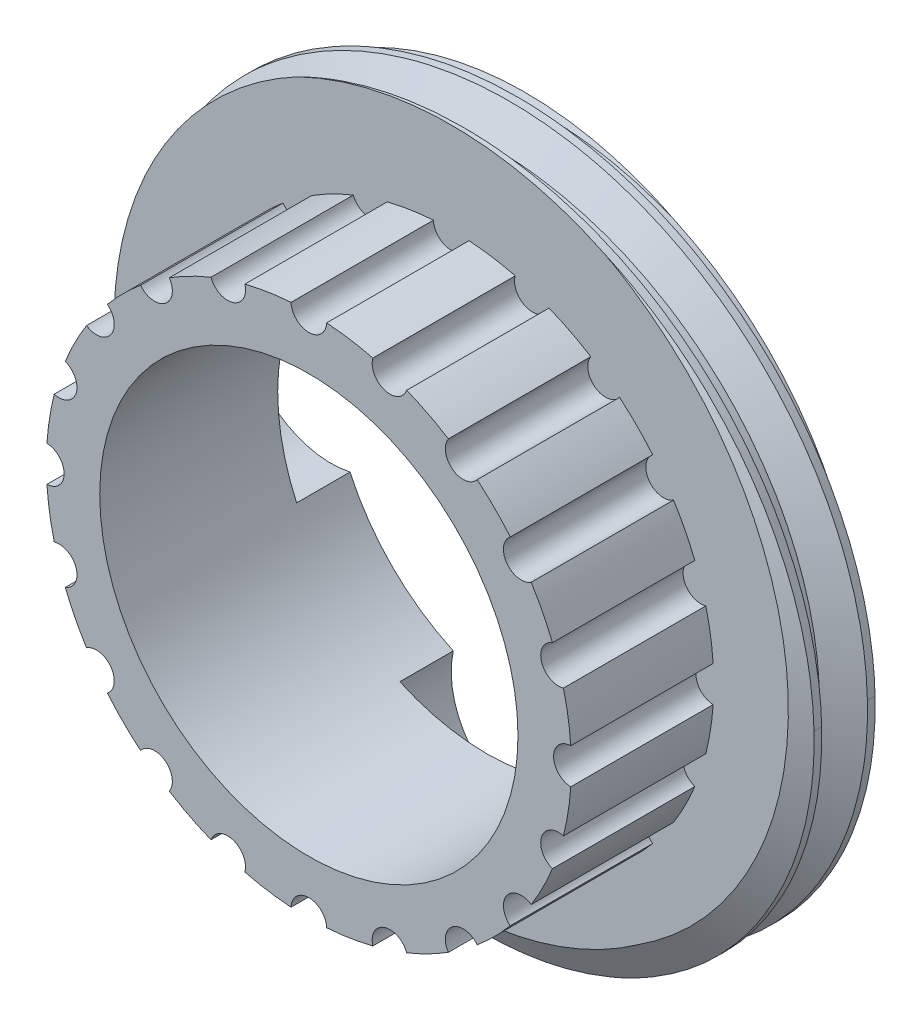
ISO-10303-21;
HEADER;
FILE_DESCRIPTION(('STEP AP214'),'2;1');
FILE_NAME('part.step','',(''),(''),'','','');
FILE_SCHEMA(('AUTOMOTIVE_DESIGN { 1 0 10303 214 1 1 1 1 }'));
ENDSEC;
DATA;
#1=APPLICATION_CONTEXT('core data for automotive mechanical design processes');
#2=APPLICATION_PROTOCOL_DEFINITION('international standard','automotive_design',2000,#1);
#3=PRODUCT_CONTEXT('',#1,'mechanical');
#4=PRODUCT('Part','Part','',(#3));
#5=PRODUCT_RELATED_PRODUCT_CATEGORY('part','',(#4));
#6=PRODUCT_DEFINITION_FORMATION('','',#4);
#7=PRODUCT_DEFINITION_CONTEXT('part definition',#1,'design');
#8=PRODUCT_DEFINITION('design','',#6,#7);
#9=PRODUCT_DEFINITION_SHAPE('','',#8);
#10=(LENGTH_UNIT() NAMED_UNIT(*) SI_UNIT(.MILLI.,.METRE.));
#11=(NAMED_UNIT(*) PLANE_ANGLE_UNIT() SI_UNIT($,.RADIAN.));
#12=(NAMED_UNIT(*) SI_UNIT($,.STERADIAN.) SOLID_ANGLE_UNIT());
#13=UNCERTAINTY_MEASURE_WITH_UNIT(LENGTH_MEASURE(1.E-05),#10,'distance_accuracy_value','');
#14=(GEOMETRIC_REPRESENTATION_CONTEXT(3) GLOBAL_UNCERTAINTY_ASSIGNED_CONTEXT((#13)) GLOBAL_UNIT_ASSIGNED_CONTEXT((#10,
#11,#12)) REPRESENTATION_CONTEXT('',''));
#15=CARTESIAN_POINT('',(0.,0.,0.));
#16=DIRECTION('',(0.,0.,1.));
#17=DIRECTION('',(1.,0.,0.));
#18=AXIS2_PLACEMENT_3D('',#15,#16,#17);
#19=CARTESIAN_POINT('',(0.,0.,117.76));
#20=DIRECTION('',(0.,0.,1.));
#21=DIRECTION('',(1.,0.,0.));
#22=AXIS2_PLACEMENT_3D('',#19,#20,#21);
#23=PLANE('',#22);
#24=CARTESIAN_POINT('',(0.,0.,117.76));
#25=DIRECTION('',(0.,0.,-1.));
#26=DIRECTION('',(-1.,0.,0.));
#27=AXIS2_PLACEMENT_3D('',#24,#25,#26);
#28=CIRCLE('',#27,7.375);
#29=CARTESIAN_POINT('',(7.35805084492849,-0.499712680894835,117.76));
#30=VERTEX_POINT('',#29);
#31=CARTESIAN_POINT('',(7.1523418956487,-1.79850782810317,117.76));
#32=VERTEX_POINT('',#31);
#33=EDGE_CURVE('E333',#30,#32,#28,.T.);
#34=ORIENTED_EDGE('',*,*,#33,.T.);
#35=CARTESIAN_POINT('',(7.01404179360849,-2.27900036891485,117.76));
#36=DIRECTION('',(0.,0.,-1.));
#37=DIRECTION('',(-1.,5.0407646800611E-09,0.));
#38=AXIS2_PLACEMENT_3D('',#35,#36,#37);
#39=CIRCLE('',#38,0.5);
#40=CARTESIAN_POINT('',(6.84350249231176,-2.7490177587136,117.76));
#41=VERTEX_POINT('',#40);
#42=EDGE_CURVE('E1515',#41,#32,#39,.T.);
#43=ORIENTED_EDGE('',*,*,#42,.F.);
#44=CARTESIAN_POINT('',(0.,0.,117.76));
#45=DIRECTION('',(0.,0.,-1.));
#46=DIRECTION('',(-1.,0.,0.));
#47=AXIS2_PLACEMENT_3D('',#44,#45,#46);
#48=CIRCLE('',#47,7.375);
#49=CARTESIAN_POINT('',(6.24651188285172,-3.92067778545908,117.76));
#50=VERTEX_POINT('',#49);
#51=EDGE_CURVE('E387',#41,#50,#48,.T.);
#52=ORIENTED_EDGE('',*,*,#51,.T.);
#53=CARTESIAN_POINT('',(5.96650030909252,-4.33491626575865,117.76));
#54=DIRECTION('',(0.,0.,-1.));
#55=DIRECTION('',(-1.,5.0407646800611E-09,0.));
#56=AXIS2_PLACEMENT_3D('',#53,#54,#55);
#57=CIRCLE('',#56,0.5);
#58=CARTESIAN_POINT('',(5.65906443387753,-4.72922982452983,117.76));
#59=VERTEX_POINT('',#58);
#60=EDGE_CURVE('E1527',#59,#50,#57,.T.);
#61=ORIENTED_EDGE('',*,*,#60,.F.);
#62=CARTESIAN_POINT('',(0.,0.,117.76));
#63=DIRECTION('',(0.,0.,-1.));
#64=DIRECTION('',(-1.,0.,0.));
#65=AXIS2_PLACEMENT_3D('',#62,#63,#64);
#66=CIRCLE('',#65,7.375);
#67=CARTESIAN_POINT('',(4.72922976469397,-5.65906448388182,117.76));
#68=VERTEX_POINT('',#67);
#69=EDGE_CURVE('E1344',#59,#68,#66,.T.);
#70=ORIENTED_EDGE('',*,*,#69,.T.);
#71=CARTESIAN_POINT('',(4.33491620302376,-5.96650035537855,117.76));
#72=DIRECTION('',(0.,0.,-1.));
#73=DIRECTION('',(-1.,5.0407646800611E-09,0.));
#74=AXIS2_PLACEMENT_3D('',#71,#72,#73);
#75=CIRCLE('',#74,0.5);
#76=CARTESIAN_POINT('',(3.92067771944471,-6.24651192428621,117.76));
#77=VERTEX_POINT('',#76);
#78=EDGE_CURVE('E1108',#77,#68,#75,.T.);
#79=ORIENTED_EDGE('',*,*,#78,.F.);
#80=CARTESIAN_POINT('',(0.,0.,117.76));
#81=DIRECTION('',(0.,0.,-1.));
#82=DIRECTION('',(-1.,0.,0.));
#83=AXIS2_PLACEMENT_3D('',#80,#81,#82);
#84=CIRCLE('',#83,7.375);
#85=CARTESIAN_POINT('',(2.74901768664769,-6.84350252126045,117.76));
#86=VERTEX_POINT('',#85);
#87=EDGE_CURVE('E959',#77,#86,#84,.T.);
#88=ORIENTED_EDGE('',*,*,#87,.T.);
#89=CARTESIAN_POINT('',(2.27900029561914,-7.01404181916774,117.76));
#90=DIRECTION('',(0.,0.,-1.));
#91=DIRECTION('',(-1.,5.0407646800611E-09,0.));
#92=AXIS2_PLACEMENT_3D('',#89,#90,#91);
#93=CIRCLE('',#92,0.5);
#94=CARTESIAN_POINT('',(1.79850775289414,-7.15234191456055,117.76));
#95=VERTEX_POINT('',#94);
#96=EDGE_CURVE('E958',#95,#86,#93,.T.);
#97=ORIENTED_EDGE('',*,*,#96,.F.);
#98=CARTESIAN_POINT('',(0.,0.,117.76));
#99=DIRECTION('',(0.,0.,-1.));
#100=DIRECTION('',(-1.,0.,0.));
#101=AXIS2_PLACEMENT_3D('',#98,#99,#100);
#102=CIRCLE('',#101,7.375);
#103=CARTESIAN_POINT('',(0.499712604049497,-7.35805085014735,117.76));
#104=VERTEX_POINT('',#103);
#105=EDGE_CURVE('E1245',#95,#104,#102,.T.);
#106=ORIENTED_EDGE('',*,*,#105,.T.);
#107=CARTESIAN_POINT('',(-3.96961586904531E-08,-7.375,117.76));
#108=DIRECTION('',(0.,0.,-1.));
#109=DIRECTION('',(-1.,5.0407646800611E-09,0.));
#110=AXIS2_PLACEMENT_3D('',#107,#108,#109);
#111=CIRCLE('',#110,0.5);
#112=CARTESIAN_POINT('',(-0.499712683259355,-7.35805084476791,117.76));
#113=VERTEX_POINT('',#112);
#114=EDGE_CURVE('E825',#113,#104,#111,.T.);
#115=ORIENTED_EDGE('',*,*,#114,.F.);
#116=CARTESIAN_POINT('',(0.,0.,117.76));
#117=DIRECTION('',(0.,0.,-1.));
#118=DIRECTION('',(-1.,0.,0.));
#119=AXIS2_PLACEMENT_3D('',#116,#117,#118);
#120=CIRCLE('',#119,7.375);
#121=CARTESIAN_POINT('',(-1.79850782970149,-7.15234189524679,117.76));
#122=VERTEX_POINT('',#121);
#123=EDGE_CURVE('E1058',#113,#122,#120,.T.);
#124=ORIENTED_EDGE('',*,*,#123,.T.);
#125=CARTESIAN_POINT('',(-2.27900037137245,-7.01404179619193,117.76));
#126=DIRECTION('',(0.,0.,-1.));
#127=DIRECTION('',(-1.,5.0407646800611E-09,0.));
#128=AXIS2_PLACEMENT_3D('',#125,#126,#127);
#129=CIRCLE('',#128,0.5);
#130=CARTESIAN_POINT('',(-2.74901776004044,-6.84350249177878,117.76));
#131=VERTEX_POINT('',#130);
#132=EDGE_CURVE('E1048',#131,#122,#129,.T.);
#133=ORIENTED_EDGE('',*,*,#132,.F.);
#134=CARTESIAN_POINT('',(0.,0.,117.76));
#135=DIRECTION('',(0.,0.,-1.));
#136=DIRECTION('',(-1.,0.,0.));
#137=AXIS2_PLACEMENT_3D('',#134,#135,#136);
#138=CIRCLE('',#137,7.375);
#139=CARTESIAN_POINT('',(-3.92067778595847,-6.24651188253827,117.76));
#140=VERTEX_POINT('',#139);
#141=EDGE_CURVE('E1047',#131,#140,#138,.T.);
#142=ORIENTED_EDGE('',*,*,#141,.T.);
#143=CARTESIAN_POINT('',(-4.33491626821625,-5.96650031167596,117.76));
#144=DIRECTION('',(0.,0.,-1.));
#145=DIRECTION('',(-1.,5.0407646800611E-09,0.));
#146=AXIS2_PLACEMENT_3D('',#143,#144,#145);
#147=CIRCLE('',#146,0.5);
#148=CARTESIAN_POINT('',(-4.72922982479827,-5.65906443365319,117.76));
#149=VERTEX_POINT('',#148);
#150=EDGE_CURVE('E1350',#149,#140,#147,.T.);
#151=ORIENTED_EDGE('',*,*,#150,.F.);
#152=CARTESIAN_POINT('',(0.,0.,117.76));
#153=DIRECTION('',(0.,0.,-1.));
#154=DIRECTION('',(-1.,0.,0.));
#155=AXIS2_PLACEMENT_3D('',#152,#153,#154);
#156=CIRCLE('',#155,7.375);
#157=CARTESIAN_POINT('',(-5.65906448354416,-4.72922976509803,117.76));
#158=VERTEX_POINT('',#157);
#159=EDGE_CURVE('E1001',#149,#158,#156,.T.);
#160=ORIENTED_EDGE('',*,*,#159,.T.);
#161=CARTESIAN_POINT('',(-5.96650035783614,-4.3349162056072,117.76));
#162=DIRECTION('',(0.,0.,-1.));
#163=DIRECTION('',(-1.,5.0407646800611E-09,0.));
#164=AXIS2_PLACEMENT_3D('',#161,#162,#163);
#165=CIRCLE('',#164,0.5);
#166=CARTESIAN_POINT('',(-6.24651192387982,-3.92067772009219,117.76));
#167=VERTEX_POINT('',#166);
#168=EDGE_CURVE('E1168',#167,#158,#165,.T.);
#169=ORIENTED_EDGE('',*,*,#168,.F.);
#170=CARTESIAN_POINT('',(0.,0.,117.76));
#171=DIRECTION('',(0.,0.,-1.));
#172=DIRECTION('',(-1.,0.,0.));
#173=AXIS2_PLACEMENT_3D('',#170,#171,#172);
#174=CIRCLE('',#173,7.375);
#175=CARTESIAN_POINT('',(-6.84350252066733,-2.74901768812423,117.76));
#176=VERTEX_POINT('',#175);
#177=EDGE_CURVE('E1444',#167,#176,#174,.T.);
#178=ORIENTED_EDGE('',*,*,#177,.T.);
#179=CARTESIAN_POINT('',(-7.01404182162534,-2.27900029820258,117.76));
#180=DIRECTION('',(0.,0.,-1.));
#181=DIRECTION('',(-1.,5.0407646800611E-09,0.));
#182=AXIS2_PLACEMENT_3D('',#179,#180,#181);
#183=CIRCLE('',#182,0.5);
#184=CARTESIAN_POINT('',(-7.15234191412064,-1.79850775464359,117.76));
#185=VERTEX_POINT('',#184);
#186=EDGE_CURVE('E1455',#185,#176,#183,.T.);
#187=ORIENTED_EDGE('',*,*,#186,.F.);
#188=CARTESIAN_POINT('',(0.,0.,117.76));
#189=DIRECTION('',(0.,0.,-1.));
#190=DIRECTION('',(-1.,0.,0.));
#191=AXIS2_PLACEMENT_3D('',#188,#189,#190);
#192=CIRCLE('',#191,7.375);
#193=CARTESIAN_POINT('',(-7.35805084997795,-0.499712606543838,117.76));
#194=VERTEX_POINT('',#193);
#195=EDGE_CURVE('E1175',#185,#194,#192,.T.);
#196=ORIENTED_EDGE('',*,*,#195,.T.);
#197=CARTESIAN_POINT('',(-7.3750000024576,3.71127157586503E-08,117.76));
#198=DIRECTION('',(0.,0.,-1.));
#199=DIRECTION('',(-1.,5.0407646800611E-09,0.));
#200=AXIS2_PLACEMENT_3D('',#197,#198,#199);
#201=CIRCLE('',#200,0.5);
#202=CARTESIAN_POINT('',(-7.35805084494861,0.499712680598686,117.76));
#203=VERTEX_POINT('',#202);
#204=EDGE_CURVE('E1209',#203,#194,#201,.T.);
#205=ORIENTED_EDGE('',*,*,#204,.F.);
#206=CARTESIAN_POINT('',(0.,0.,117.76));
#207=DIRECTION('',(0.,0.,-1.));
#208=DIRECTION('',(-1.,0.,0.));
#209=AXIS2_PLACEMENT_3D('',#206,#207,#208);
#210=CIRCLE('',#209,7.375);
#211=CARTESIAN_POINT('',(-7.15234189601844,1.79850782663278,117.76));
#212=VERTEX_POINT('',#211);
#213=EDGE_CURVE('E1208',#203,#212,#210,.T.);
#214=ORIENTED_EDGE('',*,*,#213,.T.);
#215=CARTESIAN_POINT('',(-7.01404179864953,2.279000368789,117.76));
#216=DIRECTION('',(0.,0.,-1.));
#217=DIRECTION('',(-1.,5.0407646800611E-09,0.));
#218=AXIS2_PLACEMENT_3D('',#215,#216,#217);
#219=CIRCLE('',#218,0.5);
#220=CARTESIAN_POINT('',(-6.84350249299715,2.74901775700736,117.76));
#221=VERTEX_POINT('',#220);
#222=EDGE_CURVE('E1291',#221,#212,#219,.T.);
#223=ORIENTED_EDGE('',*,*,#222,.F.);
#224=CARTESIAN_POINT('',(0.,0.,117.76));
#225=DIRECTION('',(0.,0.,-1.));
#226=DIRECTION('',(-1.,0.,0.));
#227=AXIS2_PLACEMENT_3D('',#224,#225,#226);
#228=CIRCLE('',#227,7.375);
#229=CARTESIAN_POINT('',(-6.24651188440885,3.92067778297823,117.76));
#230=VERTEX_POINT('',#229);
#231=EDGE_CURVE('E822',#221,#230,#228,.T.);
#232=ORIENTED_EDGE('',*,*,#231,.T.);
#233=CARTESIAN_POINT('',(-5.96650031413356,4.3349162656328,117.76));
#234=DIRECTION('',(0.,0.,-1.));
#235=DIRECTION('',(-1.,5.0407646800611E-09,0.));
#236=AXIS2_PLACEMENT_3D('',#233,#234,#235);
#237=CIRCLE('',#236,0.5);
#238=CARTESIAN_POINT('',(-5.65906443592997,4.72922982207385,117.76));
#239=VERTEX_POINT('',#238);
#240=EDGE_CURVE('E1338',#239,#230,#237,.T.);
#241=ORIENTED_EDGE('',*,*,#240,.F.);
#242=CARTESIAN_POINT('',(0.,0.,117.76));
#243=DIRECTION('',(0.,0.,-1.));
#244=DIRECTION('',(-1.,0.,0.));
#245=AXIS2_PLACEMENT_3D('',#242,#243,#244);
#246=CIRCLE('',#245,7.375);
#247=CARTESIAN_POINT('',(-4.72922976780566,5.65906448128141,117.76));
#248=VERTEX_POINT('',#247);
#249=EDGE_CURVE('E394',#239,#248,#246,.T.);
#250=ORIENTED_EDGE('',*,*,#249,.T.);
#251=CARTESIAN_POINT('',(-4.3349162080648,5.9665003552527,117.76));
#252=DIRECTION('',(0.,0.,-1.));
#253=DIRECTION('',(-1.,5.0407646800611E-09,0.));
#254=AXIS2_PLACEMENT_3D('',#251,#252,#253);
#255=CIRCLE('',#254,0.5);
#256=CARTESIAN_POINT('',(-3.92067772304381,6.24651192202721,117.76));
#257=VERTEX_POINT('',#256);
#258=EDGE_CURVE('E913',#257,#248,#255,.T.);
#259=ORIENTED_EDGE('',*,*,#258,.F.);
#260=CARTESIAN_POINT('',(0.,0.,117.76));
#261=DIRECTION('',(0.,0.,-1.));
#262=DIRECTION('',(-1.,0.,0.));
#263=AXIS2_PLACEMENT_3D('',#260,#261,#262);
#264=CIRCLE('',#263,7.375);
#265=CARTESIAN_POINT('',(-2.74901769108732,6.84350251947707,117.76));
#266=VERTEX_POINT('',#265);
#267=EDGE_CURVE('E397',#257,#266,#264,.T.);
#268=ORIENTED_EDGE('',*,*,#267,.T.);
#269=CARTESIAN_POINT('',(-2.27900030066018,7.01404181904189,117.76));
#270=DIRECTION('',(0.,0.,-1.));
#271=DIRECTION('',(-1.,5.0407646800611E-09,0.));
#272=AXIS2_PLACEMENT_3D('',#269,#270,#271);
#273=CIRCLE('',#272,0.5);
#274=CARTESIAN_POINT('',(-1.79850775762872,7.15234191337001,117.76));
#275=VERTEX_POINT('',#274);
#276=EDGE_CURVE('E328',#275,#266,#273,.T.);
#277=ORIENTED_EDGE('',*,*,#276,.F.);
#278=CARTESIAN_POINT('',(0.,0.,117.76));
#279=DIRECTION('',(0.,0.,-1.));
#280=DIRECTION('',(-1.,0.,0.));
#281=AXIS2_PLACEMENT_3D('',#278,#279,#280);
#282=CIRCLE('',#281,7.375);
#283=CARTESIAN_POINT('',(-0.499712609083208,7.35805084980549,117.76));
#284=VERTEX_POINT('',#283);
#285=EDGE_CURVE('E320',#275,#284,#282,.T.);
#286=ORIENTED_EDGE('',*,*,#285,.T.);
#287=CARTESIAN_POINT('',(3.46551212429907E-08,7.37499999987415,117.76));
#288=DIRECTION('',(0.,0.,-1.));
#289=DIRECTION('',(-1.,5.0407646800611E-09,0.));
#290=AXIS2_PLACEMENT_3D('',#287,#288,#289);
#291=CIRCLE('',#290,0.5);
#292=CARTESIAN_POINT('',(0.499712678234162,7.35805084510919,117.76));
#293=VERTEX_POINT('',#292);
#294=EDGE_CURVE('E325',#293,#284,#291,.T.);
#295=ORIENTED_EDGE('',*,*,#294,.F.);
#296=CARTESIAN_POINT('',(0.,0.,117.76));
#297=DIRECTION('',(0.,0.,-1.));
#298=DIRECTION('',(-1.,0.,0.));
#299=AXIS2_PLACEMENT_3D('',#296,#297,#298);
#300=CIRCLE('',#299,7.375);
#301=CARTESIAN_POINT('',(1.79850782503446,7.15234189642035,117.76));
#302=VERTEX_POINT('',#301);
#303=EDGE_CURVE('E380',#293,#302,#300,.T.);
#304=ORIENTED_EDGE('',*,*,#303,.T.);
#305=CARTESIAN_POINT('',(2.27900036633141,7.01404179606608,117.76));
#306=DIRECTION('',(0.,0.,-1.));
#307=DIRECTION('',(-1.,5.0407646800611E-09,0.));
#308=AXIS2_PLACEMENT_3D('',#305,#306,#307);
#309=CIRCLE('',#308,0.5);
#310=CARTESIAN_POINT('',(2.74901775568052,6.84350249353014,117.76));
#311=VERTEX_POINT('',#310);
#312=EDGE_CURVE('E1381',#311,#302,#309,.T.);
#313=ORIENTED_EDGE('',*,*,#312,.F.);
#314=CARTESIAN_POINT('',(0.,0.,117.76));
#315=DIRECTION('',(0.,0.,-1.));
#316=DIRECTION('',(-1.,0.,0.));
#317=AXIS2_PLACEMENT_3D('',#314,#315,#316);
#318=CIRCLE('',#317,7.375);
#319=CARTESIAN_POINT('',(3.92067778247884,6.24651188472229,117.76));
#320=VERTEX_POINT('',#319);
#321=EDGE_CURVE('E334',#311,#320,#318,.T.);
#322=ORIENTED_EDGE('',*,*,#321,.T.);
#323=CARTESIAN_POINT('',(4.33491626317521,5.96650031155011,117.76));
#324=DIRECTION('',(0.,0.,-1.));
#325=DIRECTION('',(-1.,5.0407646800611E-09,0.));
#326=AXIS2_PLACEMENT_3D('',#323,#324,#325);
#327=CIRCLE('',#326,0.5);
#328=CARTESIAN_POINT('',(4.72922982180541,5.6590644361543,117.76));
#329=VERTEX_POINT('',#328);
#330=EDGE_CURVE('E1545',#329,#320,#327,.T.);
#331=ORIENTED_EDGE('',*,*,#330,.F.);
#332=CARTESIAN_POINT('',(0.,0.,117.76));
#333=DIRECTION('',(0.,0.,-1.));
#334=DIRECTION('',(-1.,0.,0.));
#335=AXIS2_PLACEMENT_3D('',#332,#333,#334);
#336=CIRCLE('',#335,7.375);
#337=CARTESIAN_POINT('',(5.65906448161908,4.72922976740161,117.76));
#338=VERTEX_POINT('',#337);
#339=EDGE_CURVE('E383',#329,#338,#336,.T.);
#340=ORIENTED_EDGE('',*,*,#339,.T.);
#341=CARTESIAN_POINT('',(5.96650035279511,4.33491620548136,117.76));
#342=DIRECTION('',(0.,0.,-1.));
#343=DIRECTION('',(-1.,5.0407646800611E-09,0.));
#344=AXIS2_PLACEMENT_3D('',#341,#342,#343);
#345=CIRCLE('',#344,0.5);
#346=CARTESIAN_POINT('',(6.2465119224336,3.92067772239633,117.76));
#347=VERTEX_POINT('',#346);
#348=EDGE_CURVE('E360',#347,#338,#345,.T.);
#349=ORIENTED_EDGE('',*,*,#348,.F.);
#350=CARTESIAN_POINT('',(0.,0.,117.76));
#351=DIRECTION('',(0.,0.,-1.));
#352=DIRECTION('',(-1.,0.,0.));
#353=AXIS2_PLACEMENT_3D('',#350,#351,#352);
#354=CIRCLE('',#353,7.375);
#355=CARTESIAN_POINT('',(6.84350252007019,2.74901768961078,117.76));
#356=VERTEX_POINT('',#355);
#357=EDGE_CURVE('E377',#347,#356,#354,.T.);
#358=ORIENTED_EDGE('',*,*,#357,.T.);
#359=CARTESIAN_POINT('',(7.0140418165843,2.27900029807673,117.76));
#360=DIRECTION('',(0.,0.,-1.));
#361=DIRECTION('',(-1.,5.0407646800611E-09,0.));
#362=AXIS2_PLACEMENT_3D('',#359,#360,#361);
#363=CIRCLE('',#362,0.5);
#364=CARTESIAN_POINT('',(7.15234191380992,1.79850775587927,117.76));
#365=VERTEX_POINT('',#364);
#366=EDGE_CURVE('E365',#365,#356,#363,.T.);
#367=ORIENTED_EDGE('',*,*,#366,.F.);
#368=CARTESIAN_POINT('',(0.,0.,117.76));
#369=DIRECTION('',(0.,0.,-1.));
#370=DIRECTION('',(-1.,0.,0.));
#371=AXIS2_PLACEMENT_3D('',#368,#369,#370);
#372=CIRCLE('',#371,7.375);
#373=CARTESIAN_POINT('',(7.35805084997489,0.499712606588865,117.76));
#374=VERTEX_POINT('',#373);
#375=EDGE_CURVE('E374',#365,#374,#372,.T.);
#376=ORIENTED_EDGE('',*,*,#375,.T.);
#377=CARTESIAN_POINT('',(7.37499999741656,-3.72385665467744E-08,117.76));
#378=DIRECTION('',(0.,0.,-1.));
#379=DIRECTION('',(-1.,5.0407646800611E-09,0.));
#380=AXIS2_PLACEMENT_3D('',#377,#378,#379);
#381=CIRCLE('',#380,0.5);
#382=EDGE_CURVE('E1027',#30,#374,#381,.T.);
#383=ORIENTED_EDGE('',*,*,#382,.F.);
#384=EDGE_LOOP('',(#34,#43,#52,#61,#70,#79,#88,#97,#106,#115,#124,#133,#142,#151,#160,#169,#178,
#187,#196,#205,#214,#223,#232,#241,#250,#259,#268,#277,#286,#295,#304,#313,#322,#331,#340,#349,
#358,#367,#376,#383));
#385=FACE_BOUND('',#384,.T.);
#386=CARTESIAN_POINT('',(5.26291289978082,-7.38481796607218,117.76));
#387=CARTESIAN_POINT('',(5.45872038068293,-7.25854699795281,117.76));
#388=CARTESIAN_POINT('',(5.64931104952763,-7.12500405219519,117.76));
#389=CARTESIAN_POINT('',(5.8342623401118,-6.98450359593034,117.76));
#390=CARTESIAN_POINT('',(5.99147767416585,-6.86507309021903,117.76));
#391=CARTESIAN_POINT('',(6.14461828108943,-6.74061435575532,117.76));
#392=CARTESIAN_POINT('',(6.2934151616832,-6.61129250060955,117.76));
#393=CARTESIAN_POINT('',(6.4675309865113,-6.45996552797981,117.76));
#394=CARTESIAN_POINT('',(6.63570024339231,-6.30198053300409,117.76));
#395=CARTESIAN_POINT('',(6.79768832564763,-6.13779157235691,117.76));
#396=CARTESIAN_POINT('',(6.96074133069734,-5.97252322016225,117.76));
#397=CARTESIAN_POINT('',(7.11753206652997,-5.80096859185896,117.76));
#398=CARTESIAN_POINT('',(7.26778742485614,-5.62355010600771,117.76));
#399=CARTESIAN_POINT('',(7.41791213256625,-5.44628588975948,117.76));
#400=CARTESIAN_POINT('',(7.56151324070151,-5.2631674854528,117.76));
#401=CARTESIAN_POINT('',(7.69827827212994,-5.07458331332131,117.76));
#402=CARTESIAN_POINT('',(7.7235602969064,-5.03972213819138,117.76));
#403=CARTESIAN_POINT('',(7.74860859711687,-5.00467410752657,117.76));
#404=CARTESIAN_POINT('',(7.77342103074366,-4.96944157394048,117.76));
#405=CARTESIAN_POINT('',(7.79404095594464,-4.9401622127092,117.76));
#406=CARTESIAN_POINT('',(7.81450079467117,-4.91075123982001,117.76));
#407=CARTESIAN_POINT('',(7.83478208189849,-4.88123534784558,117.76));
#408=CARTESIAN_POINT('',(7.96784687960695,-4.68758263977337,117.76));
#409=CARTESIAN_POINT('',(8.09335816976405,-4.48923691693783,117.76));
#410=CARTESIAN_POINT('',(8.21109630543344,-4.28667884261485,117.76));
#411=CARTESIAN_POINT('',(8.33091738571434,-4.08053724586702,117.76));
#412=CARTESIAN_POINT('',(8.4426883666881,-3.87003248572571,117.76));
#413=CARTESIAN_POINT('',(8.54614070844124,-3.65563071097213,117.76));
#414=CARTESIAN_POINT('',(8.64959305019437,-3.44122893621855,117.76));
#415=CARTESIAN_POINT('',(8.74472718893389,-3.22292957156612,117.76));
#416=CARTESIAN_POINT('',(8.83123079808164,-3.00116655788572,117.76));
#417=CARTESIAN_POINT('',(8.91663676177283,-2.78221749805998,117.76));
#418=CARTESIAN_POINT('',(8.99363005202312,-2.55989149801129,117.76));
#419=CARTESIAN_POINT('',(9.06216783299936,-2.33468712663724,117.76));
#420=CARTESIAN_POINT('',(9.10881495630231,-2.18141201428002,117.76));
#421=CARTESIAN_POINT('',(9.15154429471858,-2.02680311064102,117.76));
#422=CARTESIAN_POINT('',(9.19032905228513,-1.87101392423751,117.76));
#423=CARTESIAN_POINT('',(9.20168312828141,-1.82540728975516,117.76));
#424=CARTESIAN_POINT('',(9.21269908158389,-1.77969949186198,117.76));
#425=CARTESIAN_POINT('',(9.22337606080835,-1.73389435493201,117.76));
#426=CARTESIAN_POINT('',(9.23142376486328,-1.69936902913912,117.76));
#427=CARTESIAN_POINT('',(9.23927888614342,-1.66478840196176,117.76));
#428=CARTESIAN_POINT('',(9.24694102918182,-1.63015410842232,117.76));
#429=CARTESIAN_POINT('',(9.25241300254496,-1.60541978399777,117.76));
#430=CARTESIAN_POINT('',(9.25778447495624,-1.58066747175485,117.76));
#431=CARTESIAN_POINT('',(9.26305539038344,-1.55589845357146,117.76));
#432=CARTESIAN_POINT('',(9.31215597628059,-1.32516560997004,117.76));
#433=CARTESIAN_POINT('',(9.35253823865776,-1.09296760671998,117.76));
#434=CARTESIAN_POINT('',(9.38424187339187,-0.859828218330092,117.76));
#435=CARTESIAN_POINT('',(9.41640428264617,-0.623315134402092,117.76));
#436=CARTESIAN_POINT('',(9.439635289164,-0.385832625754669,117.76));
#437=CARTESIAN_POINT('',(9.45392786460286,-0.147905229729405,117.76));
#438=CARTESIAN_POINT('',(9.46824015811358,0.0903504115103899,117.76));
#439=CARTESIAN_POINT('',(9.47358946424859,0.329052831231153,117.76));
#440=CARTESIAN_POINT('',(9.46991807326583,0.567687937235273,117.76));
#441=CARTESIAN_POINT('',(9.46627552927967,0.804448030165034,117.76));
#442=CARTESIAN_POINT('',(9.45375354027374,1.04114251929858,117.76));
#443=CARTESIAN_POINT('',(9.43224471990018,1.27727188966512,117.76));
#444=CARTESIAN_POINT('',(9.42641316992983,1.34129214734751,117.76));
#445=CARTESIAN_POINT('',(9.41992072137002,1.40527084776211,117.76));
#446=CARTESIAN_POINT('',(9.41276457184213,1.46919797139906,117.76));
#447=CARTESIAN_POINT('',(9.40199392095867,1.56541406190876,117.76));
#448=CARTESIAN_POINT('',(9.38971985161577,1.66151333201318,117.76));
#449=CARTESIAN_POINT('',(9.37595310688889,1.75746462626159,117.76));
#450=CARTESIAN_POINT('',(9.36435422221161,1.83830639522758,117.76));
#451=CARTESIAN_POINT('',(9.35169572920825,1.91904312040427,117.76));
#452=CARTESIAN_POINT('',(9.33798330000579,1.99965596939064,117.76));
#453=CARTESIAN_POINT('',(9.33330972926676,2.02713103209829,117.76));
#454=CARTESIAN_POINT('',(9.32851351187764,2.05459265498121,117.76));
#455=CARTESIAN_POINT('',(9.32359794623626,2.08202352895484,117.76));
#456=CARTESIAN_POINT('',(9.28169082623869,2.31588246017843,117.76));
#457=CARTESIAN_POINT('',(9.23106695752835,2.54778627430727,117.76));
#458=CARTESIAN_POINT('',(9.17202056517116,2.77729081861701,117.76));
#459=CARTESIAN_POINT('',(9.11218727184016,3.00985392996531,117.76));
#460=CARTESIAN_POINT('',(9.04370537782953,3.23995398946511,117.76));
#461=CARTESIAN_POINT('',(8.96682755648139,3.46713092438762,117.76));
#462=CARTESIAN_POINT('',(8.88932316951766,3.6961593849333,117.76));
#463=CARTESIAN_POINT('',(8.80328530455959,3.92221751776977,117.76));
#464=CARTESIAN_POINT('',(8.70892066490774,4.14482665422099,117.76));
#465=CARTESIAN_POINT('',(8.61483998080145,4.36676593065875,117.76));
#466=CARTESIAN_POINT('',(8.5124823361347,4.58527756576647,117.76));
#467=CARTESIAN_POINT('',(8.40200374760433,4.79987052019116,117.76));
#468=CARTESIAN_POINT('',(8.3145621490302,4.96971656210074,117.76));
#469=CARTESIAN_POINT('',(8.22203227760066,5.13710757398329,117.76));
#470=CARTESIAN_POINT('',(8.12447105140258,5.3017886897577,117.76));
#471=CARTESIAN_POINT('',(8.09085922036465,5.35852469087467,117.76));
#472=CARTESIAN_POINT('',(8.05665004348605,5.41493893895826,117.76));
#473=CARTESIAN_POINT('',(8.02184537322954,5.47102066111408,117.76));
#474=CARTESIAN_POINT('',(8.00349529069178,5.50058865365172,117.76));
#475=CARTESIAN_POINT('',(7.98497848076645,5.53006597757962,117.76));
#476=CARTESIAN_POINT('',(7.9663073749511,5.55943219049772,117.76));
#477=CARTESIAN_POINT('',(7.91760114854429,5.63603811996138,117.76));
#478=CARTESIAN_POINT('',(7.86782774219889,5.71191613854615,117.76));
#479=CARTESIAN_POINT('',(7.81699880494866,5.7870418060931,117.76));
#480=CARTESIAN_POINT('',(7.68144923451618,5.98738540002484,117.76));
#481=CARTESIAN_POINT('',(7.53839654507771,6.18238012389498,117.76));
#482=CARTESIAN_POINT('',(7.38828570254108,6.37174642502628,117.76));
#483=CARTESIAN_POINT('',(7.23680790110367,6.562837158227,117.76));
#484=CARTESIAN_POINT('',(7.07814242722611,6.74819697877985,117.76));
#485=CARTESIAN_POINT('',(6.91270019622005,6.92751227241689,117.76));
#486=CARTESIAN_POINT('',(6.81988196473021,7.02811372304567,117.76));
#487=CARTESIAN_POINT('',(6.72492991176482,7.12681211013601,117.76));
#488=CARTESIAN_POINT('',(6.62791101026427,7.22354758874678,117.76));
#489=CARTESIAN_POINT('',(6.57129636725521,7.27999684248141,117.76));
#490=CARTESIAN_POINT('',(6.51397784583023,7.33577761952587,117.76));
#491=CARTESIAN_POINT('',(6.45596818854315,7.39087745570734,117.76));
#492=CARTESIAN_POINT('',(6.43252169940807,7.41314784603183,117.76));
#493=CARTESIAN_POINT('',(6.40896061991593,7.43530855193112,117.76));
#494=CARTESIAN_POINT('',(6.38529125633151,7.45735363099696,117.76));
#495=CARTESIAN_POINT('',(6.20487483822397,7.62538916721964,117.76));
#496=CARTESIAN_POINT('',(6.01839249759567,7.78650447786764,117.76));
#497=CARTESIAN_POINT('',(5.82628464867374,7.94040000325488,117.76));
#498=CARTESIAN_POINT('',(5.63368295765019,8.09469114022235,117.76));
#499=CARTESIAN_POINT('',(5.43542633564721,8.24172579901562,117.76));
#500=CARTESIAN_POINT('',(5.23191811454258,8.3811688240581,117.76));
#501=CARTESIAN_POINT('',(5.02971655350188,8.51971653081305,117.76));
#502=CARTESIAN_POINT('',(4.82233011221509,8.65077019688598,117.76));
#503=CARTESIAN_POINT('',(4.61012178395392,8.77396167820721,117.76));
#504=CARTESIAN_POINT('',(4.51656240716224,8.82827490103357,117.76));
#505=CARTESIAN_POINT('',(4.42206537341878,8.88105932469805,117.76));
#506=CARTESIAN_POINT('',(4.32666014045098,8.93228061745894,117.76));
#507=(BOUNDED_CURVE() B_SPLINE_CURVE(3,(#386,#387,#388,#389,#390,#391,#392,#393,#394,#395,#396,
#397,#398,#399,#400,#401,#402,#403,#404,#405,#406,#407,#408,#409,#410,#411,#412,#413,#414,#415,
#416,#417,#418,#419,#420,#421,#422,#423,#424,#425,#426,#427,#428,#429,#430,#431,#432,#433,#434,
#435,#436,#437,#438,#439,#440,#441,#442,#443,#444,#445,#446,#447,#448,#449,#450,#451,#452,#453,
#454,#455,#456,#457,#458,#459,#460,#461,#462,#463,#464,#465,#466,#467,#468,#469,#470,#471,#472,
#473,#474,#475,#476,#477,#478,#479,#480,#481,#482,#483,#484,#485,#486,#487,#488,#489,#490,#491,
#492,#493,#494,#495,#496,#497,#498,#499,#500,#501,#502,#503,#504,#505,#506),.UNSPECIFIED.,.F.,
.F.) B_SPLINE_CURVE_WITH_KNOTS((4,3,3,3,3,3,3,3,3,3,3,3,3,3,3,3,3,3,3,3,3,3,3,3,3,3,3,3,3,3,3,3,
3,3,3,3,3,3,3,3,4),(0.,0.0698902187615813,0.12929945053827,0.198817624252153,0.268792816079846,
0.338707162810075,0.351631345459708,0.362371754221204,0.432839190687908,0.50455329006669,
0.576267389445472,0.647071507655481,0.69526111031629,0.709368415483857,0.72000170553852,
0.727595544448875,0.798335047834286,0.870098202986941,0.941960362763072,1.01325788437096,
1.03258832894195,1.0616823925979,1.08619499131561,1.09454955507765,1.1657754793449,
1.23795061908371,1.31071399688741,1.38325842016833,1.44067588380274,1.46045737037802,
1.47088677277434,1.49809334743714,1.570647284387,1.64386192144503,1.68493760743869,
1.70890701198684,1.71859502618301,1.79244056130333,1.86647592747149,1.9400359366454,
1.97246740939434),
.UNSPECIFIED.) CURVE() GEOMETRIC_REPRESENTATION_ITEM() RATIONAL_B_SPLINE_CURVE((1.,1.,1.,1.,1.,
1.,1.,1.,1.,1.,1.,1.,1.,1.,1.,1.,1.,1.,1.,1.,1.,1.,1.,1.,1.,1.,1.,1.,1.,1.,1.,1.,1.,1.,1.,1.,1.,
1.,1.,1.,1.,1.,1.,1.,1.,1.,1.,1.,1.,1.,1.,1.,1.,1.,1.,1.,1.,1.,1.,1.,1.,1.,1.,1.,1.,1.,1.,1.,1.,
1.,1.,1.,1.,1.,1.,1.,1.,1.,1.,1.,1.,1.,1.,1.,1.,1.,1.,1.,1.,1.,1.,1.,1.,1.,1.,1.,1.,1.,1.,1.,1.,
1.,1.,1.,1.,1.,1.,1.,1.,1.,1.,1.,1.,1.,1.,1.,1.,1.,1.,1.,1.)) REPRESENTATION_ITEM(''));
#508=CARTESIAN_POINT('',(5.26288812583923,-7.38509991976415,117.76));
#509=VERTEX_POINT('',#508);
#510=CARTESIAN_POINT('',(4.32666014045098,8.93228061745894,117.76));
#511=VERTEX_POINT('',#510);
#512=EDGE_CURVE('E746',#509,#511,#507,.T.);
#513=ORIENTED_EDGE('',*,*,#512,.T.);
#514=CARTESIAN_POINT('',(0.,0.,117.76));
#515=DIRECTION('',(0.,0.,1.));
#516=DIRECTION('',(-1.,0.,0.));
#517=AXIS2_PLACEMENT_3D('',#514,#515,#516);
#518=CIRCLE('',#517,9.925);
#519=CARTESIAN_POINT('',(-4.32666014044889,8.93228061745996,117.76));
#520=VERTEX_POINT('',#519);
#521=EDGE_CURVE('E531',#511,#520,#518,.T.);
#522=ORIENTED_EDGE('',*,*,#521,.T.);
#523=CARTESIAN_POINT('',(-4.32673850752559,8.93198108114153,117.76));
#524=CARTESIAN_POINT('',(-4.54403710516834,8.81555147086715,117.76));
#525=CARTESIAN_POINT('',(-4.75658409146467,8.69129240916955,117.76));
#526=CARTESIAN_POINT('',(-4.96392723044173,8.55942464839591,117.76));
#527=CARTESIAN_POINT('',(-5.15089413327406,8.44051593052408,117.76));
#528=CARTESIAN_POINT('',(-5.33362981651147,8.31541970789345,117.76));
#529=CARTESIAN_POINT('',(-5.51178511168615,8.184266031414,117.76));
#530=CARTESIAN_POINT('',(-5.7095195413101,8.03869866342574,117.76));
#531=CARTESIAN_POINT('',(-5.90161244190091,7.88566954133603,117.76));
#532=CARTESIAN_POINT('',(-6.08773897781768,7.72559115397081,117.76));
#533=CARTESIAN_POINT('',(-6.27384249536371,7.56553256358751,117.76));
#534=CARTESIAN_POINT('',(-6.45398153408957,7.39842591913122,117.76));
#535=CARTESIAN_POINT('',(-6.62779178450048,7.22464989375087,117.76));
#536=CARTESIAN_POINT('',(-6.80028540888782,7.05219023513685,117.76));
#537=CARTESIAN_POINT('',(-6.96654611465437,6.87316131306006,117.76));
#538=CARTESIAN_POINT('',(-7.12617321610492,6.68790816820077,117.76));
#539=CARTESIAN_POINT('',(-7.1671111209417,6.64039821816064,117.76));
#540=CARTESIAN_POINT('',(-7.20761247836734,6.59247878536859,117.76));
#541=CARTESIAN_POINT('',(-7.24767000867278,6.54415548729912,117.76));
#542=CARTESIAN_POINT('',(-7.26610631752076,6.52191489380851,117.76));
#543=CARTESIAN_POINT('',(-7.2844493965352,6.49958771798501,117.76));
#544=CARTESIAN_POINT('',(-7.30268732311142,6.47718844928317,117.76));
#545=CARTESIAN_POINT('',(-7.45642534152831,6.28837207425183,117.76));
#546=CARTESIAN_POINT('',(-7.60287970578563,6.09421446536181,117.76));
#547=CARTESIAN_POINT('',(-7.74175919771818,5.89513205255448,117.76));
#548=CARTESIAN_POINT('',(-7.88557811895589,5.68896901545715,117.76));
#549=CARTESIAN_POINT('',(-8.02127446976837,5.47752422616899,117.76));
#550=CARTESIAN_POINT('',(-8.14847818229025,5.2612244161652,117.76));
#551=CARTESIAN_POINT('',(-8.27568189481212,5.04492460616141,117.76));
#552=CARTESIAN_POINT('',(-8.39439343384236,4.82376915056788,117.76));
#553=CARTESIAN_POINT('',(-8.50418839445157,4.59815781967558,117.76));
#554=CARTESIAN_POINT('',(-8.61026283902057,4.38019156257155,117.76));
#555=CARTESIAN_POINT('',(-8.70801446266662,4.15806544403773,117.76));
#556=CARTESIAN_POINT('',(-8.79729849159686,3.93228174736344,117.76));
#557=CARTESIAN_POINT('',(-8.8569465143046,3.78144232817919,117.76));
#558=CARTESIAN_POINT('',(-8.91281425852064,3.62897019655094,117.76));
#559=CARTESIAN_POINT('',(-8.96484562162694,3.47501394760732,117.76));
#560=CARTESIAN_POINT('',(-8.99147021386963,3.39623410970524,117.76));
#561=CARTESIAN_POINT('',(-9.01709012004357,3.31706566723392,117.76));
#562=CARTESIAN_POINT('',(-9.04169674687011,3.23752856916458,117.76));
#563=CARTESIAN_POINT('',(-9.04871751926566,3.21483501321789,117.76));
#564=CARTESIAN_POINT('',(-9.05565504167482,3.19211382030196,117.76));
#565=CARTESIAN_POINT('',(-9.06250673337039,3.16937373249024,117.76));
#566=CARTESIAN_POINT('',(-9.13156771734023,2.94016714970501,117.76));
#567=CARTESIAN_POINT('',(-9.19198784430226,2.70880095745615,117.76));
#568=CARTESIAN_POINT('',(-9.24371660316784,2.47578022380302,117.76));
#569=CARTESIAN_POINT('',(-9.29571824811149,2.24153022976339,117.76));
#570=CARTESIAN_POINT('',(-9.3389367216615,2.00560753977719,117.76));
#571=CARTESIAN_POINT('',(-9.37327022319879,1.76851157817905,117.76));
#572=CARTESIAN_POINT('',(-9.40745279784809,1.5324578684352,117.76));
#573=CARTESIAN_POINT('',(-9.43282840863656,1.29524052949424,117.76));
#574=CARTESIAN_POINT('',(-9.44924528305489,1.05734868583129,117.76));
#575=CARTESIAN_POINT('',(-9.46542408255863,0.822906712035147,117.76));
#576=CARTESIAN_POINT('',(-9.4729020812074,0.587809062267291,117.76));
#577=CARTESIAN_POINT('',(-9.47148385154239,0.352529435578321,117.76));
#578=CARTESIAN_POINT('',(-9.47102752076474,0.276825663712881,117.76));
#579=CARTESIAN_POINT('',(-9.46964977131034,0.201103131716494,117.76));
#580=CARTESIAN_POINT('',(-9.46734296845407,0.125377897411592,117.76));
#581=CARTESIAN_POINT('',(-9.46447244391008,0.0311474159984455,117.76));
#582=CARTESIAN_POINT('',(-9.4601633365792,-0.0630872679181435,117.76));
#583=CARTESIAN_POINT('',(-9.45442012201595,-0.157294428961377,117.76));
#584=CARTESIAN_POINT('',(-9.45044114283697,-0.222562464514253,117.76));
#585=CARTESIAN_POINT('',(-9.44577378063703,-0.287817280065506,117.76));
#586=CARTESIAN_POINT('',(-9.44041920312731,-0.353048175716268,117.76));
#587=CARTESIAN_POINT('',(-9.4381899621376,-0.380205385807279,117.76));
#588=CARTESIAN_POINT('',(-9.43584160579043,-0.407358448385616,117.76));
#589=CARTESIAN_POINT('',(-9.43337420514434,-0.434506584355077,117.76));
#590=CARTESIAN_POINT('',(-9.43097275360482,-0.460929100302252,117.76));
#591=CARTESIAN_POINT('',(-9.42845934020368,-0.487338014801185,117.76));
#592=CARTESIAN_POINT('',(-9.42583456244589,-0.513729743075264,117.76));
#593=CARTESIAN_POINT('',(-9.40252017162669,-0.748152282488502,117.76));
#594=CARTESIAN_POINT('',(-9.37041699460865,-0.981293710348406,117.76));
#595=CARTESIAN_POINT('',(-9.32972889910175,-1.21268363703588,117.76));
#596=CARTESIAN_POINT('',(-9.28872463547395,-1.44587158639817,117.76));
#597=CARTESIAN_POINT('',(-9.2390013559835,-1.67728135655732,117.76));
#598=CARTESIAN_POINT('',(-9.18071537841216,-1.90642457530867,117.76));
#599=CARTESIAN_POINT('',(-9.12259111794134,-2.13493202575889,117.76));
#600=CARTESIAN_POINT('',(-9.05595137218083,-2.36118611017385,117.76));
#601=CARTESIAN_POINT('',(-8.98090242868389,-2.58468610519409,117.76));
#602=CARTESIAN_POINT('',(-8.90651131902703,-2.80622703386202,117.76));
#603=CARTESIAN_POINT('',(-8.82385752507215,-3.0250625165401,117.76));
#604=CARTESIAN_POINT('',(-8.73300038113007,-3.24067985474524,117.76));
#605=CARTESIAN_POINT('',(-8.66456949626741,-3.40307638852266,117.76));
#606=CARTESIAN_POINT('',(-8.59148421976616,-3.56364693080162,117.76));
#607=CARTESIAN_POINT('',(-8.51375441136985,-3.72215994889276,117.76));
#608=CARTESIAN_POINT('',(-8.48561652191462,-3.77954104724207,117.76));
#609=CARTESIAN_POINT('',(-8.45686988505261,-3.83665241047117,117.76));
#610=CARTESIAN_POINT('',(-8.42751455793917,-3.89348264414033,117.76));
#611=CARTESIAN_POINT('',(-8.41582038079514,-3.91612190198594,117.76));
#612=CARTESIAN_POINT('',(-8.40402998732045,-3.93871573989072,117.76));
#613=CARTESIAN_POINT('',(-8.39214826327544,-3.96125438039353,117.76));
#614=CARTESIAN_POINT('',(-8.35146263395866,-4.03843162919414,117.76));
#615=CARTESIAN_POINT('',(-8.30969144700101,-4.1149904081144,117.76));
#616=CARTESIAN_POINT('',(-8.2668410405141,-4.19090572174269,117.76));
#617=CARTESIAN_POINT('',(-8.15182609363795,-4.39467031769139,117.76));
#618=CARTESIAN_POINT('',(-8.02903915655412,-4.59380125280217,117.76));
#619=CARTESIAN_POINT('',(-7.89885767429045,-4.78794732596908,117.76));
#620=CARTESIAN_POINT('',(-7.76831262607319,-4.98263560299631,117.76));
#621=CARTESIAN_POINT('',(-7.63033119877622,-5.17231162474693,117.76));
#622=CARTESIAN_POINT('',(-7.48525373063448,-5.35658780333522,117.76));
#623=CARTESIAN_POINT('',(-7.4073751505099,-5.45550852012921,117.76));
#624=CARTESIAN_POINT('',(-7.3274511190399,-5.55287259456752,117.76));
#625=CARTESIAN_POINT('',(-7.24553023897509,-5.64861536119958,117.76));
#626=CARTESIAN_POINT('',(-7.19806695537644,-5.70408676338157,117.76));
#627=CARTESIAN_POINT('',(-7.14993331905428,-5.75901385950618,117.76));
#628=CARTESIAN_POINT('',(-7.10113840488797,-5.81338351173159,117.76));
#629=CARTESIAN_POINT('',(-7.07140631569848,-5.84651244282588,117.76));
#630=CARTESIAN_POINT('',(-7.04142501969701,-5.87943827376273,117.76));
#631=CARTESIAN_POINT('',(-7.01121808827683,-5.91213494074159,117.76));
#632=CARTESIAN_POINT('',(-6.85327479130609,-6.08309634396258,117.76));
#633=CARTESIAN_POINT('',(-6.68907275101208,-6.24790225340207,117.76));
#634=CARTESIAN_POINT('',(-6.51896417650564,-6.40619194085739,117.76));
#635=CARTESIAN_POINT('',(-6.34953859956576,-6.56384608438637,117.76));
#636=CARTESIAN_POINT('',(-6.17425331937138,-6.71503665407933,117.76));
#637=CARTESIAN_POINT('',(-5.99342382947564,-6.85936729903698,117.76));
#638=CARTESIAN_POINT('',(-5.81515576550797,-7.00165351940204,117.76));
#639=CARTESIAN_POINT('',(-5.63149894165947,-7.13727310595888,117.76));
#640=CARTESIAN_POINT('',(-5.44273152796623,-7.2658019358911,117.76));
#641=CARTESIAN_POINT('',(-5.38328790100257,-7.30627618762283,117.76));
#642=CARTESIAN_POINT('',(-5.32333733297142,-7.34604693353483,117.76));
#643=CARTESIAN_POINT('',(-5.26288812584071,-7.38509991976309,117.76));
#644=(BOUNDED_CURVE() B_SPLINE_CURVE(3,(#523,#524,#525,#526,#527,#528,#529,#530,#531,#532,#533,
#534,#535,#536,#537,#538,#539,#540,#541,#542,#543,#544,#545,#546,#547,#548,#549,#550,#551,#552,
#553,#554,#555,#556,#557,#558,#559,#560,#561,#562,#563,#564,#565,#566,#567,#568,#569,#570,#571,
#572,#573,#574,#575,#576,#577,#578,#579,#580,#581,#582,#583,#584,#585,#586,#587,#588,#589,#590,
#591,#592,#593,#594,#595,#596,#597,#598,#599,#600,#601,#602,#603,#604,#605,#606,#607,#608,#609,
#610,#611,#612,#613,#614,#615,#616,#617,#618,#619,#620,#621,#622,#623,#624,#625,#626,#627,#628,
#629,#630,#631,#632,#633,#634,#635,#636,#637,#638,#639,#640,#641,#642,#643),.UNSPECIFIED.,.F.,
.F.) B_SPLINE_CURVE_WITH_KNOTS((4,3,3,3,3,3,3,3,3,3,3,3,3,3,3,3,3,3,3,3,3,3,3,3,3,3,3,3,3,3,3,3,
3,3,3,3,3,3,3,3,4),(0.,0.0739553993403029,0.140642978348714,0.214659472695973,0.288666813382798,
0.3621135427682,0.380949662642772,0.389618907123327,0.462696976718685,0.538374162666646,
0.614051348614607,0.68716413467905,0.736008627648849,0.761002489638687,0.768133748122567,
0.840012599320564,0.912270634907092,0.984211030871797,1.05510815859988,1.07792007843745,
1.10630662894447,1.12597322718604,1.13416091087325,1.14212975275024,1.21291239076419,
1.28424504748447,1.35537978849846,1.42589100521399,1.4789979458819,1.4982224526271,
1.50588085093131,1.5321048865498,1.6024929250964,1.67307754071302,1.71096784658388,
1.73292071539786,1.74629720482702,1.81623899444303,1.88589996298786,1.9545741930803,
1.97619998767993),
.UNSPECIFIED.) CURVE() GEOMETRIC_REPRESENTATION_ITEM() RATIONAL_B_SPLINE_CURVE((1.,1.,1.,1.,1.,
1.,1.,1.,1.,1.,1.,1.,1.,1.,1.,1.,1.,1.,1.,1.,1.,1.,1.,1.,1.,1.,1.,1.,1.,1.,1.,1.,1.,1.,1.,1.,1.,
1.,1.,1.,1.,1.,1.,1.,1.,1.,1.,1.,1.,1.,1.,1.,1.,1.,1.,1.,1.,1.,1.,1.,1.,1.,1.,1.,1.,1.,1.,1.,1.,
1.,1.,1.,1.,1.,1.,1.,1.,1.,1.,1.,1.,1.,1.,1.,1.,1.,1.,1.,1.,1.,1.,1.,1.,1.,1.,1.,1.,1.,1.,1.,1.,
1.,1.,1.,1.,1.,1.,1.,1.,1.,1.,1.,1.,1.,1.,1.,1.,1.,1.,1.,1.)) REPRESENTATION_ITEM(''));
#645=CARTESIAN_POINT('',(-5.26288812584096,-7.38509991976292,117.76));
#646=VERTEX_POINT('',#645);
#647=EDGE_CURVE('E44',#520,#646,#644,.T.);
#648=ORIENTED_EDGE('',*,*,#647,.T.);
#649=CARTESIAN_POINT('',(0.,0.,117.76));
#650=DIRECTION('',(0.,0.,1.));
#651=DIRECTION('',(-1.,0.,0.));
#652=AXIS2_PLACEMENT_3D('',#649,#650,#651);
#653=CIRCLE('',#652,9.0685);
#654=EDGE_CURVE('E757',#646,#509,#653,.T.);
#655=ORIENTED_EDGE('',*,*,#654,.T.);
#656=EDGE_LOOP('',(#513,#522,#648,#655));
#657=FACE_BOUND('',#656,.T.);
#658=ADVANCED_FACE('F17',(#385,#657),#23,.T.);
#659=CARTESIAN_POINT('',(0.,0.,117.76));
#660=DIRECTION('',(0.,0.,-1.));
#661=DIRECTION('',(0.0362513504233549,-0.999342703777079,0.));
#662=AXIS2_PLACEMENT_3D('',#659,#660,#661);
#663=CYLINDRICAL_SURFACE('',#662,9.925);
#664=DIRECTION('',(0.,0.,1.));
#665=VECTOR('',#664,1.);
#666=CARTESIAN_POINT('',(9.925,0.,117.76));
#667=LINE('',#666,#665);
#668=CARTESIAN_POINT('',(9.92429666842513,-7.69193170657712E-06,115.777313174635));
#669=VERTEX_POINT('',#668);
#670=CARTESIAN_POINT('',(9.92456018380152,0.000174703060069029,115.992686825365));
#671=VERTEX_POINT('',#670);
#672=EDGE_CURVE('E401',#669,#671,#667,.T.);
#673=ORIENTED_EDGE('',*,*,#672,.T.);
#674=CARTESIAN_POINT('',(4.11976432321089,9.02957180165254,114.765499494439));
#675=CARTESIAN_POINT('',(2.66770100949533,9.69207925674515,114.803890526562));
#676=CARTESIAN_POINT('',(-0.560782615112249,10.3028595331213,114.880672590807));
#677=CARTESIAN_POINT('',(-5.27711770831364,8.86681470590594,114.995845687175));
#678=CARTESIAN_POINT('',(-8.78830782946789,5.40668635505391,115.111018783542));
#679=CARTESIAN_POINT('',(-10.2937343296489,0.71235851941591,115.22619187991));
#680=CARTESIAN_POINT('',(-9.44933652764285,-4.14458449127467,115.341364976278));
#681=CARTESIAN_POINT('',(-6.44804547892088,-8.05546804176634,115.456538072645));
#682=CARTESIAN_POINT('',(-1.97486388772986,-10.1275695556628,115.571711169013));
#683=CARTESIAN_POINT('',(2.94909773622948,-9.88790052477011,115.686884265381));
#684=CARTESIAN_POINT('',(7.19988874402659,-7.39116842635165,115.802057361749));
#685=CARTESIAN_POINT('',(9.80719348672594,-3.20729027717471,115.917230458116));
#686=CARTESIAN_POINT('',(10.1758589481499,1.70870047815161,116.032403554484));
#687=CARTESIAN_POINT('',(8.22172994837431,6.23465443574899,116.147576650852));
#688=CARTESIAN_POINT('',(4.39086677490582,9.33745413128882,116.26274974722));
#689=CARTESIAN_POINT('',(-0.442278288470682,10.3088384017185,116.377922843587));
#690=CARTESIAN_POINT('',(-5.17446673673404,8.92707436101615,116.493095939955));
#691=CARTESIAN_POINT('',(-8.72550446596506,5.50756995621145,116.608269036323));
#692=CARTESIAN_POINT('',(-10.2848143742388,0.830880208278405,116.72344213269));
#693=CARTESIAN_POINT('',(-9.49645803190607,-4.03547259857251,116.838615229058));
#694=CARTESIAN_POINT('',(-6.54039487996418,-7.98066333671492,116.953788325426));
#695=CARTESIAN_POINT('',(-2.09137998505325,-10.1041568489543,117.068961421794));
#696=CARTESIAN_POINT('',(2.83500673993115,-9.92120346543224,117.184134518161));
#697=CARTESIAN_POINT('',(7.11429546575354,-7.47363506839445,117.299307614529));
#698=CARTESIAN_POINT('',(9.76955311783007,-3.32000658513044,117.414480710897));
#699=CARTESIAN_POINT('',(10.1949222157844,1.59120562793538,117.529653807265));
#700=CARTESIAN_POINT('',(8.29271078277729,6.13957161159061,117.644826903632));
#701=CARTESIAN_POINT('',(5.76307786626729,8.23650183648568,117.721608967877));
#702=CARTESIAN_POINT('',(4.32666014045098,8.93228061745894,117.76));
#703=(BOUNDED_CURVE() B_SPLINE_CURVE(3,(#674,#675,#676,#677,#678,#679,#680,#681,#682,#683,#684,
#685,#686,#687,#688,#689,#690,#691,#692,#693,#694,#695,#696,#697,#698,#699,#700,#701,#702),
.UNSPECIFIED.,.F.,.F.) B_SPLINE_CURVE_WITH_KNOTS((4,1,1,1,1,1,1,1,1,1,1,1,1,1,1,1,1,1,1,1,1,1,1,
1,1,1,4),(8.30505915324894,8.78749509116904,9.26993102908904,9.75236696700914,10.2348029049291,
10.7172388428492,11.1996747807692,11.6821107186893,12.1645466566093,12.6469825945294,
13.1294185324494,13.6118544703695,14.0942904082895,14.5767263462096,15.0591622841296,
15.5415982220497,16.0240341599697,16.5064700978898,16.9889060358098,17.4713419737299,
17.9537779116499,18.43621384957,18.9186497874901,19.4010857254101,19.8835216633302,
20.3659576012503,20.8483935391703),
.UNSPECIFIED.) CURVE() GEOMETRIC_REPRESENTATION_ITEM() RATIONAL_B_SPLINE_CURVE((1.,1.,1.,1.,1.,
1.,1.,1.,1.,1.,1.,1.,1.,1.,1.,1.,1.,1.,1.,1.,1.,1.,1.,1.,1.,1.,1.,1.,1.)) REPRESENTATION_ITEM(''));
#704=CARTESIAN_POINT('',(-9.89869162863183,-0.718925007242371,115.26));
#705=VERTEX_POINT('',#704);
#706=EDGE_CURVE('E399',#671,#705,#703,.F.);
#707=ORIENTED_EDGE('',*,*,#706,.T.);
#708=CARTESIAN_POINT('',(0.,0.,115.26));
#709=DIRECTION('',(0.,0.,-1.));
#710=DIRECTION('',(-1.,0.,0.));
#711=AXIS2_PLACEMENT_3D('',#708,#709,#710);
#712=CIRCLE('',#711,9.925);
#713=CARTESIAN_POINT('',(-5.57225185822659,-8.2131379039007,115.26));
#714=VERTEX_POINT('',#713);
#715=EDGE_CURVE('E431',#714,#705,#712,.T.);
#716=ORIENTED_EDGE('',*,*,#715,.F.);
#717=CARTESIAN_POINT('',(-5.75995640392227,-8.082606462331,118.254500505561));
#718=CARTESIAN_POINT('',(-7.05973634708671,-7.15633647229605,118.216109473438));
#719=CARTESIAN_POINT('',(-9.20292883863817,-4.66577683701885,118.139327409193));
#720=CARTESIAN_POINT('',(-10.3174455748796,0.136710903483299,118.024154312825));
#721=CARTESIAN_POINT('',(-9.0764816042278,4.90755497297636,117.908981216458));
#722=CARTESIAN_POINT('',(-5.76378777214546,8.55845631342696,117.79380812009));
#723=CARTESIAN_POINT('',(-1.13535279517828,10.2556578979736,117.678635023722));
#724=CARTESIAN_POINT('',(3.75221727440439,9.61190532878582,117.563461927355));
#725=CARTESIAN_POINT('',(7.78330066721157,6.77406716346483,117.448288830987));
#726=CARTESIAN_POINT('',(10.0377220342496,2.38995673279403,117.333115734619));
#727=CARTESIAN_POINT('',(10.0008841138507,-2.53970237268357,117.217942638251));
#728=CARTESIAN_POINT('',(7.68119169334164,-6.88963364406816,117.102769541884));
#729=CARTESIAN_POINT('',(3.60815149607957,-9.66690270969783,116.987596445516));
#730=CARTESIAN_POINT('',(-1.28850416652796,-10.2375543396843,116.872423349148));
#731=CARTESIAN_POINT('',(-5.89103916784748,-8.47132933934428,116.75725025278));
#732=CARTESIAN_POINT('',(-9.14885519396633,-4.77139502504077,116.642077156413));
#733=CARTESIAN_POINT('',(-10.3183066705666,0.0176824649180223,116.526904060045));
#734=CARTESIAN_POINT('',(-9.13244783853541,4.8027236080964,116.411730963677));
#735=CARTESIAN_POINT('',(-5.86197062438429,8.49147052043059,116.29655786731));
#736=CARTESIAN_POINT('',(-1.25340724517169,10.2419103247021,116.181384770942));
#737=CARTESIAN_POINT('',(3.6412597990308,9.65447990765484,116.066211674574));
#738=CARTESIAN_POINT('',(7.70476661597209,6.86326670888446,115.951038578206));
#739=CARTESIAN_POINT('',(10.0095177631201,2.50541394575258,115.835865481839));
#740=CARTESIAN_POINT('',(10.0295057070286,-2.4243430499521,115.720692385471));
#741=CARTESIAN_POINT('',(7.75998688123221,-6.80067774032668,115.605519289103));
#742=CARTESIAN_POINT('',(3.71943683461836,-9.62466428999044,115.490346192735));
#743=CARTESIAN_POINT('',(-1.17066890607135,-10.2514831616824,115.375173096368));
#744=CARTESIAN_POINT('',(-4.25148089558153,-9.10922275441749,115.298391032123));
#745=CARTESIAN_POINT('',(-5.57225185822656,-8.21313790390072,115.26));
#746=(BOUNDED_CURVE() B_SPLINE_CURVE(3,(#717,#718,#719,#720,#721,#722,#723,#724,#725,#726,#727,
#728,#729,#730,#731,#732,#733,#734,#735,#736,#737,#738,#739,#740,#741,#742,#743,#744,#745),
.UNSPECIFIED.,.F.,.F.) B_SPLINE_CURVE_WITH_KNOTS((4,1,1,1,1,1,1,1,1,1,1,1,1,1,1,1,1,1,1,1,1,1,1,
1,1,1,4),(11.6147305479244,12.0971664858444,12.5796024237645,13.0620383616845,13.5444742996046,
14.0269102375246,14.5093461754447,14.9917821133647,15.4742180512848,15.9566539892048,
16.4390899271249,16.9215258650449,17.403961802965,17.8863977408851,18.3688336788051,
18.8512696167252,19.3337055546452,19.8161414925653,20.2985774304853,20.7810133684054,
21.2634493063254,21.7458852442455,22.2283211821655,22.7107571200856,23.1931930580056,
23.6756289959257,24.1580649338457),
.UNSPECIFIED.) CURVE() GEOMETRIC_REPRESENTATION_ITEM() RATIONAL_B_SPLINE_CURVE((1.,1.,1.,1.,1.,
1.,1.,1.,1.,1.,1.,1.,1.,1.,1.,1.,1.,1.,1.,1.,1.,1.,1.,1.,1.,1.,1.,1.,1.)) REPRESENTATION_ITEM(''));
#747=EDGE_CURVE('E31',#714,#669,#746,.F.);
#748=ORIENTED_EDGE('',*,*,#747,.T.);
#749=EDGE_LOOP('',(#673,#707,#716,#748));
#750=FACE_BOUND('',#749,.T.);
#751=ADVANCED_FACE('F19',(#750),#663,.T.);
#752=CARTESIAN_POINT('',(0.,0.,117.76));
#753=DIRECTION('',(0.,0.,-1.));
#754=DIRECTION('',(-1.,0.,0.));
#755=AXIS2_PLACEMENT_3D('',#752,#753,#754);
#756=CYLINDRICAL_SURFACE('',#755,5.875);
#757=DIRECTION('',(0.,0.,-1.));
#758=VECTOR('',#757,1.);
#759=CARTESIAN_POINT('',(5.34308505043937,-2.44275810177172,115.26));
#760=LINE('',#759,#758);
#761=CARTESIAN_POINT('',(5.34308505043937,-2.44275810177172,116.76));
#762=VERTEX_POINT('',#761);
#763=CARTESIAN_POINT('',(5.34308505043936,-2.44275810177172,115.26));
#764=VERTEX_POINT('',#763);
#765=EDGE_CURVE('E853',#762,#764,#760,.T.);
#766=ORIENTED_EDGE('',*,*,#765,.T.);
#767=CARTESIAN_POINT('',(0.,0.,115.26));
#768=DIRECTION('',(0.,0.,1.));
#769=DIRECTION('',(-1.,0.,0.));
#770=AXIS2_PLACEMENT_3D('',#767,#768,#769);
#771=CIRCLE('',#770,5.875);
#772=CARTESIAN_POINT('',(2.44275785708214,-5.34308516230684,115.26));
#773=VERTEX_POINT('',#772);
#774=EDGE_CURVE('E889',#773,#764,#771,.T.);
#775=ORIENTED_EDGE('',*,*,#774,.F.);
#776=DIRECTION('',(0.,0.,1.));
#777=VECTOR('',#776,1.);
#778=CARTESIAN_POINT('',(2.44275785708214,-5.34308516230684,115.26));
#779=LINE('',#778,#777);
#780=CARTESIAN_POINT('',(2.44275785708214,-5.34308516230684,116.76));
#781=VERTEX_POINT('',#780);
#782=EDGE_CURVE('E1069',#773,#781,#779,.T.);
#783=ORIENTED_EDGE('',*,*,#782,.T.);
#784=CARTESIAN_POINT('',(0.,0.,116.76));
#785=DIRECTION('',(0.,0.,-1.));
#786=DIRECTION('',(-1.,0.,0.));
#787=AXIS2_PLACEMENT_3D('',#784,#785,#786);
#788=CIRCLE('',#787,5.875);
#789=CARTESIAN_POINT('',(-2.44275810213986,-5.34308505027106,116.76));
#790=VERTEX_POINT('',#789);
#791=EDGE_CURVE('E722',#781,#790,#788,.T.);
#792=ORIENTED_EDGE('',*,*,#791,.T.);
#793=DIRECTION('',(0.,0.,-1.));
#794=VECTOR('',#793,1.);
#795=CARTESIAN_POINT('',(-2.44275810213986,-5.34308505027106,115.26));
#796=LINE('',#795,#794);
#797=CARTESIAN_POINT('',(-2.44275810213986,-5.34308505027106,115.26));
#798=VERTEX_POINT('',#797);
#799=EDGE_CURVE('E1033',#790,#798,#796,.T.);
#800=ORIENTED_EDGE('',*,*,#799,.T.);
#801=CARTESIAN_POINT('',(0.,0.,115.26));
#802=DIRECTION('',(0.,0.,1.));
#803=DIRECTION('',(-1.,0.,0.));
#804=AXIS2_PLACEMENT_3D('',#801,#802,#803);
#805=CIRCLE('',#804,5.875);
#806=CARTESIAN_POINT('',(-5.34308516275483,-2.44275785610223,115.26));
#807=VERTEX_POINT('',#806);
#808=EDGE_CURVE('E969',#807,#798,#805,.T.);
#809=ORIENTED_EDGE('',*,*,#808,.F.);
#810=DIRECTION('',(0.,0.,1.));
#811=VECTOR('',#810,1.);
#812=CARTESIAN_POINT('',(-5.34308516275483,-2.44275785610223,115.26));
#813=LINE('',#812,#811);
#814=CARTESIAN_POINT('',(-5.34308516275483,-2.44275785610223,116.76));
#815=VERTEX_POINT('',#814);
#816=EDGE_CURVE('E950',#807,#815,#813,.T.);
#817=ORIENTED_EDGE('',*,*,#816,.T.);
#818=CARTESIAN_POINT('',(0.,0.,116.76));
#819=DIRECTION('',(0.,0.,-1.));
#820=DIRECTION('',(-1.,0.,0.));
#821=AXIS2_PLACEMENT_3D('',#818,#819,#820);
#822=CIRCLE('',#821,5.875);
#823=CARTESIAN_POINT('',(-5.34308504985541,2.44275810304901,116.76));
#824=VERTEX_POINT('',#823);
#825=EDGE_CURVE('E980',#815,#824,#822,.T.);
#826=ORIENTED_EDGE('',*,*,#825,.T.);
#827=DIRECTION('',(0.,0.,-1.));
#828=VECTOR('',#827,1.);
#829=CARTESIAN_POINT('',(-5.34308504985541,2.44275810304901,115.26));
#830=LINE('',#829,#828);
#831=CARTESIAN_POINT('',(-5.34308504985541,2.44275810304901,115.26));
#832=VERTEX_POINT('',#831);
#833=EDGE_CURVE('E861',#824,#832,#830,.T.);
#834=ORIENTED_EDGE('',*,*,#833,.T.);
#835=CARTESIAN_POINT('',(0.,0.,115.26));
#836=DIRECTION('',(0.,0.,1.));
#837=DIRECTION('',(-1.,0.,0.));
#838=AXIS2_PLACEMENT_3D('',#835,#836,#837);
#839=CIRCLE('',#838,5.875);
#840=CARTESIAN_POINT('',(-2.44275785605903,5.34308516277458,115.26));
#841=VERTEX_POINT('',#840);
#842=EDGE_CURVE('E974',#841,#832,#839,.T.);
#843=ORIENTED_EDGE('',*,*,#842,.F.);
#844=DIRECTION('',(0.,0.,1.));
#845=VECTOR('',#844,1.);
#846=CARTESIAN_POINT('',(-2.44275785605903,5.34308516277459,115.26));
#847=LINE('',#846,#845);
#848=CARTESIAN_POINT('',(-2.44275785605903,5.34308516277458,116.76));
#849=VERTEX_POINT('',#848);
#850=EDGE_CURVE('E983',#841,#849,#847,.T.);
#851=ORIENTED_EDGE('',*,*,#850,.T.);
#852=CARTESIAN_POINT('',(0.,0.,116.76));
#853=DIRECTION('',(0.,0.,-1.));
#854=DIRECTION('',(-1.,0.,0.));
#855=AXIS2_PLACEMENT_3D('',#852,#853,#854);
#856=CIRCLE('',#855,5.875);
#857=CARTESIAN_POINT('',(2.44275810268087,5.34308505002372,116.76));
#858=VERTEX_POINT('',#857);
#859=EDGE_CURVE('E988',#849,#858,#856,.T.);
#860=ORIENTED_EDGE('',*,*,#859,.T.);
#861=DIRECTION('',(0.,0.,-1.));
#862=VECTOR('',#861,1.);
#863=CARTESIAN_POINT('',(2.44275810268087,5.34308505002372,115.26));
#864=LINE('',#863,#862);
#865=CARTESIAN_POINT('',(2.44275810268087,5.34308505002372,115.26));
#866=VERTEX_POINT('',#865);
#867=EDGE_CURVE('E998',#858,#866,#864,.T.);
#868=ORIENTED_EDGE('',*,*,#867,.T.);
#869=CARTESIAN_POINT('',(0.,0.,115.26));
#870=DIRECTION('',(0.,0.,1.));
#871=DIRECTION('',(-1.,0.,0.));
#872=AXIS2_PLACEMENT_3D('',#869,#870,#871);
#873=CIRCLE('',#872,5.875);
#874=CARTESIAN_POINT('',(5.34308516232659,2.44275785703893,115.26));
#875=VERTEX_POINT('',#874);
#876=EDGE_CURVE('E1102',#875,#866,#873,.T.);
#877=ORIENTED_EDGE('',*,*,#876,.F.);
#878=DIRECTION('',(0.,0.,1.));
#879=VECTOR('',#878,1.);
#880=CARTESIAN_POINT('',(5.34308516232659,2.44275785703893,115.26));
#881=LINE('',#880,#879);
#882=CARTESIAN_POINT('',(5.34308516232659,2.44275785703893,116.76));
#883=VERTEX_POINT('',#882);
#884=EDGE_CURVE('E880',#875,#883,#881,.T.);
#885=ORIENTED_EDGE('',*,*,#884,.T.);
#886=CARTESIAN_POINT('',(0.,0.,116.76));
#887=DIRECTION('',(0.,0.,-1.));
#888=DIRECTION('',(-1.,0.,0.));
#889=AXIS2_PLACEMENT_3D('',#886,#887,#888);
#890=CIRCLE('',#889,5.875);
#891=CARTESIAN_POINT('',(5.875,0.,116.76));
#892=VERTEX_POINT('',#891);
#893=EDGE_CURVE('E920',#883,#892,#890,.T.);
#894=ORIENTED_EDGE('',*,*,#893,.T.);
#895=DIRECTION('',(0.,0.,1.));
#896=VECTOR('',#895,1.);
#897=CARTESIAN_POINT('',(5.875,0.,117.76));
#898=LINE('',#897,#896);
#899=CARTESIAN_POINT('',(5.875,0.,121.76));
#900=VERTEX_POINT('',#899);
#901=EDGE_CURVE('E11',#892,#900,#898,.T.);
#902=ORIENTED_EDGE('',*,*,#901,.T.);
#903=CARTESIAN_POINT('',(0.,0.,121.76));
#904=DIRECTION('',(0.,0.,1.));
#905=DIRECTION('',(-1.,0.,0.));
#906=AXIS2_PLACEMENT_3D('',#903,#904,#905);
#907=CIRCLE('',#906,5.875);
#908=EDGE_CURVE('E1127',#900,#900,#907,.T.);
#909=ORIENTED_EDGE('',*,*,#908,.T.);
#910=ORIENTED_EDGE('',*,*,#901,.F.);
#911=CARTESIAN_POINT('',(0.,0.,116.76));
#912=DIRECTION('',(0.,0.,-1.));
#913=DIRECTION('',(-1.,0.,0.));
#914=AXIS2_PLACEMENT_3D('',#911,#912,#913);
#915=CIRCLE('',#914,5.875);
#916=EDGE_CURVE('E904',#892,#762,#915,.T.);
#917=ORIENTED_EDGE('',*,*,#916,.T.);
#918=EDGE_LOOP('',(#766,#775,#783,#792,#800,#809,#817,#826,#834,#843,#851,#860,#868,#877,#885,
#894,#902,#909,#910,#917));
#919=FACE_BOUND('',#918,.T.);
#920=ADVANCED_FACE('F445',(#919),#756,.F.);
#921=CARTESIAN_POINT('',(-5.75995640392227,-8.082606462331,118.254500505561));
#922=CARTESIAN_POINT('',(-7.05973634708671,-7.15633647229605,118.216109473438));
#923=CARTESIAN_POINT('',(-9.20292883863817,-4.66577683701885,118.139327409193));
#924=CARTESIAN_POINT('',(-10.3174455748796,0.136710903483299,118.024154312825));
#925=CARTESIAN_POINT('',(-9.0764816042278,4.90755497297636,117.908981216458));
#926=CARTESIAN_POINT('',(-5.76378777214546,8.55845631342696,117.79380812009));
#927=CARTESIAN_POINT('',(-1.13535279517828,10.2556578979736,117.678635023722));
#928=CARTESIAN_POINT('',(3.75221727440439,9.61190532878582,117.563461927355));
#929=CARTESIAN_POINT('',(7.78330066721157,6.77406716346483,117.448288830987));
#930=CARTESIAN_POINT('',(10.0377220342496,2.38995673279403,117.333115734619));
#931=CARTESIAN_POINT('',(10.0008841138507,-2.53970237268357,117.217942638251));
#932=CARTESIAN_POINT('',(7.68119169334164,-6.88963364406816,117.102769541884));
#933=CARTESIAN_POINT('',(3.60815149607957,-9.66690270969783,116.987596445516));
#934=CARTESIAN_POINT('',(-1.28850416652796,-10.2375543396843,116.872423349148));
#935=CARTESIAN_POINT('',(-5.89103916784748,-8.47132933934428,116.75725025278));
#936=CARTESIAN_POINT('',(-9.14885519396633,-4.77139502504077,116.642077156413));
#937=CARTESIAN_POINT('',(-10.3183066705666,0.0176824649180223,116.526904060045));
#938=CARTESIAN_POINT('',(-9.13244783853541,4.8027236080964,116.411730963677));
#939=CARTESIAN_POINT('',(-5.86197062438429,8.49147052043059,116.29655786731));
#940=CARTESIAN_POINT('',(-1.25340724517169,10.2419103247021,116.181384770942));
#941=CARTESIAN_POINT('',(3.6412597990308,9.65447990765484,116.066211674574));
#942=CARTESIAN_POINT('',(7.70476661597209,6.86326670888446,115.951038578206));
#943=CARTESIAN_POINT('',(10.0095177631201,2.50541394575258,115.835865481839));
#944=CARTESIAN_POINT('',(10.0295057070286,-2.4243430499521,115.720692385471));
#945=CARTESIAN_POINT('',(7.75998688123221,-6.80067774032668,115.605519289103));
#946=CARTESIAN_POINT('',(3.71943683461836,-9.62466428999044,115.490346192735));
#947=CARTESIAN_POINT('',(-1.17066890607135,-10.2514831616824,115.375173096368));
#948=CARTESIAN_POINT('',(-4.25148089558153,-9.10922275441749,115.298391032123));
#949=CARTESIAN_POINT('',(-5.57225185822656,-8.21313790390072,115.26));
#950=CARTESIAN_POINT('',(-5.59426697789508,-7.85010428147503,118.089667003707));
#951=CARTESIAN_POINT('',(-6.85665778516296,-6.9504791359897,118.051275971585));
#952=CARTESIAN_POINT('',(-8.93819975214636,-4.53156229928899,117.974493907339));
#953=CARTESIAN_POINT('',(-10.0206565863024,0.132778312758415,117.859320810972));
#954=CARTESIAN_POINT('',(-8.81538986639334,4.76638550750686,117.744147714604));
#955=CARTESIAN_POINT('',(-5.59798813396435,8.31226595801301,117.628974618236));
#956=CARTESIAN_POINT('',(-1.10269352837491,9.96064627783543,117.513801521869));
#957=CARTESIAN_POINT('',(3.64428195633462,9.3354117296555,117.398628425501));
#958=CARTESIAN_POINT('',(7.55940823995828,6.57920608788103,117.283455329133));
#959=CARTESIAN_POINT('',(9.74897950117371,2.32120785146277,117.168282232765));
#960=CARTESIAN_POINT('',(9.71320125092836,-2.46664594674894,117.053109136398));
#961=CARTESIAN_POINT('',(7.46023650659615,-6.69144821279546,116.93793604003));
#962=CARTESIAN_POINT('',(3.5043603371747,-9.38882707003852,116.822762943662));
#963=CARTESIAN_POINT('',(-1.25143938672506,-9.94306348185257,116.707589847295));
#964=CARTESIAN_POINT('',(-5.72157904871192,-8.22764525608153,116.592416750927));
#965=CARTESIAN_POINT('',(-8.88568157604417,-4.63414230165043,116.477243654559));
#966=CARTESIAN_POINT('',(-10.0214929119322,0.0171738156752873,116.362070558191));
#967=CARTESIAN_POINT('',(-8.86974619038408,4.66456969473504,116.246897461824));
#968=CARTESIAN_POINT('',(-5.6933466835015,8.24720706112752,116.131724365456));
#969=CARTESIAN_POINT('',(-1.21735205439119,9.94729416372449,116.016551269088));
#970=CARTESIAN_POINT('',(3.53651625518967,9.37676161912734,115.90137817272));
#971=CARTESIAN_POINT('',(7.48313327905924,6.66583974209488,115.786205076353));
#972=CARTESIAN_POINT('',(9.72158654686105,2.43334385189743,115.671031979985));
#973=CARTESIAN_POINT('',(9.7409995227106,-2.35460502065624,115.555858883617));
#974=CARTESIAN_POINT('',(7.53676509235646,-6.60505119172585,115.44068578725));
#975=CARTESIAN_POINT('',(3.6124444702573,-9.34780366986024,115.325512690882));
#976=CARTESIAN_POINT('',(-1.13699374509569,-9.95659163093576,115.210339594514));
#977=CARTESIAN_POINT('',(-4.12918388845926,-8.84718919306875,115.133557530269));
#978=CARTESIAN_POINT('',(-5.4119618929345,-7.9768808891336,115.095166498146));
#979=CARTESIAN_POINT('',(-5.4285775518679,-7.61760210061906,117.924833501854));
#980=CARTESIAN_POINT('',(-6.65357922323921,-6.74462179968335,117.886442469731));
#981=CARTESIAN_POINT('',(-8.67347066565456,-4.39734776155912,117.809660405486));
#982=CARTESIAN_POINT('',(-9.72386759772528,0.12884572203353,117.694487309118));
#983=CARTESIAN_POINT('',(-8.55429812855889,4.62521604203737,117.57931421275));
#984=CARTESIAN_POINT('',(-5.43218849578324,8.06607560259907,117.464141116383));
#985=CARTESIAN_POINT('',(-1.07003426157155,9.66563465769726,117.348968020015));
#986=CARTESIAN_POINT('',(3.53634663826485,9.05891813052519,117.233794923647));
#987=CARTESIAN_POINT('',(7.335515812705,6.38434501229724,117.118621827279));
#988=CARTESIAN_POINT('',(9.46023696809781,2.25245897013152,117.003448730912));
#989=CARTESIAN_POINT('',(9.42551838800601,-2.39358952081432,116.888275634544));
#990=CARTESIAN_POINT('',(7.23928131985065,-6.49326278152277,116.773102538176));
#991=CARTESIAN_POINT('',(3.40056917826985,-9.1107514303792,116.657929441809));
#992=CARTESIAN_POINT('',(-1.21437460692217,-9.64857262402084,116.542756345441));
#993=CARTESIAN_POINT('',(-5.55211892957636,-7.98396117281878,116.427583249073));
#994=CARTESIAN_POINT('',(-8.62250795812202,-4.49688957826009,116.312410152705));
#995=CARTESIAN_POINT('',(-9.72467915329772,0.0166651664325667,116.197237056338));
#996=CARTESIAN_POINT('',(-8.60704454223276,4.52641578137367,116.08206395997));
#997=CARTESIAN_POINT('',(-5.52472274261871,8.00294360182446,115.966890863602));
#998=CARTESIAN_POINT('',(-1.18129686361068,9.6526780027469,115.851717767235));
#999=CARTESIAN_POINT('',(3.43177271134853,9.09904333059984,115.736544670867));
#1000=CARTESIAN_POINT('',(7.2614999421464,6.46841277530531,115.621371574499));
#1001=CARTESIAN_POINT('',(9.43365533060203,2.36127375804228,115.506198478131));
#1002=CARTESIAN_POINT('',(9.45249333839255,-2.2848669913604,115.391025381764));
#1003=CARTESIAN_POINT('',(7.31354330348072,-6.40942464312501,115.275852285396));
#1004=CARTESIAN_POINT('',(3.50545210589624,-9.07094304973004,115.160679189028));
#1005=CARTESIAN_POINT('',(-1.10331858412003,-9.66170010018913,115.04550609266));
#1006=CARTESIAN_POINT('',(-4.00688688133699,-8.58515563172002,114.968724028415));
#1007=CARTESIAN_POINT('',(-5.25167192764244,-7.74062387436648,114.930332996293));
#1008=CARTESIAN_POINT('',(-5.26288812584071,-7.38509991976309,117.76));
#1009=CARTESIAN_POINT('',(-6.45050066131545,-6.538764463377,117.721608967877));
#1010=CARTESIAN_POINT('',(-8.40874157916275,-4.26313322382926,117.644826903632));
#1011=CARTESIAN_POINT('',(-9.42707860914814,0.124913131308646,117.529653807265));
#1012=CARTESIAN_POINT('',(-8.29320639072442,4.48404657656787,117.414480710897));
#1013=CARTESIAN_POINT('',(-5.26638885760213,7.81988524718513,117.299307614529));
#1014=CARTESIAN_POINT('',(-1.03737499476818,9.37062303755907,117.184134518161));
#1015=CARTESIAN_POINT('',(3.42841132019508,8.78242453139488,117.068961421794));
#1016=CARTESIAN_POINT('',(7.11162338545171,6.18948393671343,116.953788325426));
#1017=CARTESIAN_POINT('',(9.17149443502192,2.18371008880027,116.838615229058));
#1018=CARTESIAN_POINT('',(9.13783552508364,-2.32053309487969,116.72344213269));
#1019=CARTESIAN_POINT('',(7.01832613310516,-6.29507735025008,116.608269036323));
#1020=CARTESIAN_POINT('',(3.29677801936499,-8.83267579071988,116.493095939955));
#1021=CARTESIAN_POINT('',(-1.17730982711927,-9.35408176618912,116.377922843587));
#1022=CARTESIAN_POINT('',(-5.3826588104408,-7.74027708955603,116.26274974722));
#1023=CARTESIAN_POINT('',(-8.35933434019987,-4.35963685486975,116.147576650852));
#1024=CARTESIAN_POINT('',(-9.42786539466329,0.0161565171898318,116.032403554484));
#1025=CARTESIAN_POINT('',(-8.34434289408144,4.38826186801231,115.917230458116));
#1026=CARTESIAN_POINT('',(-5.35609880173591,7.75868014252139,115.802057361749));
#1027=CARTESIAN_POINT('',(-1.14524167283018,9.35806184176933,115.686884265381));
#1028=CARTESIAN_POINT('',(3.32702916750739,8.82132504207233,115.571711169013));
#1029=CARTESIAN_POINT('',(7.03986660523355,6.27098580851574,115.456538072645));
#1030=CARTESIAN_POINT('',(9.14572411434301,2.28920366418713,115.341364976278));
#1031=CARTESIAN_POINT('',(9.16398715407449,-2.21512896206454,115.22619187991));
#1032=CARTESIAN_POINT('',(7.09032151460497,-6.21379809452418,115.111018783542));
#1033=CARTESIAN_POINT('',(3.39845974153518,-8.79408242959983,114.995845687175));
#1034=CARTESIAN_POINT('',(-1.06964342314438,-9.36680856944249,114.880672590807));
#1035=CARTESIAN_POINT('',(-3.88458987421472,-8.32312207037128,114.803890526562));
#1036=CARTESIAN_POINT('',(-5.09138196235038,-7.50436685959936,114.765499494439));
#1037=(BOUNDED_SURFACE() B_SPLINE_SURFACE(3,3,((#921,#922,#923,#924,#925,#926,#927,#928,#929,
#930,#931,#932,#933,#934,#935,#936,#937,#938,#939,#940,#941,#942,#943,#944,#945,#946,#947,#948,
#949),(#950,#951,#952,#953,#954,#955,#956,#957,#958,#959,#960,#961,#962,#963,#964,#965,#966,
#967,#968,#969,#970,#971,#972,#973,#974,#975,#976,#977,#978),(#979,#980,#981,#982,#983,#984,
#985,#986,#987,#988,#989,#990,#991,#992,#993,#994,#995,#996,#997,#998,#999,#1000,#1001,#1002,
#1003,#1004,#1005,#1006,#1007),(#1008,#1009,#1010,#1011,#1012,#1013,#1014,#1015,#1016,#1017,
#1018,#1019,#1020,#1021,#1022,#1023,#1024,#1025,#1026,#1027,#1028,#1029,#1030,#1031,#1032,#1033,
#1034,#1035,#1036)),.UNSPECIFIED.,.F.,.F.,.F.) B_SPLINE_SURFACE_WITH_KNOTS((4,4),(4,1,1,1,1,1,1,
1,1,1,1,1,1,1,1,1,1,1,1,1,1,1,1,1,1,1,4),(0.,0.0989001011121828),(11.6147305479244,
12.0971664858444,12.5796024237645,13.0620383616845,13.5444742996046,14.0269102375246,
14.5093461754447,14.9917821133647,15.4742180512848,15.9566539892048,16.4390899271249,
16.9215258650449,17.403961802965,17.8863977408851,18.3688336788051,18.8512696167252,
19.3337055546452,19.8161414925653,20.2985774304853,20.7810133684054,21.2634493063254,
21.7458852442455,22.2283211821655,22.7107571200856,23.1931930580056,23.6756289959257,
24.1580649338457),.UNSPECIFIED.) GEOMETRIC_REPRESENTATION_ITEM() RATIONAL_B_SPLINE_SURFACE(((1.,
1.,1.,1.,1.,1.,1.,1.,1.,1.,1.,1.,1.,1.,1.,1.,1.,1.,1.,1.,1.,1.,1.,1.,1.,1.,1.,1.,1.),(1.,1.,1.,
1.,1.,1.,1.,1.,1.,1.,1.,1.,1.,1.,1.,1.,1.,1.,1.,1.,1.,1.,1.,1.,1.,1.,1.,1.,1.),(1.,1.,1.,1.,1.,
1.,1.,1.,1.,1.,1.,1.,1.,1.,1.,1.,1.,1.,1.,1.,1.,1.,1.,1.,1.,1.,1.,1.,1.),(1.,1.,1.,1.,1.,1.,1.,
1.,1.,1.,1.,1.,1.,1.,1.,1.,1.,1.,1.,1.,1.,1.,1.,1.,1.,1.,1.,1.,1.))) REPRESENTATION_ITEM('') SURFACE());
#1038=CARTESIAN_POINT('',(9.0268965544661,-0.865407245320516,115.26));
#1039=CARTESIAN_POINT('',(9.0154464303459,-1.09811698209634,115.26));
#1040=CARTESIAN_POINT('',(8.99509018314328,-1.32994481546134,115.26));
#1041=CARTESIAN_POINT('',(8.96588886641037,-1.56036755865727,115.26));
#1042=CARTESIAN_POINT('',(8.94106668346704,-1.75623528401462,115.26));
#1043=CARTESIAN_POINT('',(8.90985256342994,-1.95108830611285,115.26));
#1044=CARTESIAN_POINT('',(8.87225499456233,-2.14461111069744,115.26));
#1045=CARTESIAN_POINT('',(8.82825990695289,-2.37106332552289,115.26));
#1046=CARTESIAN_POINT('',(8.77552551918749,-2.59569467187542,115.26));
#1047=CARTESIAN_POINT('',(8.7143277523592,-2.81807494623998,115.26));
#1048=CARTESIAN_POINT('',(8.65272766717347,-3.04191716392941,115.26));
#1049=CARTESIAN_POINT('',(8.58255237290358,-3.26347923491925,115.26));
#1050=CARTESIAN_POINT('',(8.50403114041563,-3.48231343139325,115.26));
#1051=CARTESIAN_POINT('',(8.42557818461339,-3.70095734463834,115.26));
#1052=CARTESIAN_POINT('',(8.33879355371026,-3.91687874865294,115.26));
#1053=CARTESIAN_POINT('',(8.24385739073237,-4.12961282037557,115.26));
#1054=CARTESIAN_POINT('',(8.22630773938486,-4.16893828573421,115.26));
#1055=CARTESIAN_POINT('',(8.20847940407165,-4.20815476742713,115.26));
#1056=CARTESIAN_POINT('',(8.19037335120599,-4.24725923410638,115.26));
#1057=CARTESIAN_POINT('',(8.17532664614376,-4.27975628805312,115.26));
#1058=CARTESIAN_POINT('',(8.16008591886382,-4.31218050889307,115.26));
#1059=CARTESIAN_POINT('',(8.1446650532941,-4.34450255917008,115.26));
#1060=CARTESIAN_POINT('',(8.04348929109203,-4.55656640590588,115.26));
#1061=CARTESIAN_POINT('',(7.93447250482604,-4.76443523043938,115.26));
#1062=CARTESIAN_POINT('',(7.81792113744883,-4.96767848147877,115.26));
#1063=CARTESIAN_POINT('',(7.69930782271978,-5.17451737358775,115.26));
#1064=CARTESIAN_POINT('',(7.57289084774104,-5.37656625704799,115.26));
#1065=CARTESIAN_POINT('',(7.4389396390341,-5.57335949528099,115.26));
#1066=CARTESIAN_POINT('',(7.30498843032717,-5.770152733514,115.26));
#1067=CARTESIAN_POINT('',(7.16350270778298,-5.96169099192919,115.26));
#1068=CARTESIAN_POINT('',(7.01470211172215,-6.14748681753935,115.26));
#1069=CARTESIAN_POINT('',(6.86778964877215,-6.33092507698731,115.26));
#1070=CARTESIAN_POINT('',(6.7137463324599,-6.50876621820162,115.26));
#1071=CARTESIAN_POINT('',(6.55298251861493,-6.68072385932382,115.26));
#1072=CARTESIAN_POINT('',(6.44356593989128,-6.7977590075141,115.26));
#1073=CARTESIAN_POINT('',(6.33103537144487,-6.91206815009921,115.26));
#1074=CARTESIAN_POINT('',(6.21551035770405,-7.02355132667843,115.26));
#1075=CARTESIAN_POINT('',(6.18169089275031,-7.05618756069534,115.26));
#1076=CARTESIAN_POINT('',(6.14761475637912,-7.08858155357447,115.26));
#1077=CARTESIAN_POINT('',(6.1132848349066,-7.12073065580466,115.26));
#1078=CARTESIAN_POINT('',(6.08740889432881,-7.14496281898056,115.26));
#1079=CARTESIAN_POINT('',(6.06138877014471,-7.16905585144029,115.26));
#1080=CARTESIAN_POINT('',(6.0352256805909,-7.19300859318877,115.26));
#1081=CARTESIAN_POINT('',(6.01654109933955,-7.2101146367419,115.26));
#1082=CARTESIAN_POINT('',(5.997790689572,-7.22714263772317,115.26));
#1083=CARTESIAN_POINT('',(5.97897553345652,-7.2440919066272,115.26));
#1084=CARTESIAN_POINT('',(5.80370532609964,-7.40198067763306,115.26));
#1085=CARTESIAN_POINT('',(5.62280709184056,-7.55305173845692,115.26));
#1086=CARTESIAN_POINT('',(5.4367542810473,-7.69707757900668,115.26));
#1087=CARTESIAN_POINT('',(5.24800915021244,-7.84318757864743,115.26));
#1088=CARTESIAN_POINT('',(5.05395877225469,-7.98204746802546,115.26));
#1089=CARTESIAN_POINT('',(4.85505389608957,-8.11338889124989,115.26));
#1090=CARTESIAN_POINT('',(4.65587461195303,-8.24491151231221,115.26));
#1091=CARTESIAN_POINT('',(4.45182691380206,-8.36889534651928,115.26));
#1092=CARTESIAN_POINT('',(4.24332716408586,-8.48503336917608,115.26));
#1093=CARTESIAN_POINT('',(4.03646565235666,-8.60025886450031,115.26));
#1094=CARTESIAN_POINT('',(3.82522123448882,-8.7077617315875,115.26));
#1095=CARTESIAN_POINT('',(3.60997281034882,-8.80719921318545,115.26));
#1096=CARTESIAN_POINT('',(3.55161384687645,-8.83415907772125,115.26));
#1097=CARTESIAN_POINT('',(3.49296042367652,-8.86052580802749,115.26));
#1098=CARTESIAN_POINT('',(3.43401981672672,-8.88629196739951,115.26));
#1099=CARTESIAN_POINT('',(3.3453089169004,-8.92507234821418,115.26));
#1100=CARTESIAN_POINT('',(3.25594747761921,-8.96249231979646,115.26));
#1101=CARTESIAN_POINT('',(3.16596785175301,-8.99854560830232,115.26));
#1102=CARTESIAN_POINT('',(3.09015738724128,-9.02892155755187,115.26));
#1103=CARTESIAN_POINT('',(3.01390808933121,-9.05832733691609,115.26));
#1104=CARTESIAN_POINT('',(2.93723910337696,-9.08675844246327,115.26));
#1105=CARTESIAN_POINT('',(2.91110821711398,-9.09644854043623,115.26));
#1106=CARTESIAN_POINT('',(2.88492764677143,-9.10602570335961,115.26));
#1107=CARTESIAN_POINT('',(2.85871403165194,-9.11548413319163,115.26));
#1108=CARTESIAN_POINT('',(2.63523272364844,-9.19612094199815,115.26));
#1109=CARTESIAN_POINT('',(2.40908622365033,-9.26823126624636,115.26));
#1110=CARTESIAN_POINT('',(2.18080629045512,-9.33184783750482,115.26));
#1111=CARTESIAN_POINT('',(1.94948410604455,-9.39631221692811,115.26));
#1112=CARTESIAN_POINT('',(1.71597068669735,-9.45205516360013,115.26));
#1113=CARTESIAN_POINT('',(1.48079080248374,-9.49906546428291,115.26));
#1114=CARTESIAN_POINT('',(1.2436941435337,-9.54645891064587,115.26));
#1115=CARTESIAN_POINT('',(1.0049031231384,-9.58497698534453,115.26));
#1116=CARTESIAN_POINT('',(0.764935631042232,-9.614559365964,115.26));
#1117=CARTESIAN_POINT('',(0.525690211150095,-9.64405273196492,115.26));
#1118=CARTESIAN_POINT('',(0.285274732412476,-9.66466422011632,115.26));
#1119=CARTESIAN_POINT('',(0.0441924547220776,-9.67628342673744,115.26));
#1120=CARTESIAN_POINT('',(-0.146619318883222,-9.68547979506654,115.26));
#1121=CARTESIAN_POINT('',(-0.337849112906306,-9.68904207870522,115.26));
#1122=CARTESIAN_POINT('',(-0.529247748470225,-9.68689213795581,115.26));
#1123=CARTESIAN_POINT('',(-0.595188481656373,-9.68615143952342,115.26));
#1124=CARTESIAN_POINT('',(-0.661149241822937,-9.68473254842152,115.26));
#1125=CARTESIAN_POINT('',(-0.727119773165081,-9.68263168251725,115.26));
#1126=CARTESIAN_POINT('',(-0.761901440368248,-9.6815240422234,115.26));
#1127=CARTESIAN_POINT('',(-0.79668795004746,-9.68022667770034,115.26));
#1128=CARTESIAN_POINT('',(-0.831455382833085,-9.67874013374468,115.26));
#1129=CARTESIAN_POINT('',(-0.922151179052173,-9.67486227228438,115.26));
#1130=CARTESIAN_POINT('',(-1.01275017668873,-9.66969625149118,115.26));
#1131=CARTESIAN_POINT('',(-1.10322538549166,-9.6632399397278,115.26));
#1132=CARTESIAN_POINT('',(-1.34450289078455,-9.64602237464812,115.26));
#1133=CARTESIAN_POINT('',(-1.58489970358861,-9.61963248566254,115.26));
#1134=CARTESIAN_POINT('',(-1.8239512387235,-9.58431584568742,115.26));
#1135=CARTESIAN_POINT('',(-2.06517962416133,-9.54867760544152,115.26));
#1136=CARTESIAN_POINT('',(-2.30503873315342,-9.50394920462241,115.26));
#1137=CARTESIAN_POINT('',(-2.54305150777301,-9.45032969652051,115.26));
#1138=CARTESIAN_POINT('',(-2.67658403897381,-9.42024749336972,115.26));
#1139=CARTESIAN_POINT('',(-2.80953538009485,-9.38736581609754,115.26));
#1140=CARTESIAN_POINT('',(-2.9418202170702,-9.35171274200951,115.26));
#1141=CARTESIAN_POINT('',(-3.01901393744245,-9.33090768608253,115.26));
#1142=CARTESIAN_POINT('',(-3.0959806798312,-9.30915881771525,115.26));
#1143=CARTESIAN_POINT('',(-3.17270327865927,-9.28647094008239,115.26));
#1144=CARTESIAN_POINT('',(-3.20371325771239,-9.27730088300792,115.26));
#1145=CARTESIAN_POINT('',(-3.23468554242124,-9.26797674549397,115.26));
#1146=CARTESIAN_POINT('',(-3.26561183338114,-9.25850101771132,115.26));
#1147=CARTESIAN_POINT('',(-3.50134314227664,-9.18627361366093,115.26));
#1148=CARTESIAN_POINT('',(-3.73411431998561,-9.10533285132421,115.26));
#1149=CARTESIAN_POINT('',(-3.96344573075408,-9.01591035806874,115.26));
#1150=CARTESIAN_POINT('',(-4.1933666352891,-8.92625800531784,115.26));
#1151=CARTESIAN_POINT('',(-4.41983070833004,-8.8280800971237,115.26));
#1152=CARTESIAN_POINT('',(-4.64234602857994,-8.72155834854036,115.26));
#1153=CARTESIAN_POINT('',(-4.86343259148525,-8.6157205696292,115.26));
#1154=CARTESIAN_POINT('',(-5.08062156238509,-8.50164553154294,115.26));
#1155=CARTESIAN_POINT('',(-5.29341262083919,-8.37946352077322,115.26));
#1156=CARTESIAN_POINT('',(-5.38722900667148,-8.32559530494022,115.26));
#1157=CARTESIAN_POINT('',(-5.48019023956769,-8.2701506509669,115.26));
#1158=CARTESIAN_POINT('',(-5.57225185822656,-8.21313790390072,115.26));
#1159=(BOUNDED_CURVE() B_SPLINE_CURVE(3,(#1038,#1039,#1040,#1041,#1042,#1043,#1044,#1045,#1046,
#1047,#1048,#1049,#1050,#1051,#1052,#1053,#1054,#1055,#1056,#1057,#1058,#1059,#1060,#1061,#1062,
#1063,#1064,#1065,#1066,#1067,#1068,#1069,#1070,#1071,#1072,#1073,#1074,#1075,#1076,#1077,#1078,
#1079,#1080,#1081,#1082,#1083,#1084,#1085,#1086,#1087,#1088,#1089,#1090,#1091,#1092,#1093,#1094,
#1095,#1096,#1097,#1098,#1099,#1100,#1101,#1102,#1103,#1104,#1105,#1106,#1107,#1108,#1109,#1110,
#1111,#1112,#1113,#1114,#1115,#1116,#1117,#1118,#1119,#1120,#1121,#1122,#1123,#1124,#1125,#1126,
#1127,#1128,#1129,#1130,#1131,#1132,#1133,#1134,#1135,#1136,#1137,#1138,#1139,#1140,#1141,#1142,
#1143,#1144,#1145,#1146,#1147,#1148,#1149,#1150,#1151,#1152,#1153,#1154,#1155,#1156,#1157,
#1158),.UNSPECIFIED.,.F.,.F.) B_SPLINE_CURVE_WITH_KNOTS((4,3,3,3,3,3,3,3,3,3,3,3,3,3,3,3,3,3,3,
3,3,3,3,3,3,3,3,3,3,3,3,3,3,3,3,3,3,3,3,3,4),(0.,0.0698902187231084,0.129299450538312,
0.198817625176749,0.268792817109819,0.338707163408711,0.351631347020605,0.362371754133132,
0.432839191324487,0.504553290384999,0.576267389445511,0.647071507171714,0.695261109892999,
0.709368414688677,0.720001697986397,0.727595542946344,0.79833504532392,0.870098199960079,
0.94196035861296,1.01325787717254,1.03258832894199,1.06168239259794,1.08619499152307,
1.0945495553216,1.1657754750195,1.23795061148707,1.31071399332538,1.38325842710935,
1.44067588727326,1.4604573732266,1.47088677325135,1.49809334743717,1.57064730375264,
1.64386195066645,1.68493763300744,1.70890700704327,1.71859502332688,1.79244056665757,
1.86647592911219,1.9400359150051,1.97246740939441),
.UNSPECIFIED.) CURVE() GEOMETRIC_REPRESENTATION_ITEM() RATIONAL_B_SPLINE_CURVE((1.,1.,1.,1.,1.,
1.,1.,1.,1.,1.,1.,1.,1.,1.,1.,1.,1.,1.,1.,1.,1.,1.,1.,1.,1.,1.,1.,1.,1.,1.,1.,1.,1.,1.,1.,1.,1.,
1.,1.,1.,1.,1.,1.,1.,1.,1.,1.,1.,1.,1.,1.,1.,1.,1.,1.,1.,1.,1.,1.,1.,1.,1.,1.,1.,1.,1.,1.,1.,1.,
1.,1.,1.,1.,1.,1.,1.,1.,1.,1.,1.,1.,1.,1.,1.,1.,1.,1.,1.,1.,1.,1.,1.,1.,1.,1.,1.,1.,1.,1.,1.,1.,
1.,1.,1.,1.,1.,1.,1.,1.,1.,1.,1.,1.,1.,1.,1.,1.,1.,1.,1.,1.)) REPRESENTATION_ITEM(''));
#1160=CARTESIAN_POINT('',(9.02712820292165,-0.865244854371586,115.26));
#1161=VERTEX_POINT('',#1160);
#1162=EDGE_CURVE('E721',#1161,#714,#1159,.T.);
#1163=CARTESIAN_POINT('',(-5.09138196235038,-7.50436685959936,114.765499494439));
#1164=CARTESIAN_POINT('',(-3.88458987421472,-8.32312207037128,114.803890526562));
#1165=CARTESIAN_POINT('',(-1.06964342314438,-9.36680856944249,114.880672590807));
#1166=CARTESIAN_POINT('',(3.39845974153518,-8.79408242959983,114.995845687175));
#1167=CARTESIAN_POINT('',(7.09032151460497,-6.21379809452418,115.111018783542));
#1168=CARTESIAN_POINT('',(9.16398715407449,-2.21512896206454,115.22619187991));
#1169=CARTESIAN_POINT('',(9.14572411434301,2.28920366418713,115.341364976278));
#1170=CARTESIAN_POINT('',(7.03986660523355,6.27098580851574,115.456538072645));
#1171=CARTESIAN_POINT('',(3.32702916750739,8.82132504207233,115.571711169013));
#1172=CARTESIAN_POINT('',(-1.14524167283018,9.35806184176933,115.686884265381));
#1173=CARTESIAN_POINT('',(-5.35609880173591,7.75868014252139,115.802057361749));
#1174=CARTESIAN_POINT('',(-8.34434289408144,4.38826186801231,115.917230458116));
#1175=CARTESIAN_POINT('',(-9.42786539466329,0.0161565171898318,116.032403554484));
#1176=CARTESIAN_POINT('',(-8.35933434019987,-4.35963685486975,116.147576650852));
#1177=CARTESIAN_POINT('',(-5.3826588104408,-7.74027708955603,116.26274974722));
#1178=CARTESIAN_POINT('',(-1.17730982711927,-9.35408176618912,116.377922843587));
#1179=CARTESIAN_POINT('',(3.29677801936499,-8.83267579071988,116.493095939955));
#1180=CARTESIAN_POINT('',(7.01832613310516,-6.29507735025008,116.608269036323));
#1181=CARTESIAN_POINT('',(9.13783552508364,-2.32053309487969,116.72344213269));
#1182=CARTESIAN_POINT('',(9.17149443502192,2.18371008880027,116.838615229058));
#1183=CARTESIAN_POINT('',(7.11162338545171,6.18948393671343,116.953788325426));
#1184=CARTESIAN_POINT('',(3.42841132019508,8.78242453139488,117.068961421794));
#1185=CARTESIAN_POINT('',(-1.03737499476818,9.37062303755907,117.184134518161));
#1186=CARTESIAN_POINT('',(-5.26638885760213,7.81988524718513,117.299307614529));
#1187=CARTESIAN_POINT('',(-8.29320639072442,4.48404657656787,117.414480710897));
#1188=CARTESIAN_POINT('',(-9.42707860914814,0.124913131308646,117.529653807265));
#1189=CARTESIAN_POINT('',(-8.40874157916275,-4.26313322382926,117.644826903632));
#1190=CARTESIAN_POINT('',(-6.45050066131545,-6.538764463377,117.721608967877));
#1191=CARTESIAN_POINT('',(-5.26288812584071,-7.38509991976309,117.76));
#1192=(BOUNDED_CURVE() B_SPLINE_CURVE(3,(#1163,#1164,#1165,#1166,#1167,#1168,#1169,#1170,#1171,
#1172,#1173,#1174,#1175,#1176,#1177,#1178,#1179,#1180,#1181,#1182,#1183,#1184,#1185,#1186,#1187,
#1188,#1189,#1190,#1191),.UNSPECIFIED.,.F.,.F.) B_SPLINE_CURVE_WITH_KNOTS((4,1,1,1,1,1,1,1,1,1,
1,1,1,1,1,1,1,1,1,1,1,1,1,1,1,1,4),(11.6147305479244,12.0971664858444,12.5796024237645,
13.0620383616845,13.5444742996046,14.0269102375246,14.5093461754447,14.9917821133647,
15.4742180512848,15.9566539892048,16.4390899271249,16.9215258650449,17.403961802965,
17.886397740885,18.3688336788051,18.8512696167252,19.3337055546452,19.8161414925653,
20.2985774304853,20.7810133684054,21.2634493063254,21.7458852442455,22.2283211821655,
22.7107571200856,23.1931930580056,23.6756289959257,24.1580649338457),
.UNSPECIFIED.) CURVE() GEOMETRIC_REPRESENTATION_ITEM() RATIONAL_B_SPLINE_CURVE((1.,1.,1.,1.,1.,
1.,1.,1.,1.,1.,1.,1.,1.,1.,1.,1.,1.,1.,1.,1.,1.,1.,1.,1.,1.,1.,1.,1.,1.)) REPRESENTATION_ITEM(''));
#1193=CARTESIAN_POINT('',(9.06785736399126,-7.02813957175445E-06,115.282812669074));
#1194=VERTEX_POINT('',#1193);
#1195=EDGE_CURVE('E668',#1194,#1161,#1192,.F.);
#1196=CARTESIAN_POINT('',(-5.09138196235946,-7.50436685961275,114.765499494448));
#1197=CARTESIAN_POINT('',(-3.88458987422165,-8.32312207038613,114.803890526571));
#1198=CARTESIAN_POINT('',(-1.06964342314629,-9.3668085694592,114.880672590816));
#1199=CARTESIAN_POINT('',(3.39845974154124,-8.79408242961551,114.995845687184));
#1200=CARTESIAN_POINT('',(7.09032151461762,-6.21379809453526,115.111018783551));
#1201=CARTESIAN_POINT('',(9.16398715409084,-2.21512896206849,115.226191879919));
#1202=CARTESIAN_POINT('',(9.14572411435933,2.28920366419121,115.341364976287));
#1203=CARTESIAN_POINT('',(7.03986660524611,6.27098580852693,115.456538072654));
#1204=CARTESIAN_POINT('',(3.32702916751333,8.82132504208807,115.571711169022));
#1205=CARTESIAN_POINT('',(-1.14524167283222,9.35806184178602,115.68688426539));
#1206=CARTESIAN_POINT('',(-5.35609880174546,7.75868014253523,115.802057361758));
#1207=CARTESIAN_POINT('',(-8.34434289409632,4.38826186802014,115.917230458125));
#1208=CARTESIAN_POINT('',(-9.42786539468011,0.0161565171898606,116.032403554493));
#1209=CARTESIAN_POINT('',(-8.35933434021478,-4.35963685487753,116.147576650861));
#1210=CARTESIAN_POINT('',(-5.3826588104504,-7.74027708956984,116.262749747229));
#1211=CARTESIAN_POINT('',(-1.17730982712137,-9.35408176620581,116.377922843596));
#1212=CARTESIAN_POINT('',(3.29677801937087,-8.83267579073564,116.493095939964));
#1213=CARTESIAN_POINT('',(7.01832613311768,-6.29507735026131,116.608269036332));
#1214=CARTESIAN_POINT('',(9.13783552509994,-2.32053309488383,116.723442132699));
#1215=CARTESIAN_POINT('',(9.17149443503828,2.18371008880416,116.838615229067));
#1216=CARTESIAN_POINT('',(7.1116233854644,6.18948393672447,116.953788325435));
#1217=CARTESIAN_POINT('',(3.4284113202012,8.78242453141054,117.068961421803));
#1218=CARTESIAN_POINT('',(-1.03737499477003,9.37062303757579,117.18413451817));
#1219=CARTESIAN_POINT('',(-5.26638885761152,7.81988524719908,117.299307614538));
#1220=CARTESIAN_POINT('',(-8.29320639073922,4.48404657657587,117.414480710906));
#1221=CARTESIAN_POINT('',(-9.42707860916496,0.124913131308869,117.529653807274));
#1222=CARTESIAN_POINT('',(-8.40874157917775,-4.26313322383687,117.644826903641));
#1223=CARTESIAN_POINT('',(-6.45050066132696,-6.53876446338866,117.721608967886));
#1224=CARTESIAN_POINT('',(-5.2628881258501,-7.38509991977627,117.760000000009));
#1225=(BOUNDED_CURVE() B_SPLINE_CURVE(3,(#1196,#1197,#1198,#1199,#1200,#1201,#1202,#1203,#1204,
#1205,#1206,#1207,#1208,#1209,#1210,#1211,#1212,#1213,#1214,#1215,#1216,#1217,#1218,#1219,#1220,
#1221,#1222,#1223,#1224),.UNSPECIFIED.,.F.,.F.) B_SPLINE_CURVE_WITH_KNOTS((4,1,1,1,1,1,1,1,1,1,
1,1,1,1,1,1,1,1,1,1,1,1,1,1,1,1,4),(11.6147305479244,12.0971664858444,12.5796024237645,
13.0620383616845,13.5444742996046,14.0269102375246,14.5093461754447,14.9917821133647,
15.4742180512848,15.9566539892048,16.4390899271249,16.9215258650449,17.403961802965,
17.886397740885,18.3688336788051,18.8512696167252,19.3337055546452,19.8161414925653,
20.2985774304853,20.7810133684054,21.2634493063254,21.7458852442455,22.2283211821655,
22.7107571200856,23.1931930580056,23.6756289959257,24.1580649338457),
.UNSPECIFIED.) CURVE() GEOMETRIC_REPRESENTATION_ITEM() RATIONAL_B_SPLINE_CURVE((1.,1.,1.,1.,1.,
1.,1.,1.,1.,1.,1.,1.,1.,1.,1.,1.,1.,1.,1.,1.,1.,1.,1.,1.,1.,1.,1.,1.,1.)) REPRESENTATION_ITEM(''));
#1226=CARTESIAN_POINT('',(9.06785035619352,1.86498748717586E-05,116.782812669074));
#1227=VERTEX_POINT('',#1226);
#1228=EDGE_CURVE('E662',#1227,#1194,#1225,.F.);
#1229=CARTESIAN_POINT('',(-5.09138196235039,-7.50436685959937,114.765499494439));
#1230=CARTESIAN_POINT('',(-3.88458987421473,-8.32312207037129,114.803890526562));
#1231=CARTESIAN_POINT('',(-1.06964342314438,-9.3668085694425,114.880672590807));
#1232=CARTESIAN_POINT('',(3.39845974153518,-8.79408242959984,114.995845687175));
#1233=CARTESIAN_POINT('',(7.09032151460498,-6.21379809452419,115.111018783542));
#1234=CARTESIAN_POINT('',(9.1639871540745,-2.21512896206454,115.22619187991));
#1235=CARTESIAN_POINT('',(9.14572411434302,2.28920366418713,115.341364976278));
#1236=CARTESIAN_POINT('',(7.03986660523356,6.27098580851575,115.456538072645));
#1237=CARTESIAN_POINT('',(3.32702916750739,8.82132504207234,115.571711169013));
#1238=CARTESIAN_POINT('',(-1.14524167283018,9.35806184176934,115.686884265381));
#1239=CARTESIAN_POINT('',(-5.35609880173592,7.7586801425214,115.802057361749));
#1240=CARTESIAN_POINT('',(-8.34434289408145,4.38826186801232,115.917230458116));
#1241=CARTESIAN_POINT('',(-9.4278653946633,0.0161565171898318,116.032403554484));
#1242=CARTESIAN_POINT('',(-8.35933434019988,-4.35963685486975,116.147576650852));
#1243=CARTESIAN_POINT('',(-5.38265881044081,-7.74027708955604,116.26274974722));
#1244=CARTESIAN_POINT('',(-1.17730982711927,-9.35408176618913,116.377922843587));
#1245=CARTESIAN_POINT('',(3.29677801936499,-8.83267579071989,116.493095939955));
#1246=CARTESIAN_POINT('',(7.01832613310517,-6.29507735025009,116.608269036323));
#1247=CARTESIAN_POINT('',(9.13783552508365,-2.32053309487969,116.72344213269));
#1248=CARTESIAN_POINT('',(9.17149443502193,2.18371008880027,116.838615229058));
#1249=CARTESIAN_POINT('',(7.11162338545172,6.18948393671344,116.953788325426));
#1250=CARTESIAN_POINT('',(3.42841132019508,8.78242453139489,117.068961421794));
#1251=CARTESIAN_POINT('',(-1.03737499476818,9.37062303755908,117.184134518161));
#1252=CARTESIAN_POINT('',(-5.26638885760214,7.81988524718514,117.299307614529));
#1253=CARTESIAN_POINT('',(-8.29320639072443,4.48404657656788,117.414480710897));
#1254=CARTESIAN_POINT('',(-9.42707860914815,0.124913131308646,117.529653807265));
#1255=CARTESIAN_POINT('',(-8.40874157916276,-4.26313322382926,117.644826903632));
#1256=CARTESIAN_POINT('',(-6.45050066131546,-6.53876446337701,117.721608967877));
#1257=CARTESIAN_POINT('',(-5.26288812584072,-7.3850999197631,117.76));
#1258=(BOUNDED_CURVE() B_SPLINE_CURVE(3,(#1229,#1230,#1231,#1232,#1233,#1234,#1235,#1236,#1237,
#1238,#1239,#1240,#1241,#1242,#1243,#1244,#1245,#1246,#1247,#1248,#1249,#1250,#1251,#1252,#1253,
#1254,#1255,#1256,#1257),.UNSPECIFIED.,.F.,.F.) B_SPLINE_CURVE_WITH_KNOTS((4,1,1,1,1,1,1,1,1,1,
1,1,1,1,1,1,1,1,1,1,1,1,1,1,1,1,4),(11.6147305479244,12.0971664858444,12.5796024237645,
13.0620383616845,13.5444742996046,14.0269102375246,14.5093461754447,14.9917821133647,
15.4742180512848,15.9566539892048,16.4390899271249,16.9215258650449,17.403961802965,
17.886397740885,18.3688336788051,18.8512696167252,19.3337055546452,19.8161414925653,
20.2985774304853,20.7810133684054,21.2634493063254,21.7458852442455,22.2283211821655,
22.7107571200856,23.1931930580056,23.6756289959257,24.1580649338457),
.UNSPECIFIED.) CURVE() GEOMETRIC_REPRESENTATION_ITEM() RATIONAL_B_SPLINE_CURVE((1.,1.,1.,1.,1.,
1.,1.,1.,1.,1.,1.,1.,1.,1.,1.,1.,1.,1.,1.,1.,1.,1.,1.,1.,1.,1.,1.,1.,1.)) REPRESENTATION_ITEM(''));
#1259=EDGE_CURVE('E664',#646,#1227,#1258,.F.);
#1260=CARTESIAN_POINT('',(-5.75995640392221,-8.08260646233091,118.254500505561));
#1261=CARTESIAN_POINT('',(-7.05973634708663,-7.15633647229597,118.216109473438));
#1262=CARTESIAN_POINT('',(-9.20292883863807,-4.6657768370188,118.139327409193));
#1263=CARTESIAN_POINT('',(-10.3174455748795,0.136710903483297,118.024154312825));
#1264=CARTESIAN_POINT('',(-9.0764816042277,4.90755497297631,117.908981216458));
#1265=CARTESIAN_POINT('',(-5.76378777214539,8.55845631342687,117.79380812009));
#1266=CARTESIAN_POINT('',(-1.13535279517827,10.2556578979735,117.678635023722));
#1267=CARTESIAN_POINT('',(3.75221727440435,9.61190532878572,117.563461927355));
#1268=CARTESIAN_POINT('',(7.78330066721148,6.77406716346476,117.448288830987));
#1269=CARTESIAN_POINT('',(10.0377220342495,2.389956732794,117.333115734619));
#1270=CARTESIAN_POINT('',(10.0008841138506,-2.53970237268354,117.217942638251));
#1271=CARTESIAN_POINT('',(7.68119169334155,-6.88963364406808,117.102769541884));
#1272=CARTESIAN_POINT('',(3.60815149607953,-9.66690270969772,116.987596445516));
#1273=CARTESIAN_POINT('',(-1.28850416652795,-10.2375543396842,116.872423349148));
#1274=CARTESIAN_POINT('',(-5.89103916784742,-8.47132933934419,116.75725025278));
#1275=CARTESIAN_POINT('',(-9.14885519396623,-4.77139502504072,116.642077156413));
#1276=CARTESIAN_POINT('',(-10.3183066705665,0.0176824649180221,116.526904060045));
#1277=CARTESIAN_POINT('',(-9.13244783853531,4.80272360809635,116.411730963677));
#1278=CARTESIAN_POINT('',(-5.86197062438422,8.4914705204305,116.29655786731));
#1279=CARTESIAN_POINT('',(-1.25340724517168,10.241910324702,116.181384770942));
#1280=CARTESIAN_POINT('',(3.64125979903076,9.65447990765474,116.066211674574));
#1281=CARTESIAN_POINT('',(7.70476661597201,6.86326670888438,115.951038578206));
#1282=CARTESIAN_POINT('',(10.00951776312,2.50541394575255,115.835865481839));
#1283=CARTESIAN_POINT('',(10.0295057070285,-2.42434304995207,115.720692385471));
#1284=CARTESIAN_POINT('',(7.75998688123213,-6.80067774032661,115.605519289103));
#1285=CARTESIAN_POINT('',(3.71943683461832,-9.62466428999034,115.490346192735));
#1286=CARTESIAN_POINT('',(-1.17066890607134,-10.2514831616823,115.375173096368));
#1287=CARTESIAN_POINT('',(-4.25148089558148,-9.10922275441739,115.298391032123));
#1288=CARTESIAN_POINT('',(-5.5722518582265,-8.21313790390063,115.26));
#1289=(BOUNDED_CURVE() B_SPLINE_CURVE(3,(#1260,#1261,#1262,#1263,#1264,#1265,#1266,#1267,#1268,
#1269,#1270,#1271,#1272,#1273,#1274,#1275,#1276,#1277,#1278,#1279,#1280,#1281,#1282,#1283,#1284,
#1285,#1286,#1287,#1288),.UNSPECIFIED.,.F.,.F.) B_SPLINE_CURVE_WITH_KNOTS((4,1,1,1,1,1,1,1,1,1,
1,1,1,1,1,1,1,1,1,1,1,1,1,1,1,1,4),(11.6147305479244,12.0971664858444,12.5796024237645,
13.0620383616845,13.5444742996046,14.0269102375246,14.5093461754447,14.9917821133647,
15.4742180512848,15.9566539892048,16.4390899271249,16.9215258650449,17.403961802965,
17.8863977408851,18.3688336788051,18.8512696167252,19.3337055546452,19.8161414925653,
20.2985774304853,20.7810133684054,21.2634493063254,21.7458852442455,22.2283211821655,
22.7107571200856,23.1931930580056,23.6756289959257,24.1580649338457),
.UNSPECIFIED.) CURVE() GEOMETRIC_REPRESENTATION_ITEM() RATIONAL_B_SPLINE_CURVE((1.,1.,1.,1.,1.,
1.,1.,1.,1.,1.,1.,1.,1.,1.,1.,1.,1.,1.,1.,1.,1.,1.,1.,1.,1.,1.,1.,1.,1.)) REPRESENTATION_ITEM(''));
#1290=CARTESIAN_POINT('',(9.92428899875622,2.0411315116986E-05,117.277313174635));
#1291=VERTEX_POINT('',#1290);
#1292=EDGE_CURVE('E524',#1291,#520,#1289,.F.);
#1293=CARTESIAN_POINT('',(-5.75995640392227,-8.082606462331,118.254500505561));
#1294=CARTESIAN_POINT('',(-7.05973634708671,-7.15633647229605,118.216109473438));
#1295=CARTESIAN_POINT('',(-9.20292883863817,-4.66577683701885,118.139327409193));
#1296=CARTESIAN_POINT('',(-10.3174455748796,0.136710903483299,118.024154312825));
#1297=CARTESIAN_POINT('',(-9.0764816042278,4.90755497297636,117.908981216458));
#1298=CARTESIAN_POINT('',(-5.76378777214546,8.55845631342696,117.79380812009));
#1299=CARTESIAN_POINT('',(-1.13535279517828,10.2556578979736,117.678635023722));
#1300=CARTESIAN_POINT('',(3.75221727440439,9.61190532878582,117.563461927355));
#1301=CARTESIAN_POINT('',(7.78330066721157,6.77406716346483,117.448288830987));
#1302=CARTESIAN_POINT('',(10.0377220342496,2.38995673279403,117.333115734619));
#1303=CARTESIAN_POINT('',(10.0008841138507,-2.53970237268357,117.217942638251));
#1304=CARTESIAN_POINT('',(7.68119169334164,-6.88963364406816,117.102769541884));
#1305=CARTESIAN_POINT('',(3.60815149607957,-9.66690270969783,116.987596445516));
#1306=CARTESIAN_POINT('',(-1.28850416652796,-10.2375543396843,116.872423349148));
#1307=CARTESIAN_POINT('',(-5.89103916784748,-8.47132933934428,116.75725025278));
#1308=CARTESIAN_POINT('',(-9.14885519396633,-4.77139502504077,116.642077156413));
#1309=CARTESIAN_POINT('',(-10.3183066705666,0.0176824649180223,116.526904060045));
#1310=CARTESIAN_POINT('',(-9.13244783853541,4.8027236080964,116.411730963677));
#1311=CARTESIAN_POINT('',(-5.86197062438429,8.49147052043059,116.29655786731));
#1312=CARTESIAN_POINT('',(-1.25340724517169,10.2419103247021,116.181384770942));
#1313=CARTESIAN_POINT('',(3.6412597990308,9.65447990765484,116.066211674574));
#1314=CARTESIAN_POINT('',(7.70476661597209,6.86326670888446,115.951038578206));
#1315=CARTESIAN_POINT('',(10.0095177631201,2.50541394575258,115.835865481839));
#1316=CARTESIAN_POINT('',(10.0295057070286,-2.4243430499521,115.720692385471));
#1317=CARTESIAN_POINT('',(7.75998688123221,-6.80067774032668,115.605519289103));
#1318=CARTESIAN_POINT('',(3.71943683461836,-9.62466428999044,115.490346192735));
#1319=CARTESIAN_POINT('',(-1.17066890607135,-10.2514831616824,115.375173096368));
#1320=CARTESIAN_POINT('',(-4.25148089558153,-9.10922275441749,115.298391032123));
#1321=CARTESIAN_POINT('',(-5.57225185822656,-8.21313790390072,115.26));
#1322=(BOUNDED_CURVE() B_SPLINE_CURVE(3,(#1293,#1294,#1295,#1296,#1297,#1298,#1299,#1300,#1301,
#1302,#1303,#1304,#1305,#1306,#1307,#1308,#1309,#1310,#1311,#1312,#1313,#1314,#1315,#1316,#1317,
#1318,#1319,#1320,#1321),.UNSPECIFIED.,.F.,.F.) B_SPLINE_CURVE_WITH_KNOTS((4,1,1,1,1,1,1,1,1,1,
1,1,1,1,1,1,1,1,1,1,1,1,1,1,1,1,4),(11.6147305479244,12.0971664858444,12.5796024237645,
13.0620383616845,13.5444742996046,14.0269102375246,14.5093461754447,14.9917821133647,
15.4742180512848,15.9566539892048,16.4390899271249,16.9215258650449,17.403961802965,
17.8863977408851,18.3688336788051,18.8512696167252,19.3337055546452,19.8161414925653,
20.2985774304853,20.7810133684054,21.2634493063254,21.7458852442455,22.2283211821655,
22.7107571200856,23.1931930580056,23.6756289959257,24.1580649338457),
.UNSPECIFIED.) CURVE() GEOMETRIC_REPRESENTATION_ITEM() RATIONAL_B_SPLINE_CURVE((1.,1.,1.,1.,1.,
1.,1.,1.,1.,1.,1.,1.,1.,1.,1.,1.,1.,1.,1.,1.,1.,1.,1.,1.,1.,1.,1.,1.,1.)) REPRESENTATION_ITEM(''));
#1323=EDGE_CURVE('E405',#669,#1291,#1322,.F.);
#1324=ORIENTED_EDGE('',*,*,#1162,.F.);
#1325=ORIENTED_EDGE('',*,*,#1195,.F.);
#1326=ORIENTED_EDGE('',*,*,#1228,.F.);
#1327=ORIENTED_EDGE('',*,*,#1259,.F.);
#1328=ORIENTED_EDGE('',*,*,#647,.F.);
#1329=ORIENTED_EDGE('',*,*,#1292,.F.);
#1330=ORIENTED_EDGE('',*,*,#1323,.F.);
#1331=ORIENTED_EDGE('',*,*,#747,.F.);
#1332=EDGE_LOOP('',(#1324,#1325,#1326,#1327,#1328,#1329,#1330,#1331));
#1333=FACE_BOUND('',#1332,.T.);
#1334=ADVANCED_FACE('F433',(#1333),#1037,.F.);
#1335=CARTESIAN_POINT('',(0.,0.,120.532812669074));
#1336=DIRECTION('',(0.,0.,-1.));
#1337=DIRECTION('',(-1.,0.,0.));
#1338=AXIS2_PLACEMENT_3D('',#1335,#1336,#1337);
#1339=CYLINDRICAL_SURFACE('',#1338,9.0685);
#1340=DIRECTION('',(0.,0.,-1.));
#1341=VECTOR('',#1340,1.);
#1342=CARTESIAN_POINT('',(9.0685,0.,120.532812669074));
#1343=LINE('',#1342,#1341);
#1344=CARTESIAN_POINT('',(9.06809813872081,0.00015962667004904,116.487187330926));
#1345=VERTEX_POINT('',#1344);
#1346=EDGE_CURVE('E675',#1227,#1345,#1343,.T.);
#1347=ORIENTED_EDGE('',*,*,#1346,.T.);
#1348=CARTESIAN_POINT('',(3.95328135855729,8.16144954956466,118.254500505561));
#1349=CARTESIAN_POINT('',(5.26574021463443,7.52571454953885,118.216109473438));
#1350=CARTESIAN_POINT('',(7.57707281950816,5.60974359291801,118.139327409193));
#1351=CARTESIAN_POINT('',(9.31512867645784,1.4538889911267,118.024154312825));
#1352=CARTESIAN_POINT('',(8.9264677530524,-3.03349921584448,117.908981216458));
#1353=CARTESIAN_POINT('',(6.50035147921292,-6.82868106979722,117.79380812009));
#1354=CARTESIAN_POINT('',(2.59035351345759,-9.06503109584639,117.678635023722));
#1355=CARTESIAN_POINT('',(-1.91089968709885,-9.2321961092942,117.563461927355));
#1356=CARTESIAN_POINT('',(-5.97597692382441,-7.29195420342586,117.448288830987));
#1357=CARTESIAN_POINT('',(-8.676940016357,-3.68722249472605,117.333115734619));
#1358=CARTESIAN_POINT('',(-9.39726339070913,0.759177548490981,117.217942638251));
#1359=CARTESIAN_POINT('',(-7.97251760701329,5.03228192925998,117.102769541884));
#1360=CARTESIAN_POINT('',(-4.72792459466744,8.15669257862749,116.987596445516));
#1361=CARTESIAN_POINT('',(-0.404110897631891,9.41921421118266,116.872423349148));
#1362=CARTESIAN_POINT('',(4.0119471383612,8.53165771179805,116.75725025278));
#1363=CARTESIAN_POINT('',(7.51221743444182,5.69662103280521,116.642077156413));
#1364=CARTESIAN_POINT('',(9.29771051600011,1.56124436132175,116.526904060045));
#1365=CARTESIAN_POINT('',(8.96085986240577,-2.93051001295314,116.411730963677));
#1366=CARTESIAN_POINT('',(6.57855829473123,-6.75333107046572,116.29655786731));
#1367=CARTESIAN_POINT('',(2.69459877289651,-9.03460210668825,116.181384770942));
#1368=CARTESIAN_POINT('',(-1.80443860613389,-9.25358836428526,116.066211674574));
#1369=CARTESIAN_POINT('',(-5.89159702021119,-7.3603034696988,115.951038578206));
#1370=CARTESIAN_POINT('',(-8.63388496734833,-3.78691833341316,115.835865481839));
#1371=CARTESIAN_POINT('',(-9.40541357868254,0.650883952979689,115.720692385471));
#1372=CARTESIAN_POINT('',(-8.02990121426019,4.94010430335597,115.605519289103));
#1373=CARTESIAN_POINT('',(-4.82171707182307,8.10163316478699,115.490346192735));
#1374=CARTESIAN_POINT('',(-0.512388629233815,9.4137513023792,115.375173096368));
#1375=CARTESIAN_POINT('',(2.43748580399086,8.85567967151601,115.298391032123));
#1376=CARTESIAN_POINT('',(3.76424007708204,8.25034477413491,115.26));
#1377=(BOUNDED_CURVE() B_SPLINE_CURVE(3,(#1348,#1349,#1350,#1351,#1352,#1353,#1354,#1355,#1356,
#1357,#1358,#1359,#1360,#1361,#1362,#1363,#1364,#1365,#1366,#1367,#1368,#1369,#1370,#1371,#1372,
#1373,#1374,#1375,#1376),.UNSPECIFIED.,.F.,.F.) B_SPLINE_CURVE_WITH_KNOTS((4,1,1,1,1,1,1,1,1,1,
1,1,1,1,1,1,1,1,1,1,1,1,1,1,1,1,4),(8.30505915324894,8.78749509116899,9.26993102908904,
9.75236696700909,10.2348029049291,10.7172388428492,11.1996747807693,11.6821107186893,
12.1645466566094,12.6469825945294,13.1294185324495,13.6118544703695,14.0942904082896,
14.5767263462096,15.0591622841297,15.5415982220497,16.0240341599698,16.5064700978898,
16.9889060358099,17.4713419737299,17.95377791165,18.43621384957,18.9186497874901,
19.4010857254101,19.8835216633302,20.3659576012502,20.8483935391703),
.UNSPECIFIED.) CURVE() GEOMETRIC_REPRESENTATION_ITEM() RATIONAL_B_SPLINE_CURVE((1.,1.,1.,1.,1.,
1.,1.,1.,1.,1.,1.,1.,1.,1.,1.,1.,1.,1.,1.,1.,1.,1.,1.,1.,1.,1.,1.,1.,1.)) REPRESENTATION_ITEM(''));
#1378=EDGE_CURVE('E750',#509,#1345,#1377,.T.);
#1379=ORIENTED_EDGE('',*,*,#1378,.F.);
#1380=ORIENTED_EDGE('',*,*,#654,.F.);
#1381=ORIENTED_EDGE('',*,*,#1259,.T.);
#1382=EDGE_LOOP('',(#1347,#1379,#1380,#1381));
#1383=FACE_BOUND('',#1382,.T.);
#1384=ADVANCED_FACE('F444',(#1383),#1339,.T.);
#1385=CARTESIAN_POINT('',(3.95328135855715,8.16144954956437,118.254500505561));
#1386=CARTESIAN_POINT('',(5.26574021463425,7.52571454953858,118.216109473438));
#1387=CARTESIAN_POINT('',(7.57707281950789,5.60974359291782,118.139327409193));
#1388=CARTESIAN_POINT('',(9.31512867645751,1.45388899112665,118.024154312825));
#1389=CARTESIAN_POINT('',(8.92646775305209,-3.03349921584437,117.908981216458));
#1390=CARTESIAN_POINT('',(6.50035147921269,-6.82868106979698,117.79380812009));
#1391=CARTESIAN_POINT('',(2.5903535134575,-9.06503109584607,117.678635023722));
#1392=CARTESIAN_POINT('',(-1.91089968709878,-9.23219610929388,117.563461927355));
#1393=CARTESIAN_POINT('',(-5.9759769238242,-7.29195420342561,117.448288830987));
#1394=CARTESIAN_POINT('',(-8.67694001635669,-3.68722249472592,117.333115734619));
#1395=CARTESIAN_POINT('',(-9.3972633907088,0.759177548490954,117.217942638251));
#1396=CARTESIAN_POINT('',(-7.97251760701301,5.0322819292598,117.102769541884));
#1397=CARTESIAN_POINT('',(-4.72792459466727,8.1566925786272,116.987596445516));
#1398=CARTESIAN_POINT('',(-0.404110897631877,9.41921421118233,116.872423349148));
#1399=CARTESIAN_POINT('',(4.01194713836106,8.53165771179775,116.75725025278));
#1400=CARTESIAN_POINT('',(7.51221743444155,5.69662103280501,116.642077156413));
#1401=CARTESIAN_POINT('',(9.29771051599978,1.5612443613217,116.526904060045));
#1402=CARTESIAN_POINT('',(8.96085986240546,-2.93051001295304,116.411730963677));
#1403=CARTESIAN_POINT('',(6.578558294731,-6.75333107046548,116.29655786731));
#1404=CARTESIAN_POINT('',(2.69459877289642,-9.03460210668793,116.181384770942));
#1405=CARTESIAN_POINT('',(-1.80443860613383,-9.25358836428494,116.066211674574));
#1406=CARTESIAN_POINT('',(-5.89159702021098,-7.36030346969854,115.951038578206));
#1407=CARTESIAN_POINT('',(-8.63388496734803,-3.78691833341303,115.835865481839));
#1408=CARTESIAN_POINT('',(-9.40541357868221,0.650883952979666,115.720692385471));
#1409=CARTESIAN_POINT('',(-8.02990121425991,4.9401043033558,115.605519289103));
#1410=CARTESIAN_POINT('',(-4.8217170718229,8.1016331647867,115.490346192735));
#1411=CARTESIAN_POINT('',(-0.512388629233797,9.41375130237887,115.375173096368));
#1412=CARTESIAN_POINT('',(2.43748580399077,8.8556796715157,115.298391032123));
#1413=CARTESIAN_POINT('',(3.76424007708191,8.25034477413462,115.26));
#1414=CARTESIAN_POINT('',(4.07774095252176,8.41839323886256,118.089667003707));
#1415=CARTESIAN_POINT('',(5.43151943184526,7.76264364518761,118.051275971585));
#1416=CARTESIAN_POINT('',(7.81561880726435,5.78635293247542,117.97449390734));
#1417=CARTESIAN_POINT('',(9.60839318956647,1.49966120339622,117.859320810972));
#1418=CARTESIAN_POINT('',(9.20749620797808,-3.12900167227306,117.744147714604));
#1419=CARTESIAN_POINT('',(6.70499947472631,-7.04366573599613,117.628974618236));
#1420=CARTESIAN_POINT('',(2.67190458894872,-9.35042188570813,117.513801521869));
#1421=CARTESIAN_POINT('',(-1.97105978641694,-9.52284968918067,117.398628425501));
#1422=CARTESIAN_POINT('',(-6.16411624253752,-7.52152391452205,117.283455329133));
#1423=CARTESIAN_POINT('',(-8.95011268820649,-3.80330586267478,117.168282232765));
#1424=CARTESIAN_POINT('',(-9.69311371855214,0.783078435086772,117.053109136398));
#1425=CARTESIAN_POINT('',(-8.22351322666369,5.19071127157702,116.93793604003));
#1426=CARTESIAN_POINT('',(-4.87677197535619,8.41348650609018,116.822762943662));
#1427=CARTESIAN_POINT('',(-0.41683336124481,9.71575560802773,116.707589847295));
#1428=CARTESIAN_POINT('',(4.13825368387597,8.80025651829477,116.592416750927));
#1429=CARTESIAN_POINT('',(7.74872160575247,5.875965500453,116.477243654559));
#1430=CARTESIAN_POINT('',(9.59042666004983,1.61039640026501,116.362070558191));
#1431=CARTESIAN_POINT('',(9.24297107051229,-3.02277010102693,116.246897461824));
#1432=CARTESIAN_POINT('',(6.7856684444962,-6.96594352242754,116.131724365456));
#1433=CARTESIAN_POINT('',(2.77943176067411,-9.31903491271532,116.016551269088));
#1434=CARTESIAN_POINT('',(-1.86124703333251,-9.54491542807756,115.90137817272));
#1435=CARTESIAN_POINT('',(-6.07707983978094,-7.59202499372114,115.786205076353));
#1436=CARTESIAN_POINT('',(-8.90570215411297,-3.90614038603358,115.671031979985));
#1437=CARTESIAN_POINT('',(-9.7015204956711,0.67137547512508,115.555858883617));
#1438=CARTESIAN_POINT('',(-8.28270341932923,5.09563165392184,115.44068578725));
#1439=CARTESIAN_POINT('',(-4.97351728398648,8.35669367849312,115.325512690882));
#1440=CARTESIAN_POINT('',(-0.528519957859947,9.71012071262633,115.210339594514));
#1441=CARTESIAN_POINT('',(2.51422420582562,9.13447953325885,115.133557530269));
#1442=CARTESIAN_POINT('',(3.8827481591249,8.51008711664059,115.095166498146));
#1443=CARTESIAN_POINT('',(4.20220054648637,8.67533692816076,117.924833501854));
#1444=CARTESIAN_POINT('',(5.59729864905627,7.99957274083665,117.886442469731));
#1445=CARTESIAN_POINT('',(8.05416479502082,5.96296227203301,117.809660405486));
#1446=CARTESIAN_POINT('',(9.90165770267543,1.5454334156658,117.694487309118));
#1447=CARTESIAN_POINT('',(9.48852466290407,-3.22450412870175,117.57931421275));
#1448=CARTESIAN_POINT('',(6.90964747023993,-7.25865040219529,117.464141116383));
#1449=CARTESIAN_POINT('',(2.75345566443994,-9.63581267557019,117.348968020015));
#1450=CARTESIAN_POINT('',(-2.03121988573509,-9.81350326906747,117.233794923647));
#1451=CARTESIAN_POINT('',(-6.35225556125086,-7.75109362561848,117.11862182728));
#1452=CARTESIAN_POINT('',(-9.22328536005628,-3.91938923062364,117.003448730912));
#1453=CARTESIAN_POINT('',(-9.98896404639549,0.806979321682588,116.888275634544));
#1454=CARTESIAN_POINT('',(-8.47450884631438,5.34914061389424,116.773102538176));
#1455=CARTESIAN_POINT('',(-5.02561935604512,8.67028043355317,116.657929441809));
#1456=CARTESIAN_POINT('',(-0.429555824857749,10.0122970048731,116.542756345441));
#1457=CARTESIAN_POINT('',(4.2645602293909,9.0688553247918,116.427583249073));
#1458=CARTESIAN_POINT('',(7.98522577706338,6.055309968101,116.312410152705));
#1459=CARTESIAN_POINT('',(9.88314280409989,1.65954843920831,116.197237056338));
#1460=CARTESIAN_POINT('',(9.52508227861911,-3.11503018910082,116.08206395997));
#1461=CARTESIAN_POINT('',(6.9927785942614,-7.17855597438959,115.966890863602));
#1462=CARTESIAN_POINT('',(2.86426474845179,-9.60346771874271,115.851717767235));
#1463=CARTESIAN_POINT('',(-1.91805546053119,-9.83624249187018,115.736544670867));
#1464=CARTESIAN_POINT('',(-6.26256265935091,-7.82374651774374,115.621371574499));
#1465=CARTESIAN_POINT('',(-9.17751934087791,-4.02536243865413,115.506198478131));
#1466=CARTESIAN_POINT('',(-9.99762741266,0.691866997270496,115.391025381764));
#1467=CARTESIAN_POINT('',(-8.53550562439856,5.25115900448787,115.275852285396));
#1468=CARTESIAN_POINT('',(-5.12531749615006,8.61175419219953,115.160679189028));
#1469=CARTESIAN_POINT('',(-0.5446512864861,10.0064901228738,115.04550609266));
#1470=CARTESIAN_POINT('',(2.59096260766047,9.413279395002,114.968724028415));
#1471=CARTESIAN_POINT('',(4.0012562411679,8.76982945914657,114.930332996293));
#1472=CARTESIAN_POINT('',(4.32666014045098,8.93228061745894,117.76));
#1473=CARTESIAN_POINT('',(5.76307786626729,8.23650183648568,117.721608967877));
#1474=CARTESIAN_POINT('',(8.29271078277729,6.13957161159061,117.644826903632));
#1475=CARTESIAN_POINT('',(10.1949222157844,1.59120562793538,117.529653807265));
#1476=CARTESIAN_POINT('',(9.76955311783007,-3.32000658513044,117.414480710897));
#1477=CARTESIAN_POINT('',(7.11429546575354,-7.47363506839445,117.299307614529));
#1478=CARTESIAN_POINT('',(2.83500673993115,-9.92120346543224,117.184134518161));
#1479=CARTESIAN_POINT('',(-2.09137998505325,-10.1041568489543,117.068961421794));
#1480=CARTESIAN_POINT('',(-6.54039487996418,-7.98066333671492,116.953788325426));
#1481=CARTESIAN_POINT('',(-9.49645803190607,-4.03547259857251,116.838615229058));
#1482=CARTESIAN_POINT('',(-10.2848143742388,0.830880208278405,116.72344213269));
#1483=CARTESIAN_POINT('',(-8.72550446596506,5.50756995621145,116.608269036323));
#1484=CARTESIAN_POINT('',(-5.17446673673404,8.92707436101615,116.493095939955));
#1485=CARTESIAN_POINT('',(-0.442278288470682,10.3088384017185,116.377922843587));
#1486=CARTESIAN_POINT('',(4.39086677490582,9.33745413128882,116.26274974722));
#1487=CARTESIAN_POINT('',(8.22172994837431,6.23465443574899,116.147576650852));
#1488=CARTESIAN_POINT('',(10.1758589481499,1.70870047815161,116.032403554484));
#1489=CARTESIAN_POINT('',(9.80719348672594,-3.20729027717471,115.917230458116));
#1490=CARTESIAN_POINT('',(7.19988874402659,-7.39116842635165,115.802057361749));
#1491=CARTESIAN_POINT('',(2.94909773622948,-9.88790052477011,115.686884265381));
#1492=CARTESIAN_POINT('',(-1.97486388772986,-10.1275695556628,115.571711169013));
#1493=CARTESIAN_POINT('',(-6.44804547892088,-8.05546804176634,115.456538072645));
#1494=CARTESIAN_POINT('',(-9.44933652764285,-4.14458449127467,115.341364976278));
#1495=CARTESIAN_POINT('',(-10.2937343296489,0.71235851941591,115.22619187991));
#1496=CARTESIAN_POINT('',(-8.78830782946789,5.40668635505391,115.111018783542));
#1497=CARTESIAN_POINT('',(-5.27711770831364,8.86681470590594,114.995845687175));
#1498=CARTESIAN_POINT('',(-0.560782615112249,10.3028595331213,114.880672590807));
#1499=CARTESIAN_POINT('',(2.66770100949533,9.69207925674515,114.803890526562));
#1500=CARTESIAN_POINT('',(4.11976432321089,9.02957180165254,114.765499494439));
#1501=(BOUNDED_SURFACE() B_SPLINE_SURFACE(3,3,((#1385,#1386,#1387,#1388,#1389,#1390,#1391,#1392,
#1393,#1394,#1395,#1396,#1397,#1398,#1399,#1400,#1401,#1402,#1403,#1404,#1405,#1406,#1407,#1408,
#1409,#1410,#1411,#1412,#1413),(#1414,#1415,#1416,#1417,#1418,#1419,#1420,#1421,#1422,#1423,
#1424,#1425,#1426,#1427,#1428,#1429,#1430,#1431,#1432,#1433,#1434,#1435,#1436,#1437,#1438,#1439,
#1440,#1441,#1442),(#1443,#1444,#1445,#1446,#1447,#1448,#1449,#1450,#1451,#1452,#1453,#1454,
#1455,#1456,#1457,#1458,#1459,#1460,#1461,#1462,#1463,#1464,#1465,#1466,#1467,#1468,#1469,#1470,
#1471),(#1472,#1473,#1474,#1475,#1476,#1477,#1478,#1479,#1480,#1481,#1482,#1483,#1484,#1485,
#1486,#1487,#1488,#1489,#1490,#1491,#1492,#1493,#1494,#1495,#1496,#1497,#1498,#1499,#1500)),
.UNSPECIFIED.,.F.,.F.,.F.) B_SPLINE_SURFACE_WITH_KNOTS((4,4),(4,1,1,1,1,1,1,1,1,1,1,1,1,1,1,1,1,
1,1,1,1,1,1,1,1,1,4),(0.,0.0989001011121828),(8.30505915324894,8.78749509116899,
9.26993102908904,9.75236696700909,10.2348029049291,10.7172388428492,11.1996747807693,
11.6821107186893,12.1645466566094,12.6469825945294,13.1294185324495,13.6118544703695,
14.0942904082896,14.5767263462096,15.0591622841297,15.5415982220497,16.0240341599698,
16.5064700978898,16.9889060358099,17.4713419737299,17.95377791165,18.43621384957,
18.9186497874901,19.4010857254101,19.8835216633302,20.3659576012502,20.8483935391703),
.UNSPECIFIED.) GEOMETRIC_REPRESENTATION_ITEM() RATIONAL_B_SPLINE_SURFACE(((1.,1.,1.,1.,1.,1.,1.,
1.,1.,1.,1.,1.,1.,1.,1.,1.,1.,1.,1.,1.,1.,1.,1.,1.,1.,1.,1.,1.,1.),(1.,1.,1.,1.,1.,1.,1.,1.,1.,
1.,1.,1.,1.,1.,1.,1.,1.,1.,1.,1.,1.,1.,1.,1.,1.,1.,1.,1.,1.),(1.,1.,1.,1.,1.,1.,1.,1.,1.,1.,1.,
1.,1.,1.,1.,1.,1.,1.,1.,1.,1.,1.,1.,1.,1.,1.,1.,1.,1.),(1.,1.,1.,1.,1.,1.,1.,1.,1.,1.,1.,1.,1.,
1.,1.,1.,1.,1.,1.,1.,1.,1.,1.,1.,1.,1.,1.,1.,1.))) REPRESENTATION_ITEM('') SURFACE());
#1502=CARTESIAN_POINT('',(-9.8986916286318,-0.718925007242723,115.26));
#1503=CARTESIAN_POINT('',(-9.90650992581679,-0.472524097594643,115.26));
#1504=CARTESIAN_POINT('',(-9.90517191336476,-0.226323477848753,115.26));
#1505=CARTESIAN_POINT('',(-9.89464265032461,0.0191748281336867,115.26));
#1506=CARTESIAN_POINT('',(-9.88514812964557,0.240547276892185,115.26));
#1507=CARTESIAN_POINT('',(-9.86817946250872,0.461349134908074,115.26));
#1508=CARTESIAN_POINT('',(-9.84367469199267,0.681212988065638,115.26));
#1509=CARTESIAN_POINT('',(-9.81647686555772,0.925239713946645,115.26));
#1510=CARTESIAN_POINT('',(-9.77999620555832,1.16811161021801,115.26));
#1511=CARTESIAN_POINT('',(-9.73442752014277,1.4093411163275,115.26));
#1512=CARTESIAN_POINT('',(-9.68886447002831,1.65054079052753,115.26));
#1513=CARTESIAN_POINT('',(-9.63421538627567,1.89009910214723,115.26));
#1514=CARTESIAN_POINT('',(-9.57062605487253,2.12751121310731,115.26));
#1515=CARTESIAN_POINT('',(-9.50751841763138,2.36312490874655,115.26));
#1516=CARTESIAN_POINT('',(-9.43560517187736,2.59662537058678,115.26));
#1517=CARTESIAN_POINT('',(-9.35498478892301,2.82749307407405,115.26));
#1518=CARTESIAN_POINT('',(-9.33430891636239,2.88670131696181,115.26));
#1519=CARTESIAN_POINT('',(-9.3130601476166,2.94573624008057,115.26));
#1520=CARTESIAN_POINT('',(-9.29123970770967,3.00458873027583,115.26));
#1521=CARTESIAN_POINT('',(-9.28119694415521,3.03167533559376,115.26));
#1522=CARTESIAN_POINT('',(-9.27103258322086,3.05872449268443,115.26));
#1523=CARTESIAN_POINT('',(-9.26075321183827,3.0857186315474,115.26));
#1524=CARTESIAN_POINT('',(-9.1741024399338,3.31326785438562,115.26));
#1525=CARTESIAN_POINT('',(-9.07918419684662,3.53717986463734,115.26));
#1526=CARTESIAN_POINT('',(-8.97621351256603,3.75699424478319,115.26));
#1527=CARTESIAN_POINT('',(-8.86958054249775,3.9846266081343,115.26));
#1528=CARTESIAN_POINT('',(-8.75431215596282,4.20786549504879,115.26));
#1529=CARTESIAN_POINT('',(-8.63059287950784,4.42617705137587,115.26));
#1530=CARTESIAN_POINT('',(-8.50687360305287,4.64448860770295,115.26));
#1531=CARTESIAN_POINT('',(-8.37470312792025,4.85787354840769,115.26));
#1532=CARTESIAN_POINT('',(-8.23421546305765,5.06576444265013,115.26));
#1533=CARTESIAN_POINT('',(-8.0984883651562,5.26661074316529,115.26));
#1534=CARTESIAN_POINT('',(-7.95499731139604,5.46232919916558,115.26));
#1535=CARTESIAN_POINT('',(-7.80410490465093,5.6525432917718,115.26));
#1536=CARTESIAN_POINT('',(-7.70329814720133,5.7796197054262,115.26));
#1537=CARTESIAN_POINT('',(-7.59918728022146,5.90423865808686,115.26));
#1538=CARTESIAN_POINT('',(-7.49187293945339,6.02627726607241,115.26));
#1539=CARTESIAN_POINT('',(-7.43695989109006,6.08872476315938,115.26));
#1540=CARTESIAN_POINT('',(-7.38120795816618,6.15049647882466,115.26));
#1541=CARTESIAN_POINT('',(-7.32463012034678,6.21157499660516,115.26));
#1542=CARTESIAN_POINT('',(-7.30848730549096,6.2290019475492,115.26));
#1543=CARTESIAN_POINT('',(-7.29227893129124,6.24637062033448,115.26));
#1544=CARTESIAN_POINT('',(-7.27601127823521,6.26367440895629,115.26));
#1545=CARTESIAN_POINT('',(-7.112043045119,6.43808627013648,115.26));
#1546=CARTESIAN_POINT('',(-6.94188410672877,6.60609473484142,115.26));
#1547=CARTESIAN_POINT('',(-6.76594660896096,6.76740352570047,115.26));
#1548=CARTESIAN_POINT('',(-6.58908098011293,6.92956327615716,115.26));
#1549=CARTESIAN_POINT('',(-6.40637516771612,7.08495292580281,115.26));
#1550=CARTESIAN_POINT('',(-6.21821078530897,7.23323460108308,115.26));
#1551=CARTESIAN_POINT('',(-6.03087355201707,7.38086444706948,115.26));
#1552=CARTESIAN_POINT('',(-5.83812510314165,7.5214490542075,115.26));
#1553=CARTESIAN_POINT('',(-5.64031314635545,7.65461242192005,115.26));
#1554=CARTESIAN_POINT('',(-5.44536981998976,7.78584468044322,115.26));
#1555=CARTESIAN_POINT('',(-5.24550825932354,7.90986966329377,115.26));
#1556=CARTESIAN_POINT('',(-5.04104098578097,8.02628127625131,115.26));
#1557=CARTESIAN_POINT('',(-4.97525147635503,8.0637379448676,115.26));
#1558=CARTESIAN_POINT('',(-4.9089850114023,8.10040602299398,115.26));
#1559=CARTESIAN_POINT('',(-4.84225168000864,8.13627086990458,115.26));
#1560=CARTESIAN_POINT('',(-4.75921042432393,8.18090017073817,115.26));
#1561=CARTESIAN_POINT('',(-4.6754462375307,8.22428572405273,115.26));
#1562=CARTESIAN_POINT('',(-4.59098883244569,8.26641554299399,115.26));
#1563=CARTESIAN_POINT('',(-4.53247556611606,8.29560366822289,115.26));
#1564=CARTESIAN_POINT('',(-4.47362955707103,8.32418902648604,115.26));
#1565=CARTESIAN_POINT('',(-4.41446065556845,8.35216727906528,115.26));
#1566=CARTESIAN_POINT('',(-4.38982720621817,8.36381530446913,115.26));
#1567=CARTESIAN_POINT('',(-4.36513779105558,8.37535809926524,115.26));
#1568=CARTESIAN_POINT('',(-4.34039312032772,8.38679533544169,115.26));
#1569=CARTESIAN_POINT('',(-4.31630981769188,8.39792688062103,115.26));
#1570=CARTESIAN_POINT('',(-4.29218231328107,8.4089546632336,115.26));
#1571=CARTESIAN_POINT('',(-4.26801401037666,8.41987740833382,115.26));
#1572=CARTESIAN_POINT('',(-4.05334092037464,8.51689785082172,115.26));
#1573=CARTESIAN_POINT('',(-3.83538291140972,8.60566642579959,115.26));
#1574=CARTESIAN_POINT('',(-3.61464928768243,8.68612449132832,115.26));
#1575=CARTESIAN_POINT('',(-3.39220046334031,8.76720775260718,115.26));
#1576=CARTESIAN_POINT('',(-3.16693207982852,8.83985103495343,115.26));
#1577=CARTESIAN_POINT('',(-2.93934523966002,8.90394552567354,115.26));
#1578=CARTESIAN_POINT('',(-2.71238988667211,8.96786217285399,115.26));
#1579=CARTESIAN_POINT('',(-2.48312826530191,9.02327751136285,115.26));
#1580=CARTESIAN_POINT('',(-2.25204715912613,9.07003322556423,115.26));
#1581=CARTESIAN_POINT('',(-2.02299159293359,9.11637910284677,115.26));
#1582=CARTESIAN_POINT('',(-1.79214767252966,9.15421656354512,115.26));
#1583=CARTESIAN_POINT('',(-1.55998907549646,9.1833406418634,115.26));
#1584=CARTESIAN_POINT('',(-1.3851340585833,9.20527603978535,115.26));
#1585=CARTESIAN_POINT('',(-1.20953320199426,9.22226761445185,115.26));
#1586=CARTESIAN_POINT('',(-1.0333919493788,9.23420813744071,115.26));
#1587=CARTESIAN_POINT('',(-0.969629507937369,9.238530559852,115.26));
#1588=CARTESIAN_POINT('',(-0.905796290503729,9.2421909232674,115.26));
#1589=CARTESIAN_POINT('',(-0.841902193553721,9.24518357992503,115.26));
#1590=CARTESIAN_POINT('',(-0.81644892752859,9.24637575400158,115.26));
#1591=CARTESIAN_POINT('',(-0.790986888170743,9.24746189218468,115.26));
#1592=CARTESIAN_POINT('',(-0.765526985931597,9.24844133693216,115.26));
#1593=CARTESIAN_POINT('',(-0.678346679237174,9.25179517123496,115.26));
#1594=CARTESIAN_POINT('',(-0.591159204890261,9.25389964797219,115.26));
#1595=CARTESIAN_POINT('',(-0.503989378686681,9.25474775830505,115.26));
#1596=CARTESIAN_POINT('',(-0.270016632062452,9.2570241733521,115.26));
#1597=CARTESIAN_POINT('',(-0.0361707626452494,9.25025301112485,115.26));
#1598=CARTESIAN_POINT('',(0.197055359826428,9.23458555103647,115.26));
#1599=CARTESIAN_POINT('',(0.430932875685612,9.21887433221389,115.26));
#1600=CARTESIAN_POINT('',(0.664187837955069,9.19421688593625,115.26));
#1601=CARTESIAN_POINT('',(0.896314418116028,9.16071416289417,115.26));
#1602=CARTESIAN_POINT('',(1.0209215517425,9.14272967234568,115.26));
#1603=CARTESIAN_POINT('',(1.14520331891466,9.12219544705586,115.26));
#1604=CARTESIAN_POINT('',(1.26907941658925,9.09912124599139,115.26));
#1605=CARTESIAN_POINT('',(1.34085070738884,9.08575252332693,115.26));
#1606=CARTESIAN_POINT('',(1.41248579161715,9.07153110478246,115.26));
#1607=CARTESIAN_POINT('',(1.48396875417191,9.05645828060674,115.26));
#1608=CARTESIAN_POINT('',(1.52752529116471,9.04727399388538,115.26));
#1609=CARTESIAN_POINT('',(1.57103054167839,9.03777233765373,115.26));
#1610=CARTESIAN_POINT('',(1.6144501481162,9.02796069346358,115.26));
#1611=CARTESIAN_POINT('',(1.84147871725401,8.97665844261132,115.26));
#1612=CARTESIAN_POINT('',(2.06630584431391,8.91685821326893,115.26));
#1613=CARTESIAN_POINT('',(2.28844302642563,8.84868466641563,115.26));
#1614=CARTESIAN_POINT('',(2.50968835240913,8.78078482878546,115.26));
#1615=CARTESIAN_POINT('',(2.72826591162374,8.70457855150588,115.26));
#1616=CARTESIAN_POINT('',(2.94367470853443,8.62014088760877,115.26));
#1617=CARTESIAN_POINT('',(3.1560323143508,8.5368992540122,115.26));
#1618=CARTESIAN_POINT('',(3.36531082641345,8.44565749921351,115.26));
#1619=CARTESIAN_POINT('',(3.57100385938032,8.34644446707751,115.26));
#1620=CARTESIAN_POINT('',(3.63577721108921,8.31520198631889,115.26));
#1621=CARTESIAN_POINT('',(3.70019478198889,8.28316873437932,115.26));
#1622=CARTESIAN_POINT('',(3.76424007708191,8.25034477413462,115.26));
#1623=(BOUNDED_CURVE() B_SPLINE_CURVE(3,(#1502,#1503,#1504,#1505,#1506,#1507,#1508,#1509,#1510,
#1511,#1512,#1513,#1514,#1515,#1516,#1517,#1518,#1519,#1520,#1521,#1522,#1523,#1524,#1525,#1526,
#1527,#1528,#1529,#1530,#1531,#1532,#1533,#1534,#1535,#1536,#1537,#1538,#1539,#1540,#1541,#1542,
#1543,#1544,#1545,#1546,#1547,#1548,#1549,#1550,#1551,#1552,#1553,#1554,#1555,#1556,#1557,#1558,
#1559,#1560,#1561,#1562,#1563,#1564,#1565,#1566,#1567,#1568,#1569,#1570,#1571,#1572,#1573,#1574,
#1575,#1576,#1577,#1578,#1579,#1580,#1581,#1582,#1583,#1584,#1585,#1586,#1587,#1588,#1589,#1590,
#1591,#1592,#1593,#1594,#1595,#1596,#1597,#1598,#1599,#1600,#1601,#1602,#1603,#1604,#1605,#1606,
#1607,#1608,#1609,#1610,#1611,#1612,#1613,#1614,#1615,#1616,#1617,#1618,#1619,#1620,#1621,
#1622),.UNSPECIFIED.,.F.,.F.) B_SPLINE_CURVE_WITH_KNOTS((4,3,3,3,3,3,3,3,3,3,3,3,3,3,3,3,3,3,3,
3,3,3,3,3,3,3,3,3,3,3,3,3,3,3,3,3,3,3,3,3,4),(0.,0.0739553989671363,0.140642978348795,
0.214659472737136,0.288666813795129,0.362113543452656,0.380949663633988,0.38961890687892,
0.462696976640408,0.538374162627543,0.614051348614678,0.687164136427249,0.736008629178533,
0.761002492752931,0.768133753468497,0.840012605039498,0.912270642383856,0.984211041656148,
1.05510817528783,1.07792007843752,1.10630662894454,1.12597322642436,1.13416090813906,
1.14212975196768,1.21291239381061,1.2842450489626,1.35537977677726,1.42589097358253,
1.4789979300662,1.49822243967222,1.50588083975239,1.53210488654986,1.60249291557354,
1.67307753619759,1.71096784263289,1.73292071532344,1.74629720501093,1.81623900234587,
1.88589999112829,1.95457425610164,1.97619998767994),
.UNSPECIFIED.) CURVE() GEOMETRIC_REPRESENTATION_ITEM() RATIONAL_B_SPLINE_CURVE((1.,1.,1.,1.,1.,
1.,1.,1.,1.,1.,1.,1.,1.,1.,1.,1.,1.,1.,1.,1.,1.,1.,1.,1.,1.,1.,1.,1.,1.,1.,1.,1.,1.,1.,1.,1.,1.,
1.,1.,1.,1.,1.,1.,1.,1.,1.,1.,1.,1.,1.,1.,1.,1.,1.,1.,1.,1.,1.,1.,1.,1.,1.,1.,1.,1.,1.,1.,1.,1.,
1.,1.,1.,1.,1.,1.,1.,1.,1.,1.,1.,1.,1.,1.,1.,1.,1.,1.,1.,1.,1.,1.,1.,1.,1.,1.,1.,1.,1.,1.,1.,1.,
1.,1.,1.,1.,1.,1.,1.,1.,1.,1.,1.,1.,1.,1.,1.,1.,1.,1.,1.,1.)) REPRESENTATION_ITEM(''));
#1624=CARTESIAN_POINT('',(3.76424007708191,8.25034477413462,115.26));
#1625=VERTEX_POINT('',#1624);
#1626=EDGE_CURVE('E712',#705,#1625,#1623,.T.);
#1627=CARTESIAN_POINT('',(4.11976432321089,9.02957180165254,114.765499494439));
#1628=CARTESIAN_POINT('',(2.66770100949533,9.69207925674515,114.803890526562));
#1629=CARTESIAN_POINT('',(-0.560782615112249,10.3028595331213,114.880672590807));
#1630=CARTESIAN_POINT('',(-5.27711770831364,8.86681470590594,114.995845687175));
#1631=CARTESIAN_POINT('',(-8.78830782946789,5.40668635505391,115.111018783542));
#1632=CARTESIAN_POINT('',(-10.2937343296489,0.71235851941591,115.22619187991));
#1633=CARTESIAN_POINT('',(-9.44933652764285,-4.14458449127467,115.341364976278));
#1634=CARTESIAN_POINT('',(-6.44804547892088,-8.05546804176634,115.456538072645));
#1635=CARTESIAN_POINT('',(-1.97486388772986,-10.1275695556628,115.571711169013));
#1636=CARTESIAN_POINT('',(2.94909773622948,-9.88790052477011,115.686884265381));
#1637=CARTESIAN_POINT('',(7.19988874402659,-7.39116842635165,115.802057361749));
#1638=CARTESIAN_POINT('',(9.80719348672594,-3.20729027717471,115.917230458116));
#1639=CARTESIAN_POINT('',(10.1758589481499,1.70870047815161,116.032403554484));
#1640=CARTESIAN_POINT('',(8.22172994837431,6.23465443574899,116.147576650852));
#1641=CARTESIAN_POINT('',(4.39086677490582,9.33745413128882,116.26274974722));
#1642=CARTESIAN_POINT('',(-0.442278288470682,10.3088384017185,116.377922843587));
#1643=CARTESIAN_POINT('',(-5.17446673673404,8.92707436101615,116.493095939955));
#1644=CARTESIAN_POINT('',(-8.72550446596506,5.50756995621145,116.608269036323));
#1645=CARTESIAN_POINT('',(-10.2848143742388,0.830880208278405,116.72344213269));
#1646=CARTESIAN_POINT('',(-9.49645803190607,-4.03547259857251,116.838615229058));
#1647=CARTESIAN_POINT('',(-6.54039487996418,-7.98066333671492,116.953788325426));
#1648=CARTESIAN_POINT('',(-2.09137998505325,-10.1041568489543,117.068961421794));
#1649=CARTESIAN_POINT('',(2.83500673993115,-9.92120346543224,117.184134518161));
#1650=CARTESIAN_POINT('',(7.11429546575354,-7.47363506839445,117.299307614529));
#1651=CARTESIAN_POINT('',(9.76955311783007,-3.32000658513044,117.414480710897));
#1652=CARTESIAN_POINT('',(10.1949222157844,1.59120562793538,117.529653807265));
#1653=CARTESIAN_POINT('',(8.29271078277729,6.13957161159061,117.644826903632));
#1654=CARTESIAN_POINT('',(5.76307786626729,8.23650183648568,117.721608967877));
#1655=CARTESIAN_POINT('',(4.32666014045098,8.93228061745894,117.76));
#1656=(BOUNDED_CURVE() B_SPLINE_CURVE(3,(#1627,#1628,#1629,#1630,#1631,#1632,#1633,#1634,#1635,
#1636,#1637,#1638,#1639,#1640,#1641,#1642,#1643,#1644,#1645,#1646,#1647,#1648,#1649,#1650,#1651,
#1652,#1653,#1654,#1655),.UNSPECIFIED.,.F.,.F.) B_SPLINE_CURVE_WITH_KNOTS((4,1,1,1,1,1,1,1,1,1,
1,1,1,1,1,1,1,1,1,1,1,1,1,1,1,1,4),(8.30505915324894,8.78749509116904,9.26993102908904,
9.75236696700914,10.2348029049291,10.7172388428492,11.1996747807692,11.6821107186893,
12.1645466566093,12.6469825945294,13.1294185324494,13.6118544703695,14.0942904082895,
14.5767263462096,15.0591622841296,15.5415982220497,16.0240341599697,16.5064700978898,
16.9889060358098,17.4713419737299,17.9537779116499,18.43621384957,18.9186497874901,
19.4010857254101,19.8835216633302,20.3659576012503,20.8483935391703),
.UNSPECIFIED.) CURVE() GEOMETRIC_REPRESENTATION_ITEM() RATIONAL_B_SPLINE_CURVE((1.,1.,1.,1.,1.,
1.,1.,1.,1.,1.,1.,1.,1.,1.,1.,1.,1.,1.,1.,1.,1.,1.,1.,1.,1.,1.,1.,1.,1.)) REPRESENTATION_ITEM(''));
#1657=CARTESIAN_POINT('',(9.92464586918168,0.000100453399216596,117.492686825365));
#1658=VERTEX_POINT('',#1657);
#1659=EDGE_CURVE('E543',#1658,#671,#1656,.F.);
#1660=CARTESIAN_POINT('',(4.11976432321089,9.02957180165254,114.765499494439));
#1661=CARTESIAN_POINT('',(2.66770100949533,9.69207925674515,114.803890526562));
#1662=CARTESIAN_POINT('',(-0.560782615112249,10.3028595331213,114.880672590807));
#1663=CARTESIAN_POINT('',(-5.27711770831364,8.86681470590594,114.995845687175));
#1664=CARTESIAN_POINT('',(-8.78830782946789,5.40668635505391,115.111018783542));
#1665=CARTESIAN_POINT('',(-10.2937343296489,0.71235851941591,115.22619187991));
#1666=CARTESIAN_POINT('',(-9.44933652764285,-4.14458449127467,115.341364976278));
#1667=CARTESIAN_POINT('',(-6.44804547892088,-8.05546804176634,115.456538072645));
#1668=CARTESIAN_POINT('',(-1.97486388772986,-10.1275695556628,115.571711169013));
#1669=CARTESIAN_POINT('',(2.94909773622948,-9.88790052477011,115.686884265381));
#1670=CARTESIAN_POINT('',(7.19988874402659,-7.39116842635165,115.802057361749));
#1671=CARTESIAN_POINT('',(9.80719348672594,-3.20729027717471,115.917230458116));
#1672=CARTESIAN_POINT('',(10.1758589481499,1.70870047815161,116.032403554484));
#1673=CARTESIAN_POINT('',(8.22172994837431,6.23465443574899,116.147576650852));
#1674=CARTESIAN_POINT('',(4.39086677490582,9.33745413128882,116.26274974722));
#1675=CARTESIAN_POINT('',(-0.442278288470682,10.3088384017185,116.377922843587));
#1676=CARTESIAN_POINT('',(-5.17446673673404,8.92707436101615,116.493095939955));
#1677=CARTESIAN_POINT('',(-8.72550446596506,5.50756995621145,116.608269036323));
#1678=CARTESIAN_POINT('',(-10.2848143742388,0.830880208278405,116.72344213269));
#1679=CARTESIAN_POINT('',(-9.49645803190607,-4.03547259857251,116.838615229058));
#1680=CARTESIAN_POINT('',(-6.54039487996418,-7.98066333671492,116.953788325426));
#1681=CARTESIAN_POINT('',(-2.09137998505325,-10.1041568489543,117.068961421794));
#1682=CARTESIAN_POINT('',(2.83500673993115,-9.92120346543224,117.184134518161));
#1683=CARTESIAN_POINT('',(7.11429546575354,-7.47363506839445,117.299307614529));
#1684=CARTESIAN_POINT('',(9.76955311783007,-3.32000658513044,117.414480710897));
#1685=CARTESIAN_POINT('',(10.1949222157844,1.59120562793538,117.529653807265));
#1686=CARTESIAN_POINT('',(8.29271078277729,6.13957161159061,117.644826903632));
#1687=CARTESIAN_POINT('',(5.76307786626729,8.23650183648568,117.721608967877));
#1688=CARTESIAN_POINT('',(4.32666014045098,8.93228061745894,117.76));
#1689=(BOUNDED_CURVE() B_SPLINE_CURVE(3,(#1660,#1661,#1662,#1663,#1664,#1665,#1666,#1667,#1668,
#1669,#1670,#1671,#1672,#1673,#1674,#1675,#1676,#1677,#1678,#1679,#1680,#1681,#1682,#1683,#1684,
#1685,#1686,#1687,#1688),.UNSPECIFIED.,.F.,.F.) B_SPLINE_CURVE_WITH_KNOTS((4,1,1,1,1,1,1,1,1,1,
1,1,1,1,1,1,1,1,1,1,1,1,1,1,1,1,4),(8.30505915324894,8.78749509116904,9.26993102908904,
9.75236696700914,10.2348029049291,10.7172388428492,11.1996747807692,11.6821107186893,
12.1645466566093,12.6469825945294,13.1294185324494,13.6118544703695,14.0942904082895,
14.5767263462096,15.0591622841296,15.5415982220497,16.0240341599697,16.5064700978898,
16.9889060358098,17.4713419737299,17.9537779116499,18.43621384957,18.9186497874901,
19.4010857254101,19.8835216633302,20.3659576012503,20.8483935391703),
.UNSPECIFIED.) CURVE() GEOMETRIC_REPRESENTATION_ITEM() RATIONAL_B_SPLINE_CURVE((1.,1.,1.,1.,1.,
1.,1.,1.,1.,1.,1.,1.,1.,1.,1.,1.,1.,1.,1.,1.,1.,1.,1.,1.,1.,1.,1.,1.,1.)) REPRESENTATION_ITEM(''));
#1690=EDGE_CURVE('E406',#511,#1658,#1689,.F.);
#1691=CARTESIAN_POINT('',(3.95328135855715,8.16144954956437,118.254500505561));
#1692=CARTESIAN_POINT('',(5.26574021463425,7.52571454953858,118.216109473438));
#1693=CARTESIAN_POINT('',(7.57707281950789,5.60974359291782,118.139327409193));
#1694=CARTESIAN_POINT('',(9.31512867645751,1.45388899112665,118.024154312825));
#1695=CARTESIAN_POINT('',(8.92646775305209,-3.03349921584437,117.908981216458));
#1696=CARTESIAN_POINT('',(6.50035147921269,-6.82868106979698,117.79380812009));
#1697=CARTESIAN_POINT('',(2.5903535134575,-9.06503109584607,117.678635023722));
#1698=CARTESIAN_POINT('',(-1.91089968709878,-9.23219610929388,117.563461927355));
#1699=CARTESIAN_POINT('',(-5.9759769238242,-7.29195420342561,117.448288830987));
#1700=CARTESIAN_POINT('',(-8.67694001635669,-3.68722249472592,117.333115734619));
#1701=CARTESIAN_POINT('',(-9.3972633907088,0.759177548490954,117.217942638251));
#1702=CARTESIAN_POINT('',(-7.97251760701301,5.0322819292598,117.102769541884));
#1703=CARTESIAN_POINT('',(-4.72792459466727,8.1566925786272,116.987596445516));
#1704=CARTESIAN_POINT('',(-0.404110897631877,9.41921421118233,116.872423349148));
#1705=CARTESIAN_POINT('',(4.01194713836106,8.53165771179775,116.75725025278));
#1706=CARTESIAN_POINT('',(7.51221743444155,5.69662103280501,116.642077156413));
#1707=CARTESIAN_POINT('',(9.29771051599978,1.5612443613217,116.526904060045));
#1708=CARTESIAN_POINT('',(8.96085986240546,-2.93051001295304,116.411730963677));
#1709=CARTESIAN_POINT('',(6.578558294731,-6.75333107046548,116.29655786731));
#1710=CARTESIAN_POINT('',(2.69459877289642,-9.03460210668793,116.181384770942));
#1711=CARTESIAN_POINT('',(-1.80443860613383,-9.25358836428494,116.066211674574));
#1712=CARTESIAN_POINT('',(-5.89159702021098,-7.36030346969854,115.951038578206));
#1713=CARTESIAN_POINT('',(-8.63388496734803,-3.78691833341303,115.835865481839));
#1714=CARTESIAN_POINT('',(-9.40541357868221,0.650883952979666,115.720692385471));
#1715=CARTESIAN_POINT('',(-8.02990121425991,4.9401043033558,115.605519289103));
#1716=CARTESIAN_POINT('',(-4.8217170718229,8.1016331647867,115.490346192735));
#1717=CARTESIAN_POINT('',(-0.512388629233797,9.41375130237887,115.375173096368));
#1718=CARTESIAN_POINT('',(2.43748580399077,8.8556796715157,115.298391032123));
#1719=CARTESIAN_POINT('',(3.76424007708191,8.25034477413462,115.26));
#1720=(BOUNDED_CURVE() B_SPLINE_CURVE(3,(#1691,#1692,#1693,#1694,#1695,#1696,#1697,#1698,#1699,
#1700,#1701,#1702,#1703,#1704,#1705,#1706,#1707,#1708,#1709,#1710,#1711,#1712,#1713,#1714,#1715,
#1716,#1717,#1718,#1719),.UNSPECIFIED.,.F.,.F.) B_SPLINE_CURVE_WITH_KNOTS((4,1,1,1,1,1,1,1,1,1,
1,1,1,1,1,1,1,1,1,1,1,1,1,1,1,1,4),(8.30505915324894,8.78749509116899,9.26993102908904,
9.75236696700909,10.2348029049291,10.7172388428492,11.1996747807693,11.6821107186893,
12.1645466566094,12.6469825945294,13.1294185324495,13.6118544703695,14.0942904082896,
14.5767263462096,15.0591622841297,15.5415982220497,16.0240341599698,16.5064700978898,
16.9889060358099,17.4713419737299,17.95377791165,18.43621384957,18.9186497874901,
19.4010857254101,19.8835216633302,20.3659576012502,20.8483935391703),
.UNSPECIFIED.) CURVE() GEOMETRIC_REPRESENTATION_ITEM() RATIONAL_B_SPLINE_CURVE((1.,1.,1.,1.,1.,
1.,1.,1.,1.,1.,1.,1.,1.,1.,1.,1.,1.,1.,1.,1.,1.,1.,1.,1.,1.,1.,1.,1.,1.)) REPRESENTATION_ITEM(''));
#1721=EDGE_CURVE('E625',#1345,#1625,#1720,.T.);
#1722=ORIENTED_EDGE('',*,*,#1626,.F.);
#1723=ORIENTED_EDGE('',*,*,#706,.F.);
#1724=ORIENTED_EDGE('',*,*,#1659,.F.);
#1725=ORIENTED_EDGE('',*,*,#1690,.F.);
#1726=ORIENTED_EDGE('',*,*,#512,.F.);
#1727=ORIENTED_EDGE('',*,*,#1378,.T.);
#1728=ORIENTED_EDGE('',*,*,#1721,.T.);
#1729=EDGE_LOOP('',(#1722,#1723,#1724,#1725,#1726,#1727,#1728));
#1730=FACE_BOUND('',#1729,.T.);
#1731=ADVANCED_FACE('F571',(#1730),#1501,.F.);
#1732=CARTESIAN_POINT('',(0.,0.,117.76));
#1733=DIRECTION('',(0.,0.,1.));
#1734=DIRECTION('',(-1.,0.,0.));
#1735=AXIS2_PLACEMENT_3D('',#1732,#1733,#1734);
#1736=CYLINDRICAL_SURFACE('',#1735,7.375);
#1737=CARTESIAN_POINT('',(0.,0.,121.76));
#1738=DIRECTION('',(0.,0.,-1.));
#1739=DIRECTION('',(-1.,0.,0.));
#1740=AXIS2_PLACEMENT_3D('',#1737,#1738,#1739);
#1741=CIRCLE('',#1740,7.375);
#1742=CARTESIAN_POINT('',(-3.92067772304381,6.24651192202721,121.76));
#1743=VERTEX_POINT('',#1742);
#1744=CARTESIAN_POINT('',(-2.74901769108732,6.84350251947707,121.76));
#1745=VERTEX_POINT('',#1744);
#1746=EDGE_CURVE('E1133',#1743,#1745,#1741,.T.);
#1747=ORIENTED_EDGE('',*,*,#1746,.T.);
#1748=DIRECTION('',(0.,0.,-1.));
#1749=VECTOR('',#1748,1.);
#1750=CARTESIAN_POINT('',(-2.74901769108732,6.84350251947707,147.76));
#1751=LINE('',#1750,#1749);
#1752=EDGE_CURVE('E1496',#1745,#266,#1751,.T.);
#1753=ORIENTED_EDGE('',*,*,#1752,.T.);
#1754=ORIENTED_EDGE('',*,*,#267,.F.);
#1755=DIRECTION('',(0.,0.,1.));
#1756=VECTOR('',#1755,1.);
#1757=CARTESIAN_POINT('',(-3.92067772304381,6.24651192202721,147.76));
#1758=LINE('',#1757,#1756);
#1759=EDGE_CURVE('E1333',#257,#1743,#1758,.T.);
#1760=ORIENTED_EDGE('',*,*,#1759,.T.);
#1761=EDGE_LOOP('',(#1747,#1753,#1754,#1760));
#1762=FACE_BOUND('',#1761,.T.);
#1763=ADVANCED_FACE('F446',(#1762),#1736,.T.);
#1764=CARTESIAN_POINT('',(0.,0.,117.76));
#1765=DIRECTION('',(0.,0.,1.));
#1766=DIRECTION('',(-1.,0.,0.));
#1767=AXIS2_PLACEMENT_3D('',#1764,#1765,#1766);
#1768=CYLINDRICAL_SURFACE('',#1767,7.375);
#1769=CARTESIAN_POINT('',(0.,0.,121.76));
#1770=DIRECTION('',(0.,0.,-1.));
#1771=DIRECTION('',(-1.,0.,0.));
#1772=AXIS2_PLACEMENT_3D('',#1769,#1770,#1771);
#1773=CIRCLE('',#1772,7.375);
#1774=CARTESIAN_POINT('',(-5.65906443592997,4.72922982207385,121.76));
#1775=VERTEX_POINT('',#1774);
#1776=CARTESIAN_POINT('',(-4.72922976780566,5.65906448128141,121.76));
#1777=VERTEX_POINT('',#1776);
#1778=EDGE_CURVE('E888',#1775,#1777,#1773,.T.);
#1779=ORIENTED_EDGE('',*,*,#1778,.T.);
#1780=DIRECTION('',(0.,0.,-1.));
#1781=VECTOR('',#1780,1.);
#1782=CARTESIAN_POINT('',(-4.72922976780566,5.65906448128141,147.76));
#1783=LINE('',#1782,#1781);
#1784=EDGE_CURVE('E907',#1777,#248,#1783,.T.);
#1785=ORIENTED_EDGE('',*,*,#1784,.T.);
#1786=ORIENTED_EDGE('',*,*,#249,.F.);
#1787=DIRECTION('',(0.,0.,1.));
#1788=VECTOR('',#1787,1.);
#1789=CARTESIAN_POINT('',(-5.65906443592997,4.72922982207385,147.76));
#1790=LINE('',#1789,#1788);
#1791=EDGE_CURVE('E1365',#239,#1775,#1790,.T.);
#1792=ORIENTED_EDGE('',*,*,#1791,.T.);
#1793=EDGE_LOOP('',(#1779,#1785,#1786,#1792));
#1794=FACE_BOUND('',#1793,.T.);
#1795=ADVANCED_FACE('F1834',(#1794),#1768,.T.);
#1796=CARTESIAN_POINT('',(0.,0.,117.76));
#1797=DIRECTION('',(0.,0.,1.));
#1798=DIRECTION('',(-1.,0.,0.));
#1799=AXIS2_PLACEMENT_3D('',#1796,#1797,#1798);
#1800=CYLINDRICAL_SURFACE('',#1799,7.375);
#1801=CARTESIAN_POINT('',(0.,0.,121.76));
#1802=DIRECTION('',(0.,0.,-1.));
#1803=DIRECTION('',(-1.,0.,0.));
#1804=AXIS2_PLACEMENT_3D('',#1801,#1802,#1803);
#1805=CIRCLE('',#1804,7.375);
#1806=CARTESIAN_POINT('',(7.35805084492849,-0.499712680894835,121.76));
#1807=VERTEX_POINT('',#1806);
#1808=CARTESIAN_POINT('',(7.1523418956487,-1.79850782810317,121.76));
#1809=VERTEX_POINT('',#1808);
#1810=EDGE_CURVE('E929',#1807,#1809,#1805,.T.);
#1811=ORIENTED_EDGE('',*,*,#1810,.T.);
#1812=DIRECTION('',(0.,0.,-1.));
#1813=VECTOR('',#1812,1.);
#1814=CARTESIAN_POINT('',(7.1523418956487,-1.79850782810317,147.76));
#1815=LINE('',#1814,#1813);
#1816=EDGE_CURVE('E1521',#1809,#32,#1815,.T.);
#1817=ORIENTED_EDGE('',*,*,#1816,.T.);
#1818=ORIENTED_EDGE('',*,*,#33,.F.);
#1819=DIRECTION('',(0.,0.,1.));
#1820=VECTOR('',#1819,1.);
#1821=CARTESIAN_POINT('',(7.35805084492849,-0.499712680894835,147.76));
#1822=LINE('',#1821,#1820);
#1823=EDGE_CURVE('E912',#30,#1807,#1822,.T.);
#1824=ORIENTED_EDGE('',*,*,#1823,.T.);
#1825=EDGE_LOOP('',(#1811,#1817,#1818,#1824));
#1826=FACE_BOUND('',#1825,.T.);
#1827=ADVANCED_FACE('F1830',(#1826),#1800,.T.);
#1828=CARTESIAN_POINT('',(0.,0.,117.76));
#1829=DIRECTION('',(0.,0.,1.));
#1830=DIRECTION('',(-1.,0.,0.));
#1831=AXIS2_PLACEMENT_3D('',#1828,#1829,#1830);
#1832=CYLINDRICAL_SURFACE('',#1831,7.375);
#1833=CARTESIAN_POINT('',(0.,0.,121.76));
#1834=DIRECTION('',(0.,0.,-1.));
#1835=DIRECTION('',(-1.,0.,0.));
#1836=AXIS2_PLACEMENT_3D('',#1833,#1834,#1835);
#1837=CIRCLE('',#1836,7.375);
#1838=CARTESIAN_POINT('',(-1.79850775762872,7.15234191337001,121.76));
#1839=VERTEX_POINT('',#1838);
#1840=CARTESIAN_POINT('',(-0.499712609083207,7.35805084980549,121.76));
#1841=VERTEX_POINT('',#1840);
#1842=EDGE_CURVE('E340',#1839,#1841,#1837,.T.);
#1843=ORIENTED_EDGE('',*,*,#1842,.T.);
#1844=DIRECTION('',(0.,0.,-1.));
#1845=VECTOR('',#1844,1.);
#1846=CARTESIAN_POINT('',(-0.499712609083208,7.35805084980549,147.76));
#1847=LINE('',#1846,#1845);
#1848=EDGE_CURVE('E337',#1841,#284,#1847,.T.);
#1849=ORIENTED_EDGE('',*,*,#1848,.T.);
#1850=ORIENTED_EDGE('',*,*,#285,.F.);
#1851=DIRECTION('',(0.,0.,1.));
#1852=VECTOR('',#1851,1.);
#1853=CARTESIAN_POINT('',(-1.79850775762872,7.15234191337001,147.76));
#1854=LINE('',#1853,#1852);
#1855=EDGE_CURVE('E1487',#275,#1839,#1854,.T.);
#1856=ORIENTED_EDGE('',*,*,#1855,.T.);
#1857=EDGE_LOOP('',(#1843,#1849,#1850,#1856));
#1858=FACE_BOUND('',#1857,.T.);
#1859=ADVANCED_FACE('F338',(#1858),#1832,.T.);
#1860=CARTESIAN_POINT('',(0.,0.,117.76));
#1861=DIRECTION('',(0.,0.,1.));
#1862=DIRECTION('',(-1.,0.,0.));
#1863=AXIS2_PLACEMENT_3D('',#1860,#1861,#1862);
#1864=CYLINDRICAL_SURFACE('',#1863,7.375);
#1865=CARTESIAN_POINT('',(0.,0.,121.76));
#1866=DIRECTION('',(0.,0.,-1.));
#1867=DIRECTION('',(-1.,0.,0.));
#1868=AXIS2_PLACEMENT_3D('',#1865,#1866,#1867);
#1869=CIRCLE('',#1868,7.375);
#1870=CARTESIAN_POINT('',(2.74901775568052,6.84350249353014,121.76));
#1871=VERTEX_POINT('',#1870);
#1872=CARTESIAN_POINT('',(3.92067778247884,6.24651188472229,121.76));
#1873=VERTEX_POINT('',#1872);
#1874=EDGE_CURVE('E1270',#1871,#1873,#1869,.T.);
#1875=ORIENTED_EDGE('',*,*,#1874,.T.);
#1876=DIRECTION('',(0.,0.,-1.));
#1877=VECTOR('',#1876,1.);
#1878=CARTESIAN_POINT('',(3.92067778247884,6.2465118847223,147.76));
#1879=LINE('',#1878,#1877);
#1880=EDGE_CURVE('E354',#1873,#320,#1879,.T.);
#1881=ORIENTED_EDGE('',*,*,#1880,.T.);
#1882=ORIENTED_EDGE('',*,*,#321,.F.);
#1883=DIRECTION('',(0.,0.,1.));
#1884=VECTOR('',#1883,1.);
#1885=CARTESIAN_POINT('',(2.74901775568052,6.84350249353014,147.76));
#1886=LINE('',#1885,#1884);
#1887=EDGE_CURVE('E1387',#311,#1871,#1886,.T.);
#1888=ORIENTED_EDGE('',*,*,#1887,.T.);
#1889=EDGE_LOOP('',(#1875,#1881,#1882,#1888));
#1890=FACE_BOUND('',#1889,.T.);
#1891=ADVANCED_FACE('F1975',(#1890),#1864,.T.);
#1892=CARTESIAN_POINT('',(0.,0.,117.76));
#1893=DIRECTION('',(0.,0.,1.));
#1894=DIRECTION('',(-1.,0.,0.));
#1895=AXIS2_PLACEMENT_3D('',#1892,#1893,#1894);
#1896=CYLINDRICAL_SURFACE('',#1895,7.375);
#1897=CARTESIAN_POINT('',(0.,0.,121.76));
#1898=DIRECTION('',(0.,0.,-1.));
#1899=DIRECTION('',(-1.,0.,0.));
#1900=AXIS2_PLACEMENT_3D('',#1897,#1898,#1899);
#1901=CIRCLE('',#1900,7.375);
#1902=CARTESIAN_POINT('',(6.84350249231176,-2.7490177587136,121.76));
#1903=VERTEX_POINT('',#1902);
#1904=CARTESIAN_POINT('',(6.24651188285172,-3.92067778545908,121.76));
#1905=VERTEX_POINT('',#1904);
#1906=EDGE_CURVE('E1251',#1903,#1905,#1901,.T.);
#1907=ORIENTED_EDGE('',*,*,#1906,.T.);
#1908=DIRECTION('',(0.,0.,-1.));
#1909=VECTOR('',#1908,1.);
#1910=CARTESIAN_POINT('',(6.24651188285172,-3.92067778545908,147.76));
#1911=LINE('',#1910,#1909);
#1912=EDGE_CURVE('E1533',#1905,#50,#1911,.T.);
#1913=ORIENTED_EDGE('',*,*,#1912,.T.);
#1914=ORIENTED_EDGE('',*,*,#51,.F.);
#1915=DIRECTION('',(0.,0.,1.));
#1916=VECTOR('',#1915,1.);
#1917=CARTESIAN_POINT('',(6.84350249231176,-2.7490177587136,147.76));
#1918=LINE('',#1917,#1916);
#1919=EDGE_CURVE('E1510',#41,#1903,#1918,.T.);
#1920=ORIENTED_EDGE('',*,*,#1919,.T.);
#1921=EDGE_LOOP('',(#1907,#1913,#1914,#1920));
#1922=FACE_BOUND('',#1921,.T.);
#1923=ADVANCED_FACE('F1967',(#1922),#1896,.T.);
#1924=CARTESIAN_POINT('',(0.,0.,117.76));
#1925=DIRECTION('',(0.,0.,1.));
#1926=DIRECTION('',(-1.,0.,0.));
#1927=AXIS2_PLACEMENT_3D('',#1924,#1925,#1926);
#1928=CYLINDRICAL_SURFACE('',#1927,7.375);
#1929=CARTESIAN_POINT('',(0.,0.,121.76));
#1930=DIRECTION('',(0.,0.,-1.));
#1931=DIRECTION('',(-1.,0.,0.));
#1932=AXIS2_PLACEMENT_3D('',#1929,#1930,#1931);
#1933=CIRCLE('',#1932,7.375);
#1934=CARTESIAN_POINT('',(4.72922982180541,5.6590644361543,121.76));
#1935=VERTEX_POINT('',#1934);
#1936=CARTESIAN_POINT('',(5.65906448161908,4.72922976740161,121.76));
#1937=VERTEX_POINT('',#1936);
#1938=EDGE_CURVE('E1297',#1935,#1937,#1933,.T.);
#1939=ORIENTED_EDGE('',*,*,#1938,.T.);
#1940=DIRECTION('',(0.,0.,-1.));
#1941=VECTOR('',#1940,1.);
#1942=CARTESIAN_POINT('',(5.65906448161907,4.72922976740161,147.76));
#1943=LINE('',#1942,#1941);
#1944=EDGE_CURVE('E364',#1937,#338,#1943,.T.);
#1945=ORIENTED_EDGE('',*,*,#1944,.T.);
#1946=ORIENTED_EDGE('',*,*,#339,.F.);
#1947=DIRECTION('',(0.,0.,1.));
#1948=VECTOR('',#1947,1.);
#1949=CARTESIAN_POINT('',(4.72922982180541,5.6590644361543,147.76));
#1950=LINE('',#1949,#1948);
#1951=EDGE_CURVE('E1539',#329,#1935,#1950,.T.);
#1952=ORIENTED_EDGE('',*,*,#1951,.T.);
#1953=EDGE_LOOP('',(#1939,#1945,#1946,#1952));
#1954=FACE_BOUND('',#1953,.T.);
#1955=ADVANCED_FACE('F1959',(#1954),#1928,.T.);
#1956=CARTESIAN_POINT('',(0.,0.,117.76));
#1957=DIRECTION('',(0.,0.,1.));
#1958=DIRECTION('',(-1.,0.,0.));
#1959=AXIS2_PLACEMENT_3D('',#1956,#1957,#1958);
#1960=CYLINDRICAL_SURFACE('',#1959,7.375);
#1961=CARTESIAN_POINT('',(0.,0.,121.76));
#1962=DIRECTION('',(0.,0.,-1.));
#1963=DIRECTION('',(-1.,0.,0.));
#1964=AXIS2_PLACEMENT_3D('',#1961,#1962,#1963);
#1965=CIRCLE('',#1964,7.375);
#1966=CARTESIAN_POINT('',(0.499712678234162,7.35805084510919,121.76));
#1967=VERTEX_POINT('',#1966);
#1968=CARTESIAN_POINT('',(1.79850782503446,7.15234189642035,121.76));
#1969=VERTEX_POINT('',#1968);
#1970=EDGE_CURVE('E1319',#1967,#1969,#1965,.T.);
#1971=ORIENTED_EDGE('',*,*,#1970,.T.);
#1972=DIRECTION('',(0.,0.,-1.));
#1973=VECTOR('',#1972,1.);
#1974=CARTESIAN_POINT('',(1.79850782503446,7.15234189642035,147.76));
#1975=LINE('',#1974,#1973);
#1976=EDGE_CURVE('E1386',#1969,#302,#1975,.T.);
#1977=ORIENTED_EDGE('',*,*,#1976,.T.);
#1978=ORIENTED_EDGE('',*,*,#303,.F.);
#1979=DIRECTION('',(0.,0.,1.));
#1980=VECTOR('',#1979,1.);
#1981=CARTESIAN_POINT('',(0.499712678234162,7.35805084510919,147.76));
#1982=LINE('',#1981,#1980);
#1983=EDGE_CURVE('E348',#293,#1967,#1982,.T.);
#1984=ORIENTED_EDGE('',*,*,#1983,.T.);
#1985=EDGE_LOOP('',(#1971,#1977,#1978,#1984));
#1986=FACE_BOUND('',#1985,.T.);
#1987=ADVANCED_FACE('F1811',(#1986),#1960,.T.);
#1988=CARTESIAN_POINT('',(0.,0.,117.76));
#1989=DIRECTION('',(0.,0.,1.));
#1990=DIRECTION('',(-1.,0.,0.));
#1991=AXIS2_PLACEMENT_3D('',#1988,#1989,#1990);
#1992=CYLINDRICAL_SURFACE('',#1991,7.375);
#1993=CARTESIAN_POINT('',(0.,0.,121.76));
#1994=DIRECTION('',(0.,0.,-1.));
#1995=DIRECTION('',(-1.,0.,0.));
#1996=AXIS2_PLACEMENT_3D('',#1993,#1994,#1995);
#1997=CIRCLE('',#1996,7.375);
#1998=CARTESIAN_POINT('',(6.2465119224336,3.92067772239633,121.76));
#1999=VERTEX_POINT('',#1998);
#2000=CARTESIAN_POINT('',(6.84350252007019,2.74901768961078,121.76));
#2001=VERTEX_POINT('',#2000);
#2002=EDGE_CURVE('E1267',#1999,#2001,#1997,.T.);
#2003=ORIENTED_EDGE('',*,*,#2002,.T.);
#2004=DIRECTION('',(0.,0.,-1.));
#2005=VECTOR('',#2004,1.);
#2006=CARTESIAN_POINT('',(6.84350252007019,2.74901768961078,147.76));
#2007=LINE('',#2006,#2005);
#2008=EDGE_CURVE('E369',#2001,#356,#2007,.T.);
#2009=ORIENTED_EDGE('',*,*,#2008,.T.);
#2010=ORIENTED_EDGE('',*,*,#357,.F.);
#2011=DIRECTION('',(0.,0.,1.));
#2012=VECTOR('',#2011,1.);
#2013=CARTESIAN_POINT('',(6.2465119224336,3.92067772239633,147.76));
#2014=LINE('',#2013,#2012);
#2015=EDGE_CURVE('E345',#347,#1999,#2014,.T.);
#2016=ORIENTED_EDGE('',*,*,#2015,.T.);
#2017=EDGE_LOOP('',(#2003,#2009,#2010,#2016));
#2018=FACE_BOUND('',#2017,.T.);
#2019=ADVANCED_FACE('F1604',(#2018),#1992,.T.);
#2020=CARTESIAN_POINT('',(0.,0.,117.76));
#2021=DIRECTION('',(0.,0.,1.));
#2022=DIRECTION('',(-1.,0.,0.));
#2023=AXIS2_PLACEMENT_3D('',#2020,#2021,#2022);
#2024=CYLINDRICAL_SURFACE('',#2023,7.375);
#2025=CARTESIAN_POINT('',(0.,0.,121.76));
#2026=DIRECTION('',(0.,0.,-1.));
#2027=DIRECTION('',(-1.,0.,0.));
#2028=AXIS2_PLACEMENT_3D('',#2025,#2026,#2027);
#2029=CIRCLE('',#2028,7.375);
#2030=CARTESIAN_POINT('',(7.15234191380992,1.79850775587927,121.76));
#2031=VERTEX_POINT('',#2030);
#2032=CARTESIAN_POINT('',(7.35805084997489,0.499712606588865,121.76));
#2033=VERTEX_POINT('',#2032);
#2034=EDGE_CURVE('E928',#2031,#2033,#2029,.T.);
#2035=ORIENTED_EDGE('',*,*,#2034,.T.);
#2036=DIRECTION('',(0.,0.,-1.));
#2037=VECTOR('',#2036,1.);
#2038=CARTESIAN_POINT('',(7.35805084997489,0.499712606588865,147.76));
#2039=LINE('',#2038,#2037);
#2040=EDGE_CURVE('E1481',#2033,#374,#2039,.T.);
#2041=ORIENTED_EDGE('',*,*,#2040,.T.);
#2042=ORIENTED_EDGE('',*,*,#375,.F.);
#2043=DIRECTION('',(0.,0.,1.));
#2044=VECTOR('',#2043,1.);
#2045=CARTESIAN_POINT('',(7.15234191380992,1.79850775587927,147.76));
#2046=LINE('',#2045,#2044);
#2047=EDGE_CURVE('E370',#365,#2031,#2046,.T.);
#2048=ORIENTED_EDGE('',*,*,#2047,.T.);
#2049=EDGE_LOOP('',(#2035,#2041,#2042,#2048));
#2050=FACE_BOUND('',#2049,.T.);
#2051=ADVANCED_FACE('F508',(#2050),#2024,.T.);
#2052=CARTESIAN_POINT('',(7.0140418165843,2.27900029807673,147.76));
#2053=DIRECTION('',(0.,0.,-1.));
#2054=DIRECTION('',(-1.,5.0407646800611E-09,0.));
#2055=AXIS2_PLACEMENT_3D('',#2052,#2053,#2054);
#2056=CYLINDRICAL_SURFACE('',#2055,0.5);
#2057=CARTESIAN_POINT('',(7.0140418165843,2.27900029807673,121.76));
#2058=DIRECTION('',(0.,0.,1.));
#2059=DIRECTION('',(-1.,5.0407646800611E-09,0.));
#2060=AXIS2_PLACEMENT_3D('',#2057,#2058,#2059);
#2061=CIRCLE('',#2060,0.5);
#2062=EDGE_CURVE('E1261',#2001,#2031,#2061,.T.);
#2063=ORIENTED_EDGE('',*,*,#2062,.T.);
#2064=ORIENTED_EDGE('',*,*,#2047,.F.);
#2065=ORIENTED_EDGE('',*,*,#366,.T.);
#2066=ORIENTED_EDGE('',*,*,#2008,.F.);
#2067=EDGE_LOOP('',(#2063,#2064,#2065,#2066));
#2068=FACE_BOUND('',#2067,.T.);
#2069=ADVANCED_FACE('F1603',(#2068),#2056,.F.);
#2070=CARTESIAN_POINT('',(5.96650035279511,4.33491620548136,147.76));
#2071=DIRECTION('',(0.,0.,-1.));
#2072=DIRECTION('',(-1.,5.0407646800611E-09,0.));
#2073=AXIS2_PLACEMENT_3D('',#2070,#2071,#2072);
#2074=CYLINDRICAL_SURFACE('',#2073,0.5);
#2075=CARTESIAN_POINT('',(5.96650035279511,4.33491620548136,121.76));
#2076=DIRECTION('',(0.,0.,1.));
#2077=DIRECTION('',(-1.,5.0407646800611E-09,0.));
#2078=AXIS2_PLACEMENT_3D('',#2075,#2076,#2077);
#2079=CIRCLE('',#2078,0.5);
#2080=EDGE_CURVE('E1283',#1937,#1999,#2079,.T.);
#2081=ORIENTED_EDGE('',*,*,#2080,.T.);
#2082=ORIENTED_EDGE('',*,*,#2015,.F.);
#2083=ORIENTED_EDGE('',*,*,#348,.T.);
#2084=ORIENTED_EDGE('',*,*,#1944,.F.);
#2085=EDGE_LOOP('',(#2081,#2082,#2083,#2084));
#2086=FACE_BOUND('',#2085,.T.);
#2087=ADVANCED_FACE('F1934',(#2086),#2074,.F.);
#2088=CARTESIAN_POINT('',(3.46551212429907E-08,7.37499999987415,147.76));
#2089=DIRECTION('',(0.,0.,-1.));
#2090=DIRECTION('',(-1.,5.0407646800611E-09,0.));
#2091=AXIS2_PLACEMENT_3D('',#2088,#2089,#2090);
#2092=CYLINDRICAL_SURFACE('',#2091,0.5);
#2093=CARTESIAN_POINT('',(3.46551212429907E-08,7.37499999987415,121.76));
#2094=DIRECTION('',(0.,0.,1.));
#2095=DIRECTION('',(-1.,5.0407646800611E-09,0.));
#2096=AXIS2_PLACEMENT_3D('',#2093,#2094,#2095);
#2097=CIRCLE('',#2096,0.5);
#2098=EDGE_CURVE('E1308',#1841,#1967,#2097,.T.);
#2099=ORIENTED_EDGE('',*,*,#2098,.T.);
#2100=ORIENTED_EDGE('',*,*,#1983,.F.);
#2101=ORIENTED_EDGE('',*,*,#294,.T.);
#2102=ORIENTED_EDGE('',*,*,#1848,.F.);
#2103=EDGE_LOOP('',(#2099,#2100,#2101,#2102));
#2104=FACE_BOUND('',#2103,.T.);
#2105=ADVANCED_FACE('F347',(#2104),#2092,.F.);
#2106=CARTESIAN_POINT('',(4.33491626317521,5.96650031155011,147.76));
#2107=DIRECTION('',(0.,0.,-1.));
#2108=DIRECTION('',(-1.,5.0407646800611E-09,0.));
#2109=AXIS2_PLACEMENT_3D('',#2106,#2107,#2108);
#2110=CYLINDRICAL_SURFACE('',#2109,0.5);
#2111=CARTESIAN_POINT('',(4.33491626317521,5.96650031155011,121.76));
#2112=DIRECTION('',(0.,0.,1.));
#2113=DIRECTION('',(-1.,5.0407646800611E-09,0.));
#2114=AXIS2_PLACEMENT_3D('',#2111,#2112,#2113);
#2115=CIRCLE('',#2114,0.5);
#2116=EDGE_CURVE('E1276',#1873,#1935,#2115,.T.);
#2117=ORIENTED_EDGE('',*,*,#2116,.T.);
#2118=ORIENTED_EDGE('',*,*,#1951,.F.);
#2119=ORIENTED_EDGE('',*,*,#330,.T.);
#2120=ORIENTED_EDGE('',*,*,#1880,.F.);
#2121=EDGE_LOOP('',(#2117,#2118,#2119,#2120));
#2122=FACE_BOUND('',#2121,.T.);
#2123=ADVANCED_FACE('F704',(#2122),#2110,.F.);
#2124=CARTESIAN_POINT('',(5.96650030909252,-4.33491626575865,147.76));
#2125=DIRECTION('',(0.,0.,-1.));
#2126=DIRECTION('',(-1.,5.0407646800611E-09,0.));
#2127=AXIS2_PLACEMENT_3D('',#2124,#2125,#2126);
#2128=CYLINDRICAL_SURFACE('',#2127,0.5);
#2129=CARTESIAN_POINT('',(5.96650030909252,-4.33491626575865,121.76));
#2130=DIRECTION('',(0.,0.,1.));
#2131=DIRECTION('',(-1.,5.0407646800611E-09,0.));
#2132=AXIS2_PLACEMENT_3D('',#2129,#2130,#2131);
#2133=CIRCLE('',#2132,0.5);
#2134=CARTESIAN_POINT('',(5.65906443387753,-4.72922982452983,121.76));
#2135=VERTEX_POINT('',#2134);
#2136=EDGE_CURVE('E1240',#1905,#2135,#2133,.T.);
#2137=ORIENTED_EDGE('',*,*,#2136,.T.);
#2138=DIRECTION('',(0.,0.,1.));
#2139=VECTOR('',#2138,1.);
#2140=CARTESIAN_POINT('',(5.65906443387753,-4.72922982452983,147.76));
#2141=LINE('',#2140,#2139);
#2142=EDGE_CURVE('E1109',#59,#2135,#2141,.T.);
#2143=ORIENTED_EDGE('',*,*,#2142,.F.);
#2144=ORIENTED_EDGE('',*,*,#60,.T.);
#2145=ORIENTED_EDGE('',*,*,#1912,.F.);
#2146=EDGE_LOOP('',(#2137,#2143,#2144,#2145));
#2147=FACE_BOUND('',#2146,.T.);
#2148=ADVANCED_FACE('F1911',(#2147),#2128,.F.);
#2149=CARTESIAN_POINT('',(7.01404179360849,-2.27900036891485,147.76));
#2150=DIRECTION('',(0.,0.,-1.));
#2151=DIRECTION('',(-1.,5.0407646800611E-09,0.));
#2152=AXIS2_PLACEMENT_3D('',#2149,#2150,#2151);
#2153=CYLINDRICAL_SURFACE('',#2152,0.5);
#2154=CARTESIAN_POINT('',(7.01404179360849,-2.27900036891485,121.76));
#2155=DIRECTION('',(0.,0.,1.));
#2156=DIRECTION('',(-1.,5.0407646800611E-09,0.));
#2157=AXIS2_PLACEMENT_3D('',#2154,#2155,#2156);
#2158=CIRCLE('',#2157,0.5);
#2159=EDGE_CURVE('E1055',#1809,#1903,#2158,.T.);
#2160=ORIENTED_EDGE('',*,*,#2159,.T.);
#2161=ORIENTED_EDGE('',*,*,#1919,.F.);
#2162=ORIENTED_EDGE('',*,*,#42,.T.);
#2163=ORIENTED_EDGE('',*,*,#1816,.F.);
#2164=EDGE_LOOP('',(#2160,#2161,#2162,#2163));
#2165=FACE_BOUND('',#2164,.T.);
#2166=ADVANCED_FACE('F1866',(#2165),#2153,.F.);
#2167=CARTESIAN_POINT('',(2.27900036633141,7.01404179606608,147.76));
#2168=DIRECTION('',(0.,0.,-1.));
#2169=DIRECTION('',(-1.,5.0407646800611E-09,0.));
#2170=AXIS2_PLACEMENT_3D('',#2167,#2168,#2169);
#2171=CYLINDRICAL_SURFACE('',#2170,0.5);
#2172=CARTESIAN_POINT('',(2.27900036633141,7.01404179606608,121.76));
#2173=DIRECTION('',(0.,0.,1.));
#2174=DIRECTION('',(-1.,5.0407646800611E-09,0.));
#2175=AXIS2_PLACEMENT_3D('',#2172,#2173,#2174);
#2176=CIRCLE('',#2175,0.5);
#2177=EDGE_CURVE('E1275',#1969,#1871,#2176,.T.);
#2178=ORIENTED_EDGE('',*,*,#2177,.T.);
#2179=ORIENTED_EDGE('',*,*,#1887,.F.);
#2180=ORIENTED_EDGE('',*,*,#312,.T.);
#2181=ORIENTED_EDGE('',*,*,#1976,.F.);
#2182=EDGE_LOOP('',(#2178,#2179,#2180,#2181));
#2183=FACE_BOUND('',#2182,.T.);
#2184=ADVANCED_FACE('F1861',(#2183),#2171,.F.);
#2185=CARTESIAN_POINT('',(-2.27900030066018,7.01404181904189,147.76));
#2186=DIRECTION('',(0.,0.,-1.));
#2187=DIRECTION('',(0.309016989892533,-0.951056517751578,0.));
#2188=AXIS2_PLACEMENT_3D('',#2185,#2186,#2187);
#2189=CYLINDRICAL_SURFACE('',#2188,0.5);
#2190=CARTESIAN_POINT('',(-2.27900030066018,7.01404181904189,121.76));
#2191=DIRECTION('',(0.,0.,1.));
#2192=DIRECTION('',(-1.,5.0407646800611E-09,0.));
#2193=AXIS2_PLACEMENT_3D('',#2190,#2191,#2192);
#2194=CIRCLE('',#2193,0.5);
#2195=EDGE_CURVE('E1307',#1745,#1839,#2194,.T.);
#2196=ORIENTED_EDGE('',*,*,#2195,.T.);
#2197=ORIENTED_EDGE('',*,*,#1855,.F.);
#2198=ORIENTED_EDGE('',*,*,#276,.T.);
#2199=ORIENTED_EDGE('',*,*,#1752,.F.);
#2200=EDGE_LOOP('',(#2196,#2197,#2198,#2199));
#2201=FACE_BOUND('',#2200,.T.);
#2202=ADVANCED_FACE('F1865',(#2201),#2189,.F.);
#2203=CARTESIAN_POINT('',(7.37499999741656,-3.72385665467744E-08,147.76));
#2204=DIRECTION('',(0.,0.,-1.));
#2205=DIRECTION('',(-1.,5.0407646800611E-09,0.));
#2206=AXIS2_PLACEMENT_3D('',#2203,#2204,#2205);
#2207=CYLINDRICAL_SURFACE('',#2206,0.5);
#2208=CARTESIAN_POINT('',(7.37499999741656,-3.72385665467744E-08,121.76));
#2209=DIRECTION('',(0.,0.,1.));
#2210=DIRECTION('',(-1.,5.0407646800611E-09,0.));
#2211=AXIS2_PLACEMENT_3D('',#2208,#2209,#2210);
#2212=CIRCLE('',#2211,0.5);
#2213=EDGE_CURVE('E923',#2033,#1807,#2212,.T.);
#2214=ORIENTED_EDGE('',*,*,#2213,.T.);
#2215=ORIENTED_EDGE('',*,*,#1823,.F.);
#2216=ORIENTED_EDGE('',*,*,#382,.T.);
#2217=ORIENTED_EDGE('',*,*,#2040,.F.);
#2218=EDGE_LOOP('',(#2214,#2215,#2216,#2217));
#2219=FACE_BOUND('',#2218,.T.);
#2220=ADVANCED_FACE('F1889',(#2219),#2207,.F.);
#2221=CARTESIAN_POINT('',(-4.3349162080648,5.9665003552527,147.76));
#2222=DIRECTION('',(0.,0.,-1.));
#2223=DIRECTION('',(0.587785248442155,-0.809016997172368,0.));
#2224=AXIS2_PLACEMENT_3D('',#2221,#2222,#2223);
#2225=CYLINDRICAL_SURFACE('',#2224,0.5);
#2226=CARTESIAN_POINT('',(-4.3349162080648,5.9665003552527,121.76));
#2227=DIRECTION('',(0.,0.,1.));
#2228=DIRECTION('',(-1.,5.0407646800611E-09,0.));
#2229=AXIS2_PLACEMENT_3D('',#2226,#2227,#2228);
#2230=CIRCLE('',#2229,0.5);
#2231=EDGE_CURVE('E883',#1777,#1743,#2230,.T.);
#2232=ORIENTED_EDGE('',*,*,#2231,.T.);
#2233=ORIENTED_EDGE('',*,*,#1759,.F.);
#2234=ORIENTED_EDGE('',*,*,#258,.T.);
#2235=ORIENTED_EDGE('',*,*,#1784,.F.);
#2236=EDGE_LOOP('',(#2232,#2233,#2234,#2235));
#2237=FACE_BOUND('',#2236,.T.);
#2238=ADVANCED_FACE('F1881',(#2237),#2225,.F.);
#2239=CARTESIAN_POINT('',(-5.96650031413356,4.3349162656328,147.76));
#2240=DIRECTION('',(0.,0.,-1.));
#2241=DIRECTION('',(0.809016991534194,-0.587785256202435,0.));
#2242=AXIS2_PLACEMENT_3D('',#2239,#2240,#2241);
#2243=CYLINDRICAL_SURFACE('',#2242,0.5);
#2244=CARTESIAN_POINT('',(-5.96650031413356,4.3349162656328,121.76));
#2245=DIRECTION('',(0.,0.,1.));
#2246=DIRECTION('',(-1.,5.0407646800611E-09,0.));
#2247=AXIS2_PLACEMENT_3D('',#2244,#2245,#2246);
#2248=CIRCLE('',#2247,0.5);
#2249=CARTESIAN_POINT('',(-6.24651188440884,3.92067778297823,121.76));
#2250=VERTEX_POINT('',#2249);
#2251=EDGE_CURVE('E1144',#2250,#1775,#2248,.T.);
#2252=ORIENTED_EDGE('',*,*,#2251,.T.);
#2253=ORIENTED_EDGE('',*,*,#1791,.F.);
#2254=ORIENTED_EDGE('',*,*,#240,.T.);
#2255=DIRECTION('',(0.,0.,-1.));
#2256=VECTOR('',#2255,1.);
#2257=CARTESIAN_POINT('',(-6.24651188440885,3.92067778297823,147.76));
#2258=LINE('',#2257,#2256);
#2259=EDGE_CURVE('E1286',#2250,#230,#2258,.T.);
#2260=ORIENTED_EDGE('',*,*,#2259,.F.);
#2261=EDGE_LOOP('',(#2252,#2253,#2254,#2260));
#2262=FACE_BOUND('',#2261,.T.);
#2263=ADVANCED_FACE('F1620',(#2262),#2243,.F.);
#2264=CARTESIAN_POINT('',(0.,0.,117.76));
#2265=DIRECTION('',(0.,0.,1.));
#2266=DIRECTION('',(-1.,0.,0.));
#2267=AXIS2_PLACEMENT_3D('',#2264,#2265,#2266);
#2268=CYLINDRICAL_SURFACE('',#2267,7.375);
#2269=CARTESIAN_POINT('',(0.,0.,121.76));
#2270=DIRECTION('',(0.,0.,-1.));
#2271=DIRECTION('',(-1.,0.,0.));
#2272=AXIS2_PLACEMENT_3D('',#2269,#2270,#2271);
#2273=CIRCLE('',#2272,7.375);
#2274=CARTESIAN_POINT('',(-6.84350249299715,2.74901775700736,121.76));
#2275=VERTEX_POINT('',#2274);
#2276=EDGE_CURVE('E1150',#2275,#2250,#2273,.T.);
#2277=ORIENTED_EDGE('',*,*,#2276,.T.);
#2278=ORIENTED_EDGE('',*,*,#2259,.T.);
#2279=ORIENTED_EDGE('',*,*,#231,.F.);
#2280=DIRECTION('',(0.,0.,1.));
#2281=VECTOR('',#2280,1.);
#2282=CARTESIAN_POINT('',(-6.84350249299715,2.74901775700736,147.76));
#2283=LINE('',#2282,#2281);
#2284=EDGE_CURVE('E1406',#221,#2275,#2283,.T.);
#2285=ORIENTED_EDGE('',*,*,#2284,.T.);
#2286=EDGE_LOOP('',(#2277,#2278,#2279,#2285));
#2287=FACE_BOUND('',#2286,.T.);
#2288=ADVANCED_FACE('F509',(#2287),#2268,.T.);
#2289=CARTESIAN_POINT('',(-7.01404179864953,2.279000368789,147.76));
#2290=DIRECTION('',(0.,0.,-1.));
#2291=DIRECTION('',(0.951056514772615,-0.309016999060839,0.));
#2292=AXIS2_PLACEMENT_3D('',#2289,#2290,#2291);
#2293=CYLINDRICAL_SURFACE('',#2292,0.5);
#2294=CARTESIAN_POINT('',(-7.01404179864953,2.279000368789,121.76));
#2295=DIRECTION('',(0.,0.,1.));
#2296=DIRECTION('',(-1.,5.0407646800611E-09,0.));
#2297=AXIS2_PLACEMENT_3D('',#2294,#2295,#2296);
#2298=CIRCLE('',#2297,0.5);
#2299=CARTESIAN_POINT('',(-7.15234189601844,1.79850782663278,121.76));
#2300=VERTEX_POINT('',#2299);
#2301=EDGE_CURVE('E1096',#2300,#2275,#2298,.T.);
#2302=ORIENTED_EDGE('',*,*,#2301,.T.);
#2303=ORIENTED_EDGE('',*,*,#2284,.F.);
#2304=ORIENTED_EDGE('',*,*,#222,.T.);
#2305=DIRECTION('',(0.,0.,-1.));
#2306=VECTOR('',#2305,1.);
#2307=CARTESIAN_POINT('',(-7.15234189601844,1.79850782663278,147.76));
#2308=LINE('',#2307,#2306);
#2309=EDGE_CURVE('E1203',#2300,#212,#2308,.T.);
#2310=ORIENTED_EDGE('',*,*,#2309,.F.);
#2311=EDGE_LOOP('',(#2302,#2303,#2304,#2310));
#2312=FACE_BOUND('',#2311,.T.);
#2313=ADVANCED_FACE('F1619',(#2312),#2293,.F.);
#2314=CARTESIAN_POINT('',(0.,0.,117.76));
#2315=DIRECTION('',(0.,0.,1.));
#2316=DIRECTION('',(-1.,0.,0.));
#2317=AXIS2_PLACEMENT_3D('',#2314,#2315,#2316);
#2318=CYLINDRICAL_SURFACE('',#2317,7.375);
#2319=CARTESIAN_POINT('',(0.,0.,121.76));
#2320=DIRECTION('',(0.,0.,-1.));
#2321=DIRECTION('',(-1.,0.,0.));
#2322=AXIS2_PLACEMENT_3D('',#2319,#2320,#2321);
#2323=CIRCLE('',#2322,7.375);
#2324=CARTESIAN_POINT('',(-7.35805084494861,0.499712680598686,121.76));
#2325=VERTEX_POINT('',#2324);
#2326=EDGE_CURVE('E1090',#2325,#2300,#2323,.T.);
#2327=ORIENTED_EDGE('',*,*,#2326,.T.);
#2328=ORIENTED_EDGE('',*,*,#2309,.T.);
#2329=ORIENTED_EDGE('',*,*,#213,.F.);
#2330=DIRECTION('',(0.,0.,1.));
#2331=VECTOR('',#2330,1.);
#2332=CARTESIAN_POINT('',(-7.35805084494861,0.499712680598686,147.76));
#2333=LINE('',#2332,#2331);
#2334=EDGE_CURVE('E1180',#203,#2325,#2333,.T.);
#2335=ORIENTED_EDGE('',*,*,#2334,.T.);
#2336=EDGE_LOOP('',(#2327,#2328,#2329,#2335));
#2337=FACE_BOUND('',#2336,.T.);
#2338=ADVANCED_FACE('F1760',(#2337),#2318,.T.);
#2339=CARTESIAN_POINT('',(-7.3750000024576,3.71127157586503E-08,147.76));
#2340=DIRECTION('',(0.,0.,-1.));
#2341=DIRECTION('',(1.,-5.03223315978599E-09,0.));
#2342=AXIS2_PLACEMENT_3D('',#2339,#2340,#2341);
#2343=CYLINDRICAL_SURFACE('',#2342,0.5);
#2344=CARTESIAN_POINT('',(-7.3750000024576,3.71127157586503E-08,121.76));
#2345=DIRECTION('',(0.,0.,1.));
#2346=DIRECTION('',(-1.,5.0407646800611E-09,0.));
#2347=AXIS2_PLACEMENT_3D('',#2344,#2345,#2346);
#2348=CIRCLE('',#2347,0.5);
#2349=CARTESIAN_POINT('',(-7.35805084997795,-0.499712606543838,121.76));
#2350=VERTEX_POINT('',#2349);
#2351=EDGE_CURVE('E1095',#2350,#2325,#2348,.T.);
#2352=ORIENTED_EDGE('',*,*,#2351,.T.);
#2353=ORIENTED_EDGE('',*,*,#2334,.F.);
#2354=ORIENTED_EDGE('',*,*,#204,.T.);
#2355=DIRECTION('',(0.,0.,-1.));
#2356=VECTOR('',#2355,1.);
#2357=CARTESIAN_POINT('',(-7.35805084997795,-0.499712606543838,147.76));
#2358=LINE('',#2357,#2356);
#2359=EDGE_CURVE('E1181',#2350,#194,#2358,.T.);
#2360=ORIENTED_EDGE('',*,*,#2359,.F.);
#2361=EDGE_LOOP('',(#2352,#2353,#2354,#2360));
#2362=FACE_BOUND('',#2361,.T.);
#2363=ADVANCED_FACE('F1849',(#2362),#2343,.F.);
#2364=CARTESIAN_POINT('',(0.,0.,117.76));
#2365=DIRECTION('',(0.,0.,1.));
#2366=DIRECTION('',(-1.,0.,0.));
#2367=AXIS2_PLACEMENT_3D('',#2364,#2365,#2366);
#2368=CYLINDRICAL_SURFACE('',#2367,7.375);
#2369=CARTESIAN_POINT('',(0.,0.,121.76));
#2370=DIRECTION('',(0.,0.,-1.));
#2371=DIRECTION('',(-1.,0.,0.));
#2372=AXIS2_PLACEMENT_3D('',#2369,#2370,#2371);
#2373=CIRCLE('',#2372,7.375);
#2374=CARTESIAN_POINT('',(-7.15234191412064,-1.79850775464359,121.76));
#2375=VERTEX_POINT('',#2374);
#2376=EDGE_CURVE('E1117',#2375,#2350,#2373,.T.);
#2377=ORIENTED_EDGE('',*,*,#2376,.T.);
#2378=ORIENTED_EDGE('',*,*,#2359,.T.);
#2379=ORIENTED_EDGE('',*,*,#195,.F.);
#2380=DIRECTION('',(0.,0.,1.));
#2381=VECTOR('',#2380,1.);
#2382=CARTESIAN_POINT('',(-7.15234191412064,-1.79850775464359,147.76));
#2383=LINE('',#2382,#2381);
#2384=EDGE_CURVE('E1450',#185,#2375,#2383,.T.);
#2385=ORIENTED_EDGE('',*,*,#2384,.T.);
#2386=EDGE_LOOP('',(#2377,#2378,#2379,#2385));
#2387=FACE_BOUND('',#2386,.T.);
#2388=ADVANCED_FACE('F1689',(#2387),#2368,.T.);
#2389=CARTESIAN_POINT('',(-7.01404182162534,-2.27900029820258,147.76));
#2390=DIRECTION('',(0.,0.,-1.));
#2391=DIRECTION('',(0.951056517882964,0.309016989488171,0.));
#2392=AXIS2_PLACEMENT_3D('',#2389,#2390,#2391);
#2393=CYLINDRICAL_SURFACE('',#2392,0.5);
#2394=CARTESIAN_POINT('',(-7.01404182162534,-2.27900029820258,121.76));
#2395=DIRECTION('',(0.,0.,1.));
#2396=DIRECTION('',(-1.,5.0407646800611E-09,0.));
#2397=AXIS2_PLACEMENT_3D('',#2394,#2395,#2396);
#2398=CIRCLE('',#2397,0.5);
#2399=CARTESIAN_POINT('',(-6.84350252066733,-2.74901768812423,121.76));
#2400=VERTEX_POINT('',#2399);
#2401=EDGE_CURVE('E966',#2400,#2375,#2398,.T.);
#2402=ORIENTED_EDGE('',*,*,#2401,.T.);
#2403=ORIENTED_EDGE('',*,*,#2384,.F.);
#2404=ORIENTED_EDGE('',*,*,#186,.T.);
#2405=DIRECTION('',(0.,0.,-1.));
#2406=VECTOR('',#2405,1.);
#2407=CARTESIAN_POINT('',(-6.84350252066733,-2.74901768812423,147.76));
#2408=LINE('',#2407,#2406);
#2409=EDGE_CURVE('E1438',#2400,#176,#2408,.T.);
#2410=ORIENTED_EDGE('',*,*,#2409,.F.);
#2411=EDGE_LOOP('',(#2402,#2403,#2404,#2410));
#2412=FACE_BOUND('',#2411,.T.);
#2413=ADVANCED_FACE('F1684',(#2412),#2393,.F.);
#2414=CARTESIAN_POINT('',(0.,0.,117.76));
#2415=DIRECTION('',(0.,0.,1.));
#2416=DIRECTION('',(-1.,0.,0.));
#2417=AXIS2_PLACEMENT_3D('',#2414,#2415,#2416);
#2418=CYLINDRICAL_SURFACE('',#2417,7.375);
#2419=CARTESIAN_POINT('',(0.,0.,121.76));
#2420=DIRECTION('',(0.,0.,-1.));
#2421=DIRECTION('',(-1.,0.,0.));
#2422=AXIS2_PLACEMENT_3D('',#2419,#2420,#2421);
#2423=CIRCLE('',#2422,7.375);
#2424=CARTESIAN_POINT('',(-6.24651192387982,-3.92067772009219,121.76));
#2425=VERTEX_POINT('',#2424);
#2426=EDGE_CURVE('E943',#2425,#2400,#2423,.T.);
#2427=ORIENTED_EDGE('',*,*,#2426,.T.);
#2428=ORIENTED_EDGE('',*,*,#2409,.T.);
#2429=ORIENTED_EDGE('',*,*,#177,.F.);
#2430=DIRECTION('',(0.,0.,1.));
#2431=VECTOR('',#2430,1.);
#2432=CARTESIAN_POINT('',(-6.24651192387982,-3.92067772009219,147.76));
#2433=LINE('',#2432,#2431);
#2434=EDGE_CURVE('E1006',#167,#2425,#2433,.T.);
#2435=ORIENTED_EDGE('',*,*,#2434,.T.);
#2436=EDGE_LOOP('',(#2427,#2428,#2429,#2435));
#2437=FACE_BOUND('',#2436,.T.);
#2438=ADVANCED_FACE('F1688',(#2437),#2418,.T.);
#2439=CARTESIAN_POINT('',(-5.96650035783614,-4.3349162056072,147.76));
#2440=DIRECTION('',(0.,0.,-1.));
#2441=DIRECTION('',(0.809016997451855,0.587785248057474,0.));
#2442=AXIS2_PLACEMENT_3D('',#2439,#2440,#2441);
#2443=CYLINDRICAL_SURFACE('',#2442,0.5);
#2444=CARTESIAN_POINT('',(-5.96650035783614,-4.3349162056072,121.76));
#2445=DIRECTION('',(0.,0.,1.));
#2446=DIRECTION('',(-1.,5.0407646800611E-09,0.));
#2447=AXIS2_PLACEMENT_3D('',#2444,#2445,#2446);
#2448=CIRCLE('',#2447,0.5);
#2449=CARTESIAN_POINT('',(-5.65906448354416,-4.72922976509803,121.76));
#2450=VERTEX_POINT('',#2449);
#2451=EDGE_CURVE('E937',#2450,#2425,#2448,.T.);
#2452=ORIENTED_EDGE('',*,*,#2451,.T.);
#2453=ORIENTED_EDGE('',*,*,#2434,.F.);
#2454=ORIENTED_EDGE('',*,*,#168,.T.);
#2455=DIRECTION('',(0.,0.,-1.));
#2456=VECTOR('',#2455,1.);
#2457=CARTESIAN_POINT('',(-5.65906448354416,-4.72922976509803,147.76));
#2458=LINE('',#2457,#2456);
#2459=EDGE_CURVE('E1007',#2450,#158,#2458,.T.);
#2460=ORIENTED_EDGE('',*,*,#2459,.F.);
#2461=EDGE_LOOP('',(#2452,#2453,#2454,#2460));
#2462=FACE_BOUND('',#2461,.T.);
#2463=ADVANCED_FACE('F1724',(#2462),#2443,.F.);
#2464=CARTESIAN_POINT('',(0.,0.,117.76));
#2465=DIRECTION('',(0.,0.,1.));
#2466=DIRECTION('',(-1.,0.,0.));
#2467=AXIS2_PLACEMENT_3D('',#2464,#2465,#2466);
#2468=CYLINDRICAL_SURFACE('',#2467,7.375);
#2469=CARTESIAN_POINT('',(0.,0.,121.76));
#2470=DIRECTION('',(0.,0.,-1.));
#2471=DIRECTION('',(-1.,0.,0.));
#2472=AXIS2_PLACEMENT_3D('',#2469,#2470,#2471);
#2473=CIRCLE('',#2472,7.375);
#2474=CARTESIAN_POINT('',(-4.72922982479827,-5.65906443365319,121.76));
#2475=VERTEX_POINT('',#2474);
#2476=EDGE_CURVE('E942',#2475,#2450,#2473,.T.);
#2477=ORIENTED_EDGE('',*,*,#2476,.T.);
#2478=ORIENTED_EDGE('',*,*,#2459,.T.);
#2479=ORIENTED_EDGE('',*,*,#159,.F.);
#2480=DIRECTION('',(0.,0.,1.));
#2481=VECTOR('',#2480,1.);
#2482=CARTESIAN_POINT('',(-4.72922982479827,-5.65906443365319,147.76));
#2483=LINE('',#2482,#2481);
#2484=EDGE_CURVE('E1426',#149,#2475,#2483,.T.);
#2485=ORIENTED_EDGE('',*,*,#2484,.T.);
#2486=EDGE_LOOP('',(#2477,#2478,#2479,#2485));
#2487=FACE_BOUND('',#2486,.T.);
#2488=ADVANCED_FACE('F1728',(#2487),#2468,.T.);
#2489=CARTESIAN_POINT('',(-4.33491626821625,-5.96650031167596,147.76));
#2490=DIRECTION('',(0.,0.,-1.));
#2491=DIRECTION('',(0.587785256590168,0.80901699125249,0.));
#2492=AXIS2_PLACEMENT_3D('',#2489,#2490,#2491);
#2493=CYLINDRICAL_SURFACE('',#2492,0.5);
#2494=CARTESIAN_POINT('',(-4.33491626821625,-5.96650031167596,121.76));
#2495=DIRECTION('',(0.,0.,1.));
#2496=DIRECTION('',(-1.,5.0407646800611E-09,0.));
#2497=AXIS2_PLACEMENT_3D('',#2494,#2495,#2496);
#2498=CIRCLE('',#2497,0.5);
#2499=CARTESIAN_POINT('',(-3.92067778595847,-6.24651188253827,121.76));
#2500=VERTEX_POINT('',#2499);
#2501=EDGE_CURVE('E1083',#2500,#2475,#2498,.T.);
#2502=ORIENTED_EDGE('',*,*,#2501,.T.);
#2503=ORIENTED_EDGE('',*,*,#2484,.F.);
#2504=ORIENTED_EDGE('',*,*,#150,.T.);
#2505=DIRECTION('',(0.,0.,-1.));
#2506=VECTOR('',#2505,1.);
#2507=CARTESIAN_POINT('',(-3.92067778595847,-6.24651188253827,147.76));
#2508=LINE('',#2507,#2506);
#2509=EDGE_CURVE('E1042',#2500,#140,#2508,.T.);
#2510=ORIENTED_EDGE('',*,*,#2509,.F.);
#2511=EDGE_LOOP('',(#2502,#2503,#2504,#2510));
#2512=FACE_BOUND('',#2511,.T.);
#2513=ADVANCED_FACE('F1784',(#2512),#2493,.F.);
#2514=CARTESIAN_POINT('',(0.,0.,117.76));
#2515=DIRECTION('',(0.,0.,1.));
#2516=DIRECTION('',(-1.,0.,0.));
#2517=AXIS2_PLACEMENT_3D('',#2514,#2515,#2516);
#2518=CYLINDRICAL_SURFACE('',#2517,7.375);
#2519=CARTESIAN_POINT('',(0.,0.,121.76));
#2520=DIRECTION('',(0.,0.,-1.));
#2521=DIRECTION('',(-1.,0.,0.));
#2522=AXIS2_PLACEMENT_3D('',#2519,#2520,#2521);
#2523=CIRCLE('',#2522,7.375);
#2524=CARTESIAN_POINT('',(-2.74901776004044,-6.84350249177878,121.76));
#2525=VERTEX_POINT('',#2524);
#2526=EDGE_CURVE('E844',#2525,#2500,#2523,.T.);
#2527=ORIENTED_EDGE('',*,*,#2526,.T.);
#2528=ORIENTED_EDGE('',*,*,#2509,.T.);
#2529=ORIENTED_EDGE('',*,*,#141,.F.);
#2530=DIRECTION('',(0.,0.,1.));
#2531=VECTOR('',#2530,1.);
#2532=CARTESIAN_POINT('',(-2.74901776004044,-6.84350249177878,147.76));
#2533=LINE('',#2532,#2531);
#2534=EDGE_CURVE('E1063',#131,#2525,#2533,.T.);
#2535=ORIENTED_EDGE('',*,*,#2534,.T.);
#2536=EDGE_LOOP('',(#2527,#2528,#2529,#2535));
#2537=FACE_BOUND('',#2536,.T.);
#2538=ADVANCED_FACE('F586',(#2537),#2518,.T.);
#2539=CARTESIAN_POINT('',(-2.27900037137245,-7.01404179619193,147.76));
#2540=DIRECTION('',(0.,0.,-1.));
#2541=DIRECTION('',(0.309016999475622,0.951056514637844,0.));
#2542=AXIS2_PLACEMENT_3D('',#2539,#2540,#2541);
#2543=CYLINDRICAL_SURFACE('',#2542,0.5);
#2544=CARTESIAN_POINT('',(-2.27900037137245,-7.01404179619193,121.76));
#2545=DIRECTION('',(0.,0.,1.));
#2546=DIRECTION('',(-1.,5.0407646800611E-09,0.));
#2547=AXIS2_PLACEMENT_3D('',#2544,#2545,#2546);
#2548=CIRCLE('',#2547,0.5);
#2549=CARTESIAN_POINT('',(-1.79850782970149,-7.15234189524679,121.76));
#2550=VERTEX_POINT('',#2549);
#2551=EDGE_CURVE('E838',#2550,#2525,#2548,.T.);
#2552=ORIENTED_EDGE('',*,*,#2551,.T.);
#2553=ORIENTED_EDGE('',*,*,#2534,.F.);
#2554=ORIENTED_EDGE('',*,*,#132,.T.);
#2555=DIRECTION('',(0.,0.,-1.));
#2556=VECTOR('',#2555,1.);
#2557=CARTESIAN_POINT('',(-1.79850782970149,-7.15234189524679,147.76));
#2558=LINE('',#2557,#2556);
#2559=EDGE_CURVE('E830',#2550,#122,#2558,.T.);
#2560=ORIENTED_EDGE('',*,*,#2559,.F.);
#2561=EDGE_LOOP('',(#2552,#2553,#2554,#2560));
#2562=FACE_BOUND('',#2561,.T.);
#2563=ADVANCED_FACE('F1783',(#2562),#2543,.F.);
#2564=CARTESIAN_POINT('',(0.,0.,117.76));
#2565=DIRECTION('',(0.,0.,1.));
#2566=DIRECTION('',(-1.,0.,0.));
#2567=AXIS2_PLACEMENT_3D('',#2564,#2565,#2566);
#2568=CYLINDRICAL_SURFACE('',#2567,7.375);
#2569=CARTESIAN_POINT('',(0.,0.,121.76));
#2570=DIRECTION('',(0.,0.,-1.));
#2571=DIRECTION('',(-1.,0.,0.));
#2572=AXIS2_PLACEMENT_3D('',#2569,#2570,#2571);
#2573=CIRCLE('',#2572,7.375);
#2574=CARTESIAN_POINT('',(-0.499712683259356,-7.35805084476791,121.76));
#2575=VERTEX_POINT('',#2574);
#2576=EDGE_CURVE('E843',#2575,#2550,#2573,.T.);
#2577=ORIENTED_EDGE('',*,*,#2576,.T.);
#2578=ORIENTED_EDGE('',*,*,#2559,.T.);
#2579=ORIENTED_EDGE('',*,*,#123,.F.);
#2580=DIRECTION('',(0.,0.,1.));
#2581=VECTOR('',#2580,1.);
#2582=CARTESIAN_POINT('',(-0.499712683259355,-7.35805084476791,147.76));
#2583=LINE('',#2582,#2581);
#2584=EDGE_CURVE('E831',#113,#2575,#2583,.T.);
#2585=ORIENTED_EDGE('',*,*,#2584,.T.);
#2586=EDGE_LOOP('',(#2577,#2578,#2579,#2585));
#2587=FACE_BOUND('',#2586,.T.);
#2588=ADVANCED_FACE('F1738',(#2587),#2568,.T.);
#2589=CARTESIAN_POINT('',(-3.96961586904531E-08,-7.375,147.76));
#2590=DIRECTION('',(0.,0.,-1.));
#2591=DIRECTION('',(-1.,5.0407646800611E-09,0.));
#2592=AXIS2_PLACEMENT_3D('',#2589,#2590,#2591);
#2593=CYLINDRICAL_SURFACE('',#2592,0.5);
#2594=CARTESIAN_POINT('',(-3.96961586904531E-08,-7.375,121.76));
#2595=DIRECTION('',(0.,0.,1.));
#2596=DIRECTION('',(-1.,5.0407646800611E-09,0.));
#2597=AXIS2_PLACEMENT_3D('',#2594,#2595,#2596);
#2598=CIRCLE('',#2597,0.5);
#2599=CARTESIAN_POINT('',(0.499712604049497,-7.35805085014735,121.76));
#2600=VERTEX_POINT('',#2599);
#2601=EDGE_CURVE('E893',#2600,#2575,#2598,.T.);
#2602=ORIENTED_EDGE('',*,*,#2601,.T.);
#2603=ORIENTED_EDGE('',*,*,#2584,.F.);
#2604=ORIENTED_EDGE('',*,*,#114,.T.);
#2605=DIRECTION('',(0.,0.,-1.));
#2606=VECTOR('',#2605,1.);
#2607=CARTESIAN_POINT('',(0.499712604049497,-7.35805085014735,147.76));
#2608=LINE('',#2607,#2606);
#2609=EDGE_CURVE('E1393',#2600,#104,#2608,.T.);
#2610=ORIENTED_EDGE('',*,*,#2609,.F.);
#2611=EDGE_LOOP('',(#2602,#2603,#2604,#2610));
#2612=FACE_BOUND('',#2611,.T.);
#2613=ADVANCED_FACE('F1733',(#2612),#2593,.F.);
#2614=CARTESIAN_POINT('',(0.,0.,117.76));
#2615=DIRECTION('',(0.,0.,1.));
#2616=DIRECTION('',(-1.,0.,0.));
#2617=AXIS2_PLACEMENT_3D('',#2614,#2615,#2616);
#2618=CYLINDRICAL_SURFACE('',#2617,7.375);
#2619=CARTESIAN_POINT('',(0.,0.,121.76));
#2620=DIRECTION('',(0.,0.,-1.));
#2621=DIRECTION('',(-1.,0.,0.));
#2622=AXIS2_PLACEMENT_3D('',#2619,#2620,#2621);
#2623=CIRCLE('',#2622,7.375);
#2624=CARTESIAN_POINT('',(1.79850775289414,-7.15234191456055,121.76));
#2625=VERTEX_POINT('',#2624);
#2626=EDGE_CURVE('E898',#2625,#2600,#2623,.T.);
#2627=ORIENTED_EDGE('',*,*,#2626,.T.);
#2628=ORIENTED_EDGE('',*,*,#2609,.T.);
#2629=ORIENTED_EDGE('',*,*,#105,.F.);
#2630=DIRECTION('',(0.,0.,1.));
#2631=VECTOR('',#2630,1.);
#2632=CARTESIAN_POINT('',(1.79850775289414,-7.15234191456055,147.76));
#2633=LINE('',#2632,#2631);
#2634=EDGE_CURVE('E953',#95,#2625,#2633,.T.);
#2635=ORIENTED_EDGE('',*,*,#2634,.T.);
#2636=EDGE_LOOP('',(#2627,#2628,#2629,#2635));
#2637=FACE_BOUND('',#2636,.T.);
#2638=ADVANCED_FACE('F1737',(#2637),#2618,.T.);
#2639=CARTESIAN_POINT('',(2.27900029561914,-7.01404181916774,147.76));
#2640=DIRECTION('',(0.,0.,-1.));
#2641=DIRECTION('',(-1.,5.0407646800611E-09,0.));
#2642=AXIS2_PLACEMENT_3D('',#2639,#2640,#2641);
#2643=CYLINDRICAL_SURFACE('',#2642,0.5);
#2644=CARTESIAN_POINT('',(2.27900029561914,-7.01404181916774,121.76));
#2645=DIRECTION('',(0.,0.,1.));
#2646=DIRECTION('',(-1.,5.0407646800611E-09,0.));
#2647=AXIS2_PLACEMENT_3D('',#2644,#2645,#2646);
#2648=CIRCLE('',#2647,0.5);
#2649=CARTESIAN_POINT('',(2.74901768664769,-6.84350252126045,121.76));
#2650=VERTEX_POINT('',#2649);
#2651=EDGE_CURVE('E1216',#2650,#2625,#2648,.T.);
#2652=ORIENTED_EDGE('',*,*,#2651,.T.);
#2653=ORIENTED_EDGE('',*,*,#2634,.F.);
#2654=ORIENTED_EDGE('',*,*,#96,.T.);
#2655=DIRECTION('',(0.,0.,-1.));
#2656=VECTOR('',#2655,1.);
#2657=CARTESIAN_POINT('',(2.74901768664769,-6.84350252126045,147.76));
#2658=LINE('',#2657,#2656);
#2659=EDGE_CURVE('E1370',#2650,#86,#2658,.T.);
#2660=ORIENTED_EDGE('',*,*,#2659,.F.);
#2661=EDGE_LOOP('',(#2652,#2653,#2654,#2660));
#2662=FACE_BOUND('',#2661,.T.);
#2663=ADVANCED_FACE('F584',(#2662),#2643,.F.);
#2664=CARTESIAN_POINT('',(0.,0.,117.76));
#2665=DIRECTION('',(0.,0.,1.));
#2666=DIRECTION('',(-1.,0.,0.));
#2667=AXIS2_PLACEMENT_3D('',#2664,#2665,#2666);
#2668=CYLINDRICAL_SURFACE('',#2667,7.375);
#2669=CARTESIAN_POINT('',(0.,0.,121.76));
#2670=DIRECTION('',(0.,0.,-1.));
#2671=DIRECTION('',(-1.,0.,0.));
#2672=AXIS2_PLACEMENT_3D('',#2669,#2670,#2671);
#2673=CIRCLE('',#2672,7.375);
#2674=CARTESIAN_POINT('',(3.92067771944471,-6.24651192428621,121.76));
#2675=VERTEX_POINT('',#2674);
#2676=EDGE_CURVE('E1222',#2675,#2650,#2673,.T.);
#2677=ORIENTED_EDGE('',*,*,#2676,.T.);
#2678=ORIENTED_EDGE('',*,*,#2659,.T.);
#2679=ORIENTED_EDGE('',*,*,#87,.F.);
#2680=DIRECTION('',(0.,0.,1.));
#2681=VECTOR('',#2680,1.);
#2682=CARTESIAN_POINT('',(3.92067771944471,-6.24651192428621,147.76));
#2683=LINE('',#2682,#2681);
#2684=EDGE_CURVE('E1104',#77,#2675,#2683,.T.);
#2685=ORIENTED_EDGE('',*,*,#2684,.T.);
#2686=EDGE_LOOP('',(#2677,#2678,#2679,#2685));
#2687=FACE_BOUND('',#2686,.T.);
#2688=ADVANCED_FACE('F1641',(#2687),#2668,.T.);
#2689=CARTESIAN_POINT('',(4.33491620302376,-5.96650035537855,147.76));
#2690=DIRECTION('',(0.,0.,-1.));
#2691=DIRECTION('',(-1.,5.0407646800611E-09,0.));
#2692=AXIS2_PLACEMENT_3D('',#2689,#2690,#2691);
#2693=CYLINDRICAL_SURFACE('',#2692,0.5);
#2694=CARTESIAN_POINT('',(4.33491620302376,-5.96650035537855,121.76));
#2695=DIRECTION('',(0.,0.,1.));
#2696=DIRECTION('',(-1.,5.0407646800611E-09,0.));
#2697=AXIS2_PLACEMENT_3D('',#2694,#2695,#2696);
#2698=CIRCLE('',#2697,0.5);
#2699=CARTESIAN_POINT('',(4.72922976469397,-5.65906448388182,121.76));
#2700=VERTEX_POINT('',#2699);
#2701=EDGE_CURVE('E1228',#2700,#2675,#2698,.T.);
#2702=ORIENTED_EDGE('',*,*,#2701,.T.);
#2703=ORIENTED_EDGE('',*,*,#2684,.F.);
#2704=ORIENTED_EDGE('',*,*,#78,.T.);
#2705=DIRECTION('',(0.,0.,-1.));
#2706=VECTOR('',#2705,1.);
#2707=CARTESIAN_POINT('',(4.72922976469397,-5.65906448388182,147.76));
#2708=LINE('',#2707,#2706);
#2709=EDGE_CURVE('E1132',#2700,#68,#2708,.T.);
#2710=ORIENTED_EDGE('',*,*,#2709,.F.);
#2711=EDGE_LOOP('',(#2702,#2703,#2704,#2710));
#2712=FACE_BOUND('',#2711,.T.);
#2713=ADVANCED_FACE('F1636',(#2712),#2693,.F.);
#2714=CARTESIAN_POINT('',(0.,0.,117.76));
#2715=DIRECTION('',(0.,0.,1.));
#2716=DIRECTION('',(-1.,0.,0.));
#2717=AXIS2_PLACEMENT_3D('',#2714,#2715,#2716);
#2718=CYLINDRICAL_SURFACE('',#2717,7.375);
#2719=CARTESIAN_POINT('',(0.,0.,121.76));
#2720=DIRECTION('',(0.,0.,-1.));
#2721=DIRECTION('',(-1.,0.,0.));
#2722=AXIS2_PLACEMENT_3D('',#2719,#2720,#2721);
#2723=CIRCLE('',#2722,7.375);
#2724=EDGE_CURVE('E1234',#2135,#2700,#2723,.T.);
#2725=ORIENTED_EDGE('',*,*,#2724,.T.);
#2726=ORIENTED_EDGE('',*,*,#2709,.T.);
#2727=ORIENTED_EDGE('',*,*,#69,.F.);
#2728=ORIENTED_EDGE('',*,*,#2142,.T.);
#2729=EDGE_LOOP('',(#2725,#2726,#2727,#2728));
#2730=FACE_BOUND('',#2729,.T.);
#2731=ADVANCED_FACE('F1640',(#2730),#2718,.T.);
#2732=CARTESIAN_POINT('',(0.,0.,121.76));
#2733=DIRECTION('',(0.,0.,1.));
#2734=DIRECTION('',(1.,0.,0.));
#2735=AXIS2_PLACEMENT_3D('',#2732,#2733,#2734);
#2736=PLANE('',#2735);
#2737=ORIENTED_EDGE('',*,*,#908,.F.);
#2738=EDGE_LOOP('',(#2737));
#2739=FACE_BOUND('',#2738,.T.);
#2740=ORIENTED_EDGE('',*,*,#2231,.F.);
#2741=ORIENTED_EDGE('',*,*,#1778,.F.);
#2742=ORIENTED_EDGE('',*,*,#2251,.F.);
#2743=ORIENTED_EDGE('',*,*,#2276,.F.);
#2744=ORIENTED_EDGE('',*,*,#2301,.F.);
#2745=ORIENTED_EDGE('',*,*,#2326,.F.);
#2746=ORIENTED_EDGE('',*,*,#2351,.F.);
#2747=ORIENTED_EDGE('',*,*,#2376,.F.);
#2748=ORIENTED_EDGE('',*,*,#2401,.F.);
#2749=ORIENTED_EDGE('',*,*,#2426,.F.);
#2750=ORIENTED_EDGE('',*,*,#2451,.F.);
#2751=ORIENTED_EDGE('',*,*,#2476,.F.);
#2752=ORIENTED_EDGE('',*,*,#2501,.F.);
#2753=ORIENTED_EDGE('',*,*,#2526,.F.);
#2754=ORIENTED_EDGE('',*,*,#2551,.F.);
#2755=ORIENTED_EDGE('',*,*,#2576,.F.);
#2756=ORIENTED_EDGE('',*,*,#2601,.F.);
#2757=ORIENTED_EDGE('',*,*,#2626,.F.);
#2758=ORIENTED_EDGE('',*,*,#2651,.F.);
#2759=ORIENTED_EDGE('',*,*,#2676,.F.);
#2760=ORIENTED_EDGE('',*,*,#2701,.F.);
#2761=ORIENTED_EDGE('',*,*,#2724,.F.);
#2762=ORIENTED_EDGE('',*,*,#2136,.F.);
#2763=ORIENTED_EDGE('',*,*,#1906,.F.);
#2764=ORIENTED_EDGE('',*,*,#2159,.F.);
#2765=ORIENTED_EDGE('',*,*,#1810,.F.);
#2766=ORIENTED_EDGE('',*,*,#2213,.F.);
#2767=ORIENTED_EDGE('',*,*,#2034,.F.);
#2768=ORIENTED_EDGE('',*,*,#2062,.F.);
#2769=ORIENTED_EDGE('',*,*,#2002,.F.);
#2770=ORIENTED_EDGE('',*,*,#2080,.F.);
#2771=ORIENTED_EDGE('',*,*,#1938,.F.);
#2772=ORIENTED_EDGE('',*,*,#2116,.F.);
#2773=ORIENTED_EDGE('',*,*,#1874,.F.);
#2774=ORIENTED_EDGE('',*,*,#2177,.F.);
#2775=ORIENTED_EDGE('',*,*,#1970,.F.);
#2776=ORIENTED_EDGE('',*,*,#2098,.F.);
#2777=ORIENTED_EDGE('',*,*,#1842,.F.);
#2778=ORIENTED_EDGE('',*,*,#2195,.F.);
#2779=ORIENTED_EDGE('',*,*,#1746,.F.);
#2780=EDGE_LOOP('',(#2740,#2741,#2742,#2743,#2744,#2745,#2746,#2747,#2748,#2749,#2750,#2751,
#2752,#2753,#2754,#2755,#2756,#2757,#2758,#2759,#2760,#2761,#2762,#2763,#2764,#2765,#2766,#2767,
#2768,#2769,#2770,#2771,#2772,#2773,#2774,#2775,#2776,#2777,#2778,#2779));
#2781=FACE_BOUND('',#2780,.T.);
#2782=ADVANCED_FACE('F645',(#2739,#2781),#2736,.T.);
#2783=CARTESIAN_POINT('',(0.,0.,115.26));
#2784=DIRECTION('',(0.,0.,1.));
#2785=DIRECTION('',(1.,0.,0.));
#2786=AXIS2_PLACEMENT_3D('',#2783,#2784,#2785);
#2787=PLANE('',#2786);
#2788=CARTESIAN_POINT('',(5.875,-1.3454821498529E-07,115.26));
#2789=DIRECTION('',(0.,0.,1.));
#2790=DIRECTION('',(1.,-2.30054151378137E-08,0.));
#2791=AXIS2_PLACEMENT_3D('',#2788,#2789,#2790);
#2792=CIRCLE('',#2791,2.5);
#2793=EDGE_CURVE('E848',#764,#875,#2792,.T.);
#2794=ORIENTED_EDGE('',*,*,#2793,.T.);
#2795=ORIENTED_EDGE('',*,*,#876,.T.);
#2796=CARTESIAN_POINT('',(1.35586770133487E-07,5.87500000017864,115.26));
#2797=DIRECTION('',(0.,0.,1.));
#2798=DIRECTION('',(1.,-2.30054151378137E-08,0.));
#2799=AXIS2_PLACEMENT_3D('',#2796,#2797,#2798);
#2800=CIRCLE('',#2799,2.5);
#2801=EDGE_CURVE('E993',#866,#841,#2800,.T.);
#2802=ORIENTED_EDGE('',*,*,#2801,.T.);
#2803=ORIENTED_EDGE('',*,*,#842,.T.);
#2804=CARTESIAN_POINT('',(-5.87499999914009,1.35765412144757E-07,115.26));
#2805=DIRECTION('',(0.,0.,1.));
#2806=DIRECTION('',(1.,-2.30054151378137E-08,0.));
#2807=AXIS2_PLACEMENT_3D('',#2804,#2805,#2806);
#2808=CIRCLE('',#2807,2.5);
#2809=EDGE_CURVE('E867',#832,#807,#2808,.T.);
#2810=ORIENTED_EDGE('',*,*,#2809,.T.);
#2811=ORIENTED_EDGE('',*,*,#808,.T.);
#2812=CARTESIAN_POINT('',(-1.34726855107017E-07,-5.87499999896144,115.26));
#2813=DIRECTION('',(0.,0.,1.));
#2814=DIRECTION('',(1.,-2.30054151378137E-08,0.));
#2815=AXIS2_PLACEMENT_3D('',#2812,#2813,#2814);
#2816=CIRCLE('',#2815,2.5);
#2817=EDGE_CURVE('E1022',#798,#773,#2816,.T.);
#2818=ORIENTED_EDGE('',*,*,#2817,.T.);
#2819=ORIENTED_EDGE('',*,*,#774,.T.);
#2820=EDGE_LOOP('',(#2794,#2795,#2802,#2803,#2810,#2811,#2818,#2819));
#2821=FACE_BOUND('',#2820,.T.);
#2822=ORIENTED_EDGE('',*,*,#1626,.T.);
#2823=CARTESIAN_POINT('',(0.,0.,115.26));
#2824=DIRECTION('',(0.,0.,-1.));
#2825=DIRECTION('',(-1.,0.,0.));
#2826=AXIS2_PLACEMENT_3D('',#2823,#2824,#2825);
#2827=CIRCLE('',#2826,9.0685);
#2828=CARTESIAN_POINT('',(9.0685,0.,115.26));
#2829=VERTEX_POINT('',#2828);
#2830=EDGE_CURVE('E631',#1625,#2829,#2827,.T.);
#2831=ORIENTED_EDGE('',*,*,#2830,.T.);
#2832=CARTESIAN_POINT('',(0.,0.,115.26));
#2833=DIRECTION('',(0.,0.,-1.));
#2834=DIRECTION('',(-1.,0.,0.));
#2835=AXIS2_PLACEMENT_3D('',#2832,#2833,#2834);
#2836=CIRCLE('',#2835,9.0685);
#2837=EDGE_CURVE('E679',#2829,#1161,#2836,.T.);
#2838=ORIENTED_EDGE('',*,*,#2837,.T.);
#2839=ORIENTED_EDGE('',*,*,#1162,.T.);
#2840=ORIENTED_EDGE('',*,*,#715,.T.);
#2841=EDGE_LOOP('',(#2822,#2831,#2838,#2839,#2840));
#2842=FACE_BOUND('',#2841,.T.);
#2843=ADVANCED_FACE('F1632',(#2821,#2842),#2787,.F.);
#2844=CARTESIAN_POINT('',(-1.57365161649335E-07,-6.85904255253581,116.76));
#2845=DIRECTION('',(0.,0.,-1.));
#2846=DIRECTION('',(-1.,0.,0.));
#2847=AXIS2_PLACEMENT_3D('',#2844,#2845,#2846);
#2848=PLANE('',#2847);
#2849=CARTESIAN_POINT('',(-1.34726854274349E-07,-5.87499999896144,116.76));
#2850=DIRECTION('',(0.,0.,1.));
#2851=DIRECTION('',(1.,-2.30054151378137E-08,0.));
#2852=AXIS2_PLACEMENT_3D('',#2849,#2850,#2851);
#2853=CIRCLE('',#2852,2.5);
#2854=EDGE_CURVE('E1039',#790,#781,#2853,.T.);
#2855=ORIENTED_EDGE('',*,*,#2854,.F.);
#2856=ORIENTED_EDGE('',*,*,#791,.F.);
#2857=EDGE_LOOP('',(#2855,#2856));
#2858=FACE_BOUND('',#2857,.T.);
#2859=ADVANCED_FACE('F557',(#2858),#2848,.T.);
#2860=CARTESIAN_POINT('',(-1.34726855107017E-07,-5.87499999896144,115.26));
#2861=DIRECTION('',(0.,0.,1.));
#2862=DIRECTION('',(-2.29322311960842E-08,-1.,0.));
#2863=AXIS2_PLACEMENT_3D('',#2860,#2861,#2862);
#2864=CYLINDRICAL_SURFACE('',#2863,2.5);
#2865=ORIENTED_EDGE('',*,*,#2817,.F.);
#2866=ORIENTED_EDGE('',*,*,#799,.F.);
#2867=ORIENTED_EDGE('',*,*,#2854,.T.);
#2868=ORIENTED_EDGE('',*,*,#782,.F.);
#2869=EDGE_LOOP('',(#2865,#2866,#2867,#2868));
#2870=FACE_BOUND('',#2869,.T.);
#2871=ADVANCED_FACE('F1631',(#2870),#2864,.F.);
#2872=CARTESIAN_POINT('',(1.58225078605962E-07,6.85904255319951,116.76));
#2873=DIRECTION('',(0.,0.,-1.));
#2874=DIRECTION('',(-1.,0.,0.));
#2875=AXIS2_PLACEMENT_3D('',#2872,#2873,#2874);
#2876=PLANE('',#2875);
#2877=CARTESIAN_POINT('',(1.35586770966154E-07,5.87500000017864,116.76));
#2878=DIRECTION('',(0.,0.,1.));
#2879=DIRECTION('',(1.,-2.30054151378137E-08,0.));
#2880=AXIS2_PLACEMENT_3D('',#2877,#2878,#2879);
#2881=CIRCLE('',#2880,2.5);
#2882=EDGE_CURVE('E989',#858,#849,#2881,.T.);
#2883=ORIENTED_EDGE('',*,*,#2882,.F.);
#2884=ORIENTED_EDGE('',*,*,#859,.F.);
#2885=EDGE_LOOP('',(#2883,#2884));
#2886=FACE_BOUND('',#2885,.T.);
#2887=ADVANCED_FACE('F1705',(#2886),#2876,.T.);
#2888=CARTESIAN_POINT('',(1.35586770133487E-07,5.87500000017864,115.26));
#2889=DIRECTION('',(0.,0.,1.));
#2890=DIRECTION('',(2.30785993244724E-08,1.,0.));
#2891=AXIS2_PLACEMENT_3D('',#2888,#2889,#2890);
#2892=CYLINDRICAL_SURFACE('',#2891,2.5);
#2893=ORIENTED_EDGE('',*,*,#2801,.F.);
#2894=ORIENTED_EDGE('',*,*,#867,.F.);
#2895=ORIENTED_EDGE('',*,*,#2882,.T.);
#2896=ORIENTED_EDGE('',*,*,#850,.F.);
#2897=EDGE_LOOP('',(#2893,#2894,#2895,#2896));
#2898=FACE_BOUND('',#2897,.T.);
#2899=ADVANCED_FACE('F1697',(#2898),#2892,.F.);
#2900=CARTESIAN_POINT('',(-6.85904255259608,1.58403719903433E-07,116.76));
#2901=DIRECTION('',(0.,0.,-1.));
#2902=DIRECTION('',(-1.,0.,0.));
#2903=AXIS2_PLACEMENT_3D('',#2900,#2901,#2902);
#2904=PLANE('',#2903);
#2905=CARTESIAN_POINT('',(-5.87499999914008,1.35765412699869E-07,116.76));
#2906=DIRECTION('',(0.,0.,1.));
#2907=DIRECTION('',(1.,-2.30054151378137E-08,0.));
#2908=AXIS2_PLACEMENT_3D('',#2905,#2906,#2907);
#2909=CIRCLE('',#2908,2.5);
#2910=EDGE_CURVE('E866',#824,#815,#2909,.T.);
#2911=ORIENTED_EDGE('',*,*,#2910,.F.);
#2912=ORIENTED_EDGE('',*,*,#825,.F.);
#2913=EDGE_LOOP('',(#2911,#2912));
#2914=FACE_BOUND('',#2913,.T.);
#2915=ADVANCED_FACE('F1672',(#2914),#2904,.T.);
#2916=CARTESIAN_POINT('',(-5.87499999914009,1.35765412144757E-07,115.26));
#2917=DIRECTION('',(0.,0.,1.));
#2918=DIRECTION('',(-1.,2.31090070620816E-08,0.));
#2919=AXIS2_PLACEMENT_3D('',#2916,#2917,#2918);
#2920=CYLINDRICAL_SURFACE('',#2919,2.5);
#2921=ORIENTED_EDGE('',*,*,#2809,.F.);
#2922=ORIENTED_EDGE('',*,*,#833,.F.);
#2923=ORIENTED_EDGE('',*,*,#2910,.T.);
#2924=ORIENTED_EDGE('',*,*,#816,.F.);
#2925=EDGE_LOOP('',(#2921,#2922,#2923,#2924));
#2926=FACE_BOUND('',#2925,.T.);
#2927=ADVANCED_FACE('F1668',(#2926),#2920,.F.);
#2928=CARTESIAN_POINT('',(6.85904255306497,-1.57186521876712E-07,116.76));
#2929=DIRECTION('',(0.,0.,-1.));
#2930=DIRECTION('',(-1.,0.,0.));
#2931=AXIS2_PLACEMENT_3D('',#2928,#2929,#2930);
#2932=PLANE('',#2931);
#2933=CARTESIAN_POINT('',(5.875,-1.34548214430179E-07,116.76));
#2934=DIRECTION('',(0.,0.,1.));
#2935=DIRECTION('',(1.,-2.30054151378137E-08,0.));
#2936=AXIS2_PLACEMENT_3D('',#2933,#2934,#2935);
#2937=CIRCLE('',#2936,2.5);
#2938=EDGE_CURVE('E874',#762,#883,#2937,.T.);
#2939=ORIENTED_EDGE('',*,*,#2938,.F.);
#2940=ORIENTED_EDGE('',*,*,#916,.F.);
#2941=ORIENTED_EDGE('',*,*,#893,.F.);
#2942=EDGE_LOOP('',(#2939,#2940,#2941));
#2943=FACE_BOUND('',#2942,.T.);
#2944=ADVANCED_FACE('F1664',(#2943),#2932,.T.);
#2945=CARTESIAN_POINT('',(5.875,-1.3454821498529E-07,115.26));
#2946=DIRECTION('',(0.,0.,1.));
#2947=DIRECTION('',(1.,-2.30054151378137E-08,0.));
#2948=AXIS2_PLACEMENT_3D('',#2945,#2946,#2947);
#2949=CYLINDRICAL_SURFACE('',#2948,2.5);
#2950=ORIENTED_EDGE('',*,*,#2793,.F.);
#2951=ORIENTED_EDGE('',*,*,#765,.F.);
#2952=ORIENTED_EDGE('',*,*,#2938,.T.);
#2953=ORIENTED_EDGE('',*,*,#884,.F.);
#2954=EDGE_LOOP('',(#2950,#2951,#2952,#2953));
#2955=FACE_BOUND('',#2954,.T.);
#2956=ADVANCED_FACE('F643',(#2955),#2949,.F.);
#2957=CARTESIAN_POINT('',(0.,0.,120.532812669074));
#2958=DIRECTION('',(0.,0.,-1.));
#2959=DIRECTION('',(-1.,0.,0.));
#2960=AXIS2_PLACEMENT_3D('',#2957,#2958,#2959);
#2961=CYLINDRICAL_SURFACE('',#2960,9.0685);
#2962=ORIENTED_EDGE('',*,*,#1346,.F.);
#2963=ORIENTED_EDGE('',*,*,#1228,.T.);
#2964=DIRECTION('',(0.,0.,-1.));
#2965=VECTOR('',#2964,1.);
#2966=CARTESIAN_POINT('',(9.0685,0.,120.532812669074));
#2967=LINE('',#2966,#2965);
#2968=EDGE_CURVE('E807',#1194,#2829,#2967,.T.);
#2969=ORIENTED_EDGE('',*,*,#2968,.T.);
#2970=ORIENTED_EDGE('',*,*,#2830,.F.);
#2971=ORIENTED_EDGE('',*,*,#1721,.F.);
#2972=EDGE_LOOP('',(#2962,#2963,#2969,#2970,#2971));
#2973=FACE_BOUND('',#2972,.T.);
#2974=ADVANCED_FACE('F633',(#2973),#2961,.T.);
#2975=CARTESIAN_POINT('',(0.,0.,120.532812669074));
#2976=DIRECTION('',(0.,0.,-1.));
#2977=DIRECTION('',(-1.,0.,0.));
#2978=AXIS2_PLACEMENT_3D('',#2975,#2976,#2977);
#2979=CYLINDRICAL_SURFACE('',#2978,9.0685);
#2980=ORIENTED_EDGE('',*,*,#2968,.F.);
#2981=ORIENTED_EDGE('',*,*,#1195,.T.);
#2982=ORIENTED_EDGE('',*,*,#2837,.F.);
#2983=EDGE_LOOP('',(#2980,#2981,#2982));
#2984=FACE_BOUND('',#2983,.T.);
#2985=ADVANCED_FACE('F556',(#2984),#2979,.T.);
#2986=CARTESIAN_POINT('',(0.,0.,117.76));
#2987=DIRECTION('',(0.,0.,-1.));
#2988=DIRECTION('',(-1.,0.,0.));
#2989=AXIS2_PLACEMENT_3D('',#2986,#2987,#2988);
#2990=CYLINDRICAL_SURFACE('',#2989,9.925);
#2991=ORIENTED_EDGE('',*,*,#672,.F.);
#2992=ORIENTED_EDGE('',*,*,#1323,.T.);
#2993=DIRECTION('',(0.,0.,1.));
#2994=VECTOR('',#2993,1.);
#2995=CARTESIAN_POINT('',(9.925,0.,117.76));
#2996=LINE('',#2995,#2994);
#2997=EDGE_CURVE('E532',#1291,#1658,#2996,.T.);
#2998=ORIENTED_EDGE('',*,*,#2997,.T.);
#2999=ORIENTED_EDGE('',*,*,#1659,.T.);
#3000=EDGE_LOOP('',(#2991,#2992,#2998,#2999));
#3001=FACE_BOUND('',#3000,.T.);
#3002=ADVANCED_FACE('F507',(#3001),#2990,.T.);
#3003=CARTESIAN_POINT('',(0.,0.,117.76));
#3004=DIRECTION('',(0.,0.,-1.));
#3005=DIRECTION('',(-1.,0.,0.));
#3006=AXIS2_PLACEMENT_3D('',#3003,#3004,#3005);
#3007=CYLINDRICAL_SURFACE('',#3006,9.925);
#3008=ORIENTED_EDGE('',*,*,#2997,.F.);
#3009=ORIENTED_EDGE('',*,*,#1292,.T.);
#3010=ORIENTED_EDGE('',*,*,#521,.F.);
#3011=ORIENTED_EDGE('',*,*,#1690,.T.);
#3012=EDGE_LOOP('',(#3008,#3009,#3010,#3011));
#3013=FACE_BOUND('',#3012,.T.);
#3014=ADVANCED_FACE('F497',(#3013),#3007,.T.);
#3015=CLOSED_SHELL('',(#658,#751,#920,#1334,#1384,#1731,#1763,#1795,#1827,#1859,#1891,#1923,
#1955,#1987,#2019,#2051,#2069,#2087,#2105,#2123,#2148,#2166,#2184,#2202,#2220,#2238,#2263,#2288,
#2313,#2338,#2363,#2388,#2413,#2438,#2463,#2488,#2513,#2538,#2563,#2588,#2613,#2638,#2663,#2688,
#2713,#2731,#2782,#2843,#2859,#2871,#2887,#2899,#2915,#2927,#2944,#2956,#2974,#2985,#3002,#3014));
#3016=MANIFOLD_SOLID_BREP('B1',#3015);
#3017=ADVANCED_BREP_SHAPE_REPRESENTATION('',(#18,#3016),#14);
#3018=SHAPE_DEFINITION_REPRESENTATION(#9,#3017);
ENDSEC;
END-ISO-10303-21;
